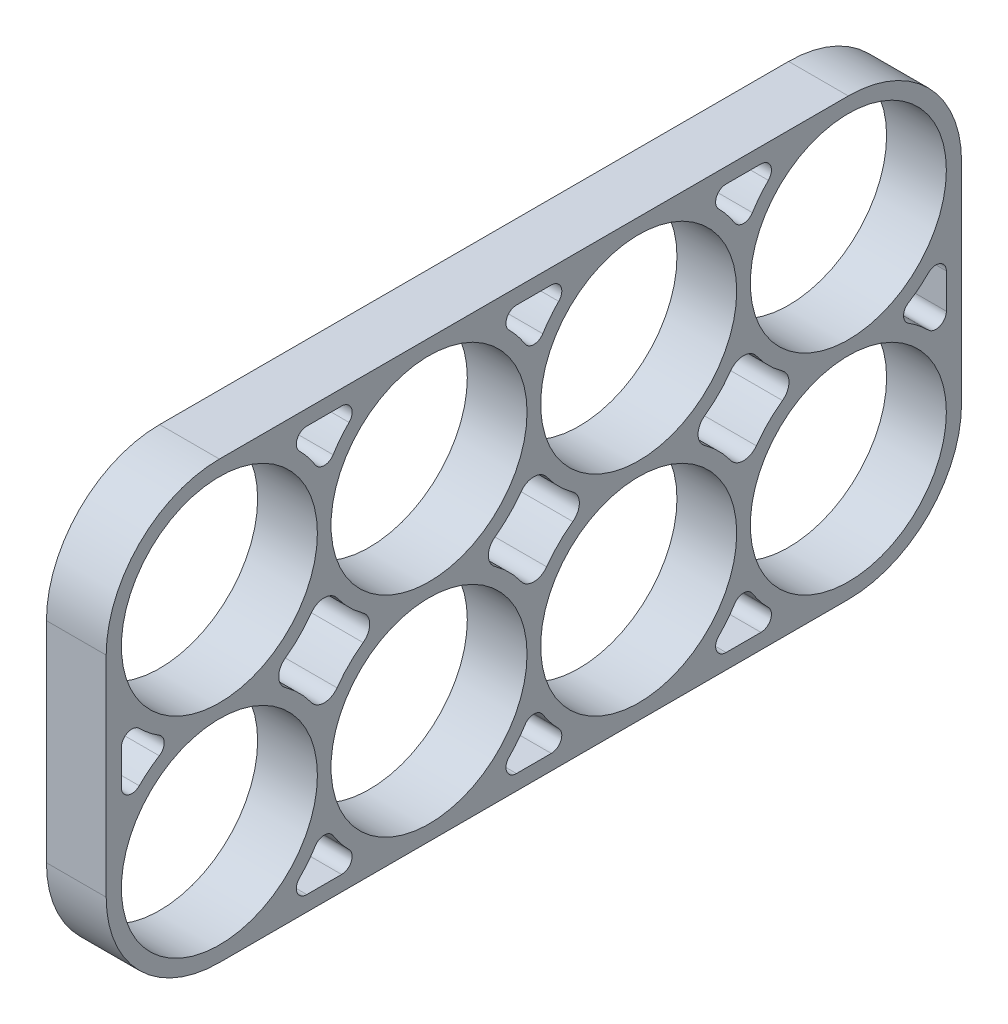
ISO-10303-21;
HEADER;
FILE_DESCRIPTION(('STEP AP214'),'2;1');
FILE_NAME('part.step','',(''),(''),'','','');
FILE_SCHEMA(('AUTOMOTIVE_DESIGN { 1 0 10303 214 1 1 1 1 }'));
ENDSEC;
DATA;
#1=APPLICATION_CONTEXT('core data for automotive mechanical design processes');
#2=APPLICATION_PROTOCOL_DEFINITION('international standard','automotive_design',2000,#1);
#3=PRODUCT_CONTEXT('',#1,'mechanical');
#4=PRODUCT('Part','Part','',(#3));
#5=PRODUCT_RELATED_PRODUCT_CATEGORY('part','',(#4));
#6=PRODUCT_DEFINITION_FORMATION('','',#4);
#7=PRODUCT_DEFINITION_CONTEXT('part definition',#1,'design');
#8=PRODUCT_DEFINITION('design','',#6,#7);
#9=PRODUCT_DEFINITION_SHAPE('','',#8);
#10=(LENGTH_UNIT() NAMED_UNIT(*) SI_UNIT(.MILLI.,.METRE.));
#11=(NAMED_UNIT(*) PLANE_ANGLE_UNIT() SI_UNIT($,.RADIAN.));
#12=(NAMED_UNIT(*) SI_UNIT($,.STERADIAN.) SOLID_ANGLE_UNIT());
#13=UNCERTAINTY_MEASURE_WITH_UNIT(LENGTH_MEASURE(1.E-05),#10,'distance_accuracy_value','');
#14=(GEOMETRIC_REPRESENTATION_CONTEXT(3) GLOBAL_UNCERTAINTY_ASSIGNED_CONTEXT((#13)) GLOBAL_UNIT_ASSIGNED_CONTEXT((#10,
#11,#12)) REPRESENTATION_CONTEXT('',''));
#15=CARTESIAN_POINT('',(0.,0.,0.));
#16=DIRECTION('',(0.,0.,1.));
#17=DIRECTION('',(1.,0.,0.));
#18=AXIS2_PLACEMENT_3D('',#15,#16,#17);
#19=CARTESIAN_POINT('',(5.7,-10.,30.));
#20=DIRECTION('',(1.,0.,0.));
#21=DIRECTION('',(0.,0.,-1.));
#22=AXIS2_PLACEMENT_3D('',#19,#20,#21);
#23=PLANE('',#22);
#24=CARTESIAN_POINT('',(5.7,-10.,10.));
#25=DIRECTION('',(1.,0.,0.));
#26=DIRECTION('',(0.,0.,-1.));
#27=AXIS2_PLACEMENT_3D('',#24,#25,#26);
#28=CIRCLE('',#27,9.35);
#29=CARTESIAN_POINT('',(5.7,-10.,0.650000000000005));
#30=VERTEX_POINT('',#29);
#31=EDGE_CURVE('E1085',#30,#30,#28,.T.);
#32=ORIENTED_EDGE('',*,*,#31,.F.);
#33=EDGE_LOOP('',(#32));
#34=FACE_BOUND('',#33,.T.);
#35=CARTESIAN_POINT('',(5.7,-10.,-30.));
#36=DIRECTION('',(1.,0.,0.));
#37=DIRECTION('',(0.,0.,-1.));
#38=AXIS2_PLACEMENT_3D('',#35,#36,#37);
#39=CIRCLE('',#38,9.35);
#40=CARTESIAN_POINT('',(5.7,-10.,-39.35));
#41=VERTEX_POINT('',#40);
#42=EDGE_CURVE('E1097',#41,#41,#39,.T.);
#43=ORIENTED_EDGE('',*,*,#42,.F.);
#44=EDGE_LOOP('',(#43));
#45=FACE_BOUND('',#44,.T.);
#46=CARTESIAN_POINT('',(5.7,10.,-10.));
#47=DIRECTION('',(1.,0.,0.));
#48=DIRECTION('',(0.,0.,-1.));
#49=AXIS2_PLACEMENT_3D('',#46,#47,#48);
#50=CIRCLE('',#49,9.35);
#51=CARTESIAN_POINT('',(5.7,10.,-19.35));
#52=VERTEX_POINT('',#51);
#53=EDGE_CURVE('E1109',#52,#52,#50,.T.);
#54=ORIENTED_EDGE('',*,*,#53,.F.);
#55=EDGE_LOOP('',(#54));
#56=FACE_BOUND('',#55,.T.);
#57=CARTESIAN_POINT('',(5.7,9.99999999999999,30.));
#58=DIRECTION('',(1.,0.,0.));
#59=DIRECTION('',(0.,0.,-1.));
#60=AXIS2_PLACEMENT_3D('',#57,#58,#59);
#61=CIRCLE('',#60,9.35);
#62=CARTESIAN_POINT('',(5.7,9.99999999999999,20.65));
#63=VERTEX_POINT('',#62);
#64=EDGE_CURVE('E1121',#63,#63,#61,.T.);
#65=ORIENTED_EDGE('',*,*,#64,.F.);
#66=EDGE_LOOP('',(#65));
#67=FACE_BOUND('',#66,.T.);
#68=CARTESIAN_POINT('',(5.7,-10.,30.));
#69=DIRECTION('',(1.,0.,0.));
#70=DIRECTION('',(0.,0.,-1.));
#71=AXIS2_PLACEMENT_3D('',#68,#69,#70);
#72=CIRCLE('',#71,10.8);
#73=CARTESIAN_POINT('',(5.7,-10.,40.8));
#74=VERTEX_POINT('',#73);
#75=CARTESIAN_POINT('',(5.7,-20.8,30.));
#76=VERTEX_POINT('',#75);
#77=EDGE_CURVE('E1127',#74,#76,#72,.T.);
#78=ORIENTED_EDGE('',*,*,#77,.T.);
#79=DIRECTION('',(0.,0.,-1.));
#80=VECTOR('',#79,1.);
#81=CARTESIAN_POINT('',(5.7,-20.8,30.));
#82=LINE('',#81,#80);
#83=CARTESIAN_POINT('',(5.7,-20.8,-30.));
#84=VERTEX_POINT('',#83);
#85=EDGE_CURVE('E1130',#76,#84,#82,.T.);
#86=ORIENTED_EDGE('',*,*,#85,.T.);
#87=CARTESIAN_POINT('',(5.7,-10.,-30.));
#88=DIRECTION('',(1.,0.,0.));
#89=DIRECTION('',(0.,0.,-1.));
#90=AXIS2_PLACEMENT_3D('',#87,#88,#89);
#91=CIRCLE('',#90,10.8);
#92=CARTESIAN_POINT('',(5.7,-10.,-40.8));
#93=VERTEX_POINT('',#92);
#94=EDGE_CURVE('E1133',#84,#93,#91,.T.);
#95=ORIENTED_EDGE('',*,*,#94,.T.);
#96=DIRECTION('',(0.,1.,0.));
#97=VECTOR('',#96,1.);
#98=CARTESIAN_POINT('',(5.7,10.,-40.8));
#99=LINE('',#98,#97);
#100=CARTESIAN_POINT('',(5.7,10.,-40.8));
#101=VERTEX_POINT('',#100);
#102=EDGE_CURVE('E1135',#93,#101,#99,.T.);
#103=ORIENTED_EDGE('',*,*,#102,.T.);
#104=CARTESIAN_POINT('',(5.7,10.,-30.));
#105=DIRECTION('',(1.,0.,0.));
#106=DIRECTION('',(0.,0.,-1.));
#107=AXIS2_PLACEMENT_3D('',#104,#105,#106);
#108=CIRCLE('',#107,10.8);
#109=CARTESIAN_POINT('',(5.7,20.8,-30.));
#110=VERTEX_POINT('',#109);
#111=EDGE_CURVE('E1137',#101,#110,#108,.T.);
#112=ORIENTED_EDGE('',*,*,#111,.T.);
#113=DIRECTION('',(0.,0.,1.));
#114=VECTOR('',#113,1.);
#115=CARTESIAN_POINT('',(5.7,20.8,30.));
#116=LINE('',#115,#114);
#117=CARTESIAN_POINT('',(5.7,20.8,30.));
#118=VERTEX_POINT('',#117);
#119=EDGE_CURVE('E1139',#110,#118,#116,.T.);
#120=ORIENTED_EDGE('',*,*,#119,.T.);
#121=CARTESIAN_POINT('',(5.7,9.99999999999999,30.));
#122=DIRECTION('',(1.,0.,0.));
#123=DIRECTION('',(0.,0.,-1.));
#124=AXIS2_PLACEMENT_3D('',#121,#122,#123);
#125=CIRCLE('',#124,10.8);
#126=CARTESIAN_POINT('',(5.7,10.,40.8));
#127=VERTEX_POINT('',#126);
#128=EDGE_CURVE('E1141',#118,#127,#125,.T.);
#129=ORIENTED_EDGE('',*,*,#128,.T.);
#130=DIRECTION('',(0.,-1.,0.));
#131=VECTOR('',#130,1.);
#132=CARTESIAN_POINT('',(5.7,-10.,40.8));
#133=LINE('',#132,#131);
#134=EDGE_CURVE('E1143',#127,#74,#133,.T.);
#135=ORIENTED_EDGE('',*,*,#134,.T.);
#136=EDGE_LOOP('',(#78,#86,#95,#103,#112,#120,#129,#135));
#137=FACE_BOUND('',#136,.T.);
#138=CARTESIAN_POINT('',(5.7,10.,10.));
#139=DIRECTION('',(1.,0.,0.));
#140=DIRECTION('',(0.,0.,-1.));
#141=AXIS2_PLACEMENT_3D('',#138,#139,#140);
#142=CIRCLE('',#141,9.35);
#143=CARTESIAN_POINT('',(5.7,10.,0.650000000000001));
#144=VERTEX_POINT('',#143);
#145=EDGE_CURVE('E1115',#144,#144,#142,.T.);
#146=ORIENTED_EDGE('',*,*,#145,.F.);
#147=EDGE_LOOP('',(#146));
#148=FACE_BOUND('',#147,.T.);
#149=CARTESIAN_POINT('',(5.7,10.,-30.));
#150=DIRECTION('',(1.,0.,0.));
#151=DIRECTION('',(0.,0.,-1.));
#152=AXIS2_PLACEMENT_3D('',#149,#150,#151);
#153=CIRCLE('',#152,9.35);
#154=CARTESIAN_POINT('',(5.7,10.,-39.35));
#155=VERTEX_POINT('',#154);
#156=EDGE_CURVE('E1103',#155,#155,#153,.T.);
#157=ORIENTED_EDGE('',*,*,#156,.F.);
#158=EDGE_LOOP('',(#157));
#159=FACE_BOUND('',#158,.T.);
#160=CARTESIAN_POINT('',(5.7,-10.,-10.));
#161=DIRECTION('',(1.,0.,0.));
#162=DIRECTION('',(0.,0.,-1.));
#163=AXIS2_PLACEMENT_3D('',#160,#161,#162);
#164=CIRCLE('',#163,9.35);
#165=CARTESIAN_POINT('',(5.7,-10.,-19.35));
#166=VERTEX_POINT('',#165);
#167=EDGE_CURVE('E1091',#166,#166,#164,.T.);
#168=ORIENTED_EDGE('',*,*,#167,.F.);
#169=EDGE_LOOP('',(#168));
#170=FACE_BOUND('',#169,.T.);
#171=CARTESIAN_POINT('',(5.7,-10.,30.));
#172=DIRECTION('',(1.,0.,0.));
#173=DIRECTION('',(0.,0.,-1.));
#174=AXIS2_PLACEMENT_3D('',#171,#172,#173);
#175=CIRCLE('',#174,9.35);
#176=CARTESIAN_POINT('',(5.7,-10.,20.65));
#177=VERTEX_POINT('',#176);
#178=EDGE_CURVE('E1079',#177,#177,#175,.T.);
#179=ORIENTED_EDGE('',*,*,#178,.F.);
#180=EDGE_LOOP('',(#179));
#181=FACE_BOUND('',#180,.T.);
#182=DIRECTION('',(0.,0.,-1.));
#183=VECTOR('',#182,1.);
#184=CARTESIAN_POINT('',(5.7,-19.35,18.337715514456));
#185=LINE('',#184,#183);
#186=CARTESIAN_POINT('',(5.7,-19.35,21.662284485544));
#187=VERTEX_POINT('',#186);
#188=CARTESIAN_POINT('',(5.7,-19.35,18.337715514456));
#189=VERTEX_POINT('',#188);
#190=EDGE_CURVE('E1036',#187,#189,#185,.T.);
#191=ORIENTED_EDGE('',*,*,#190,.F.);
#192=CARTESIAN_POINT('',(5.7,-18.35,21.662284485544));
#193=DIRECTION('',(1.,0.,0.));
#194=DIRECTION('',(0.,0.,1.));
#195=AXIS2_PLACEMENT_3D('',#192,#193,#194);
#196=CIRCLE('',#195,1.);
#197=CARTESIAN_POINT('',(5.7,-17.6423728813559,22.3688705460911));
#198=VERTEX_POINT('',#197);
#199=EDGE_CURVE('E1034',#198,#187,#196,.T.);
#200=ORIENTED_EDGE('',*,*,#199,.F.);
#201=CARTESIAN_POINT('',(5.7,-10.,30.));
#202=DIRECTION('',(-1.,0.,0.));
#203=DIRECTION('',(0.,0.,-1.));
#204=AXIS2_PLACEMENT_3D('',#201,#202,#203);
#205=CIRCLE('',#204,10.8);
#206=CARTESIAN_POINT('',(5.7,-15.7333208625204,20.8474576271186));
#207=VERTEX_POINT('',#206);
#208=EDGE_CURVE('E1046',#207,#198,#205,.T.);
#209=ORIENTED_EDGE('',*,*,#208,.F.);
#210=CARTESIAN_POINT('',(5.7,-16.2641839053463,20.));
#211=DIRECTION('',(1.,0.,0.));
#212=DIRECTION('',(0.,0.,-1.));
#213=AXIS2_PLACEMENT_3D('',#210,#211,#212);
#214=CIRCLE('',#213,1.);
#215=CARTESIAN_POINT('',(5.7,-15.7333208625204,19.1525423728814));
#216=VERTEX_POINT('',#215);
#217=EDGE_CURVE('E1043',#216,#207,#214,.T.);
#218=ORIENTED_EDGE('',*,*,#217,.F.);
#219=CARTESIAN_POINT('',(5.7,-10.,10.));
#220=DIRECTION('',(-1.,0.,0.));
#221=DIRECTION('',(0.,0.,-1.));
#222=AXIS2_PLACEMENT_3D('',#219,#220,#221);
#223=CIRCLE('',#222,10.8);
#224=CARTESIAN_POINT('',(5.7,-17.6423728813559,17.6311294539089));
#225=VERTEX_POINT('',#224);
#226=EDGE_CURVE('E1041',#225,#216,#223,.T.);
#227=ORIENTED_EDGE('',*,*,#226,.F.);
#228=CARTESIAN_POINT('',(5.7,-18.35,18.337715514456));
#229=DIRECTION('',(1.,0.,0.));
#230=DIRECTION('',(0.,0.,-1.));
#231=AXIS2_PLACEMENT_3D('',#228,#229,#230);
#232=CIRCLE('',#231,1.);
#233=EDGE_CURVE('E1039',#189,#225,#232,.T.);
#234=ORIENTED_EDGE('',*,*,#233,.F.);
#235=EDGE_LOOP('',(#191,#200,#209,#218,#227,#234));
#236=FACE_BOUND('',#235,.T.);
#237=DIRECTION('',(0.,0.,-1.));
#238=VECTOR('',#237,1.);
#239=CARTESIAN_POINT('',(5.7,-19.35,-1.66228448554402));
#240=LINE('',#239,#238);
#241=CARTESIAN_POINT('',(5.7,-19.35,1.66228448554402));
#242=VERTEX_POINT('',#241);
#243=CARTESIAN_POINT('',(5.7,-19.35,-1.66228448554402));
#244=VERTEX_POINT('',#243);
#245=EDGE_CURVE('E991',#242,#244,#240,.T.);
#246=ORIENTED_EDGE('',*,*,#245,.F.);
#247=CARTESIAN_POINT('',(5.7,-18.35,1.66228448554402));
#248=DIRECTION('',(1.,0.,0.));
#249=DIRECTION('',(0.,0.,1.));
#250=AXIS2_PLACEMENT_3D('',#247,#248,#249);
#251=CIRCLE('',#250,1.);
#252=CARTESIAN_POINT('',(5.7,-17.6423728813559,2.36887054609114));
#253=VERTEX_POINT('',#252);
#254=EDGE_CURVE('E989',#253,#242,#251,.T.);
#255=ORIENTED_EDGE('',*,*,#254,.F.);
#256=CARTESIAN_POINT('',(5.7,-10.,10.));
#257=DIRECTION('',(-1.,0.,0.));
#258=DIRECTION('',(0.,0.,-1.));
#259=AXIS2_PLACEMENT_3D('',#256,#257,#258);
#260=CIRCLE('',#259,10.8);
#261=CARTESIAN_POINT('',(5.7,-15.7333208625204,0.847457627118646));
#262=VERTEX_POINT('',#261);
#263=EDGE_CURVE('E1001',#262,#253,#260,.T.);
#264=ORIENTED_EDGE('',*,*,#263,.F.);
#265=CARTESIAN_POINT('',(5.7,-16.2641839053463,0.));
#266=DIRECTION('',(1.,0.,0.));
#267=DIRECTION('',(0.,0.,-1.));
#268=AXIS2_PLACEMENT_3D('',#265,#266,#267);
#269=CIRCLE('',#268,0.999999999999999);
#270=CARTESIAN_POINT('',(5.7,-15.7333208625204,-0.847457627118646));
#271=VERTEX_POINT('',#270);
#272=EDGE_CURVE('E998',#271,#262,#269,.T.);
#273=ORIENTED_EDGE('',*,*,#272,.F.);
#274=CARTESIAN_POINT('',(5.7,-10.,-10.));
#275=DIRECTION('',(-1.,0.,0.));
#276=DIRECTION('',(0.,0.,-1.));
#277=AXIS2_PLACEMENT_3D('',#274,#275,#276);
#278=CIRCLE('',#277,10.8);
#279=CARTESIAN_POINT('',(5.7,-17.6423728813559,-2.36887054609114));
#280=VERTEX_POINT('',#279);
#281=EDGE_CURVE('E996',#280,#271,#278,.T.);
#282=ORIENTED_EDGE('',*,*,#281,.F.);
#283=CARTESIAN_POINT('',(5.7,-18.35,-1.66228448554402));
#284=DIRECTION('',(1.,0.,0.));
#285=DIRECTION('',(0.,0.,-1.));
#286=AXIS2_PLACEMENT_3D('',#283,#284,#285);
#287=CIRCLE('',#286,1.);
#288=EDGE_CURVE('E994',#244,#280,#287,.T.);
#289=ORIENTED_EDGE('',*,*,#288,.F.);
#290=EDGE_LOOP('',(#246,#255,#264,#273,#282,#289));
#291=FACE_BOUND('',#290,.T.);
#292=CARTESIAN_POINT('',(5.7,-10.,-30.));
#293=DIRECTION('',(-1.,0.,0.));
#294=DIRECTION('',(0.,0.,-1.));
#295=AXIS2_PLACEMENT_3D('',#292,#293,#294);
#296=CIRCLE('',#295,10.8);
#297=CARTESIAN_POINT('',(5.7,-17.6423728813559,-22.3688705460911));
#298=VERTEX_POINT('',#297);
#299=CARTESIAN_POINT('',(5.7,-15.7333208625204,-20.8474576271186));
#300=VERTEX_POINT('',#299);
#301=EDGE_CURVE('E946',#298,#300,#296,.T.);
#302=ORIENTED_EDGE('',*,*,#301,.F.);
#303=CARTESIAN_POINT('',(5.7,-18.35,-21.662284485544));
#304=DIRECTION('',(1.,0.,0.));
#305=DIRECTION('',(0.,0.,-1.));
#306=AXIS2_PLACEMENT_3D('',#303,#304,#305);
#307=CIRCLE('',#306,1.);
#308=CARTESIAN_POINT('',(5.7,-19.35,-21.662284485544));
#309=VERTEX_POINT('',#308);
#310=EDGE_CURVE('E944',#309,#298,#307,.T.);
#311=ORIENTED_EDGE('',*,*,#310,.F.);
#312=DIRECTION('',(0.,0.,-1.));
#313=VECTOR('',#312,1.);
#314=CARTESIAN_POINT('',(5.7,-19.35,-21.662284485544));
#315=LINE('',#314,#313);
#316=CARTESIAN_POINT('',(5.7,-19.35,-18.337715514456));
#317=VERTEX_POINT('',#316);
#318=EDGE_CURVE('E956',#317,#309,#315,.T.);
#319=ORIENTED_EDGE('',*,*,#318,.F.);
#320=CARTESIAN_POINT('',(5.7,-18.35,-18.337715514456));
#321=DIRECTION('',(1.,0.,0.));
#322=DIRECTION('',(0.,0.,1.));
#323=AXIS2_PLACEMENT_3D('',#320,#321,#322);
#324=CIRCLE('',#323,1.);
#325=CARTESIAN_POINT('',(5.7,-17.6423728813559,-17.6311294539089));
#326=VERTEX_POINT('',#325);
#327=EDGE_CURVE('E953',#326,#317,#324,.T.);
#328=ORIENTED_EDGE('',*,*,#327,.F.);
#329=CARTESIAN_POINT('',(5.7,-10.,-10.));
#330=DIRECTION('',(-1.,0.,0.));
#331=DIRECTION('',(0.,0.,-1.));
#332=AXIS2_PLACEMENT_3D('',#329,#330,#331);
#333=CIRCLE('',#332,10.8);
#334=CARTESIAN_POINT('',(5.7,-15.7333208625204,-19.1525423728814));
#335=VERTEX_POINT('',#334);
#336=EDGE_CURVE('E951',#335,#326,#333,.T.);
#337=ORIENTED_EDGE('',*,*,#336,.F.);
#338=CARTESIAN_POINT('',(5.7,-16.2641839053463,-20.));
#339=DIRECTION('',(1.,0.,0.));
#340=DIRECTION('',(0.,0.,1.));
#341=AXIS2_PLACEMENT_3D('',#338,#339,#340);
#342=CIRCLE('',#341,0.999999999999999);
#343=EDGE_CURVE('E949',#300,#335,#342,.T.);
#344=ORIENTED_EDGE('',*,*,#343,.F.);
#345=EDGE_LOOP('',(#302,#311,#319,#328,#337,#344));
#346=FACE_BOUND('',#345,.T.);
#347=CARTESIAN_POINT('',(5.7,10.,-30.));
#348=DIRECTION('',(-1.,0.,0.));
#349=DIRECTION('',(0.,0.,-1.));
#350=AXIS2_PLACEMENT_3D('',#347,#348,#349);
#351=CIRCLE('',#350,10.8);
#352=CARTESIAN_POINT('',(5.7,15.7333208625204,-20.8474576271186));
#353=VERTEX_POINT('',#352);
#354=CARTESIAN_POINT('',(5.7,17.6423728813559,-22.3688705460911));
#355=VERTEX_POINT('',#354);
#356=EDGE_CURVE('E901',#353,#355,#351,.T.);
#357=ORIENTED_EDGE('',*,*,#356,.F.);
#358=CARTESIAN_POINT('',(5.7,16.2641839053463,-20.));
#359=DIRECTION('',(1.,0.,0.));
#360=DIRECTION('',(0.,0.,-1.));
#361=AXIS2_PLACEMENT_3D('',#358,#359,#360);
#362=CIRCLE('',#361,1.);
#363=CARTESIAN_POINT('',(5.7,15.7333208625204,-19.1525423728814));
#364=VERTEX_POINT('',#363);
#365=EDGE_CURVE('E899',#364,#353,#362,.T.);
#366=ORIENTED_EDGE('',*,*,#365,.F.);
#367=CARTESIAN_POINT('',(5.7,10.,-10.));
#368=DIRECTION('',(-1.,0.,0.));
#369=DIRECTION('',(0.,0.,-1.));
#370=AXIS2_PLACEMENT_3D('',#367,#368,#369);
#371=CIRCLE('',#370,10.8);
#372=CARTESIAN_POINT('',(5.7,17.6423728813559,-17.6311294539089));
#373=VERTEX_POINT('',#372);
#374=EDGE_CURVE('E911',#373,#364,#371,.T.);
#375=ORIENTED_EDGE('',*,*,#374,.F.);
#376=CARTESIAN_POINT('',(5.7,18.35,-18.337715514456));
#377=DIRECTION('',(1.,0.,0.));
#378=DIRECTION('',(0.,0.,1.));
#379=AXIS2_PLACEMENT_3D('',#376,#377,#378);
#380=CIRCLE('',#379,1.);
#381=CARTESIAN_POINT('',(5.7,19.35,-18.337715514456));
#382=VERTEX_POINT('',#381);
#383=EDGE_CURVE('E908',#382,#373,#380,.T.);
#384=ORIENTED_EDGE('',*,*,#383,.F.);
#385=DIRECTION('',(0.,0.,1.));
#386=VECTOR('',#385,1.);
#387=CARTESIAN_POINT('',(5.7,19.35,-18.337715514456));
#388=LINE('',#387,#386);
#389=CARTESIAN_POINT('',(5.7,19.35,-21.662284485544));
#390=VERTEX_POINT('',#389);
#391=EDGE_CURVE('E906',#390,#382,#388,.T.);
#392=ORIENTED_EDGE('',*,*,#391,.F.);
#393=CARTESIAN_POINT('',(5.7,18.35,-21.662284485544));
#394=DIRECTION('',(1.,0.,0.));
#395=DIRECTION('',(0.,0.,-1.));
#396=AXIS2_PLACEMENT_3D('',#393,#394,#395);
#397=CIRCLE('',#396,1.);
#398=EDGE_CURVE('E904',#355,#390,#397,.T.);
#399=ORIENTED_EDGE('',*,*,#398,.F.);
#400=EDGE_LOOP('',(#357,#366,#375,#384,#392,#399));
#401=FACE_BOUND('',#400,.T.);
#402=CARTESIAN_POINT('',(5.7,10.,-10.));
#403=DIRECTION('',(-1.,0.,0.));
#404=DIRECTION('',(0.,0.,-1.));
#405=AXIS2_PLACEMENT_3D('',#402,#403,#404);
#406=CIRCLE('',#405,10.8);
#407=CARTESIAN_POINT('',(5.7,15.7333208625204,-0.847457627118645));
#408=VERTEX_POINT('',#407);
#409=CARTESIAN_POINT('',(5.7,17.6423728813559,-2.36887054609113));
#410=VERTEX_POINT('',#409);
#411=EDGE_CURVE('E856',#408,#410,#406,.T.);
#412=ORIENTED_EDGE('',*,*,#411,.F.);
#413=CARTESIAN_POINT('',(5.7,16.2641839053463,0.));
#414=DIRECTION('',(1.,0.,0.));
#415=DIRECTION('',(0.,0.,-1.));
#416=AXIS2_PLACEMENT_3D('',#413,#414,#415);
#417=CIRCLE('',#416,0.999999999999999);
#418=CARTESIAN_POINT('',(5.7,15.7333208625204,0.847457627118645));
#419=VERTEX_POINT('',#418);
#420=EDGE_CURVE('E854',#419,#408,#417,.T.);
#421=ORIENTED_EDGE('',*,*,#420,.F.);
#422=CARTESIAN_POINT('',(5.7,10.,10.));
#423=DIRECTION('',(-1.,0.,0.));
#424=DIRECTION('',(0.,0.,-1.));
#425=AXIS2_PLACEMENT_3D('',#422,#423,#424);
#426=CIRCLE('',#425,10.8);
#427=CARTESIAN_POINT('',(5.7,17.6423728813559,2.36887054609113));
#428=VERTEX_POINT('',#427);
#429=EDGE_CURVE('E866',#428,#419,#426,.T.);
#430=ORIENTED_EDGE('',*,*,#429,.F.);
#431=CARTESIAN_POINT('',(5.7,18.35,1.66228448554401));
#432=DIRECTION('',(1.,0.,0.));
#433=DIRECTION('',(0.,0.,-1.));
#434=AXIS2_PLACEMENT_3D('',#431,#432,#433);
#435=CIRCLE('',#434,1.);
#436=CARTESIAN_POINT('',(5.7,19.35,1.66228448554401));
#437=VERTEX_POINT('',#436);
#438=EDGE_CURVE('E863',#437,#428,#435,.T.);
#439=ORIENTED_EDGE('',*,*,#438,.F.);
#440=DIRECTION('',(0.,0.,1.));
#441=VECTOR('',#440,1.);
#442=CARTESIAN_POINT('',(5.7,19.35,1.66228448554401));
#443=LINE('',#442,#441);
#444=CARTESIAN_POINT('',(5.7,19.35,-1.66228448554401));
#445=VERTEX_POINT('',#444);
#446=EDGE_CURVE('E861',#445,#437,#443,.T.);
#447=ORIENTED_EDGE('',*,*,#446,.F.);
#448=CARTESIAN_POINT('',(5.7,18.35,-1.66228448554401));
#449=DIRECTION('',(1.,0.,0.));
#450=DIRECTION('',(0.,0.,-1.));
#451=AXIS2_PLACEMENT_3D('',#448,#449,#450);
#452=CIRCLE('',#451,1.);
#453=EDGE_CURVE('E859',#410,#445,#452,.T.);
#454=ORIENTED_EDGE('',*,*,#453,.F.);
#455=EDGE_LOOP('',(#412,#421,#430,#439,#447,#454));
#456=FACE_BOUND('',#455,.T.);
#457=DIRECTION('',(0.,0.,1.));
#458=VECTOR('',#457,1.);
#459=CARTESIAN_POINT('',(5.7,19.35,21.662284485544));
#460=LINE('',#459,#458);
#461=CARTESIAN_POINT('',(5.7,19.35,18.337715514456));
#462=VERTEX_POINT('',#461);
#463=CARTESIAN_POINT('',(5.7,19.35,21.662284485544));
#464=VERTEX_POINT('',#463);
#465=EDGE_CURVE('E811',#462,#464,#460,.T.);
#466=ORIENTED_EDGE('',*,*,#465,.F.);
#467=CARTESIAN_POINT('',(5.7,18.35,18.337715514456));
#468=DIRECTION('',(1.,0.,0.));
#469=DIRECTION('',(0.,0.,-1.));
#470=AXIS2_PLACEMENT_3D('',#467,#468,#469);
#471=CIRCLE('',#470,1.);
#472=CARTESIAN_POINT('',(5.7,17.6423728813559,17.6311294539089));
#473=VERTEX_POINT('',#472);
#474=EDGE_CURVE('E809',#473,#462,#471,.T.);
#475=ORIENTED_EDGE('',*,*,#474,.F.);
#476=CARTESIAN_POINT('',(5.7,10.,10.));
#477=DIRECTION('',(-1.,0.,0.));
#478=DIRECTION('',(0.,0.,-1.));
#479=AXIS2_PLACEMENT_3D('',#476,#477,#478);
#480=CIRCLE('',#479,10.8);
#481=CARTESIAN_POINT('',(5.7,15.7333208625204,19.1525423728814));
#482=VERTEX_POINT('',#481);
#483=EDGE_CURVE('E821',#482,#473,#480,.T.);
#484=ORIENTED_EDGE('',*,*,#483,.F.);
#485=CARTESIAN_POINT('',(5.7,16.2641839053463,20.));
#486=DIRECTION('',(1.,0.,0.));
#487=DIRECTION('',(0.,0.,-1.));
#488=AXIS2_PLACEMENT_3D('',#485,#486,#487);
#489=CIRCLE('',#488,1.);
#490=CARTESIAN_POINT('',(5.7,15.7333208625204,20.8474576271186));
#491=VERTEX_POINT('',#490);
#492=EDGE_CURVE('E818',#491,#482,#489,.T.);
#493=ORIENTED_EDGE('',*,*,#492,.F.);
#494=CARTESIAN_POINT('',(5.7,9.99999999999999,30.));
#495=DIRECTION('',(-1.,0.,0.));
#496=DIRECTION('',(0.,0.,-1.));
#497=AXIS2_PLACEMENT_3D('',#494,#495,#496);
#498=CIRCLE('',#497,10.8);
#499=CARTESIAN_POINT('',(5.7,17.6423728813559,22.3688705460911));
#500=VERTEX_POINT('',#499);
#501=EDGE_CURVE('E816',#500,#491,#498,.T.);
#502=ORIENTED_EDGE('',*,*,#501,.F.);
#503=CARTESIAN_POINT('',(5.7,18.35,21.662284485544));
#504=DIRECTION('',(1.,0.,0.));
#505=DIRECTION('',(0.,0.,-1.));
#506=AXIS2_PLACEMENT_3D('',#503,#504,#505);
#507=CIRCLE('',#506,1.);
#508=EDGE_CURVE('E814',#464,#500,#507,.T.);
#509=ORIENTED_EDGE('',*,*,#508,.F.);
#510=EDGE_LOOP('',(#466,#475,#484,#493,#502,#509));
#511=FACE_BOUND('',#510,.T.);
#512=CARTESIAN_POINT('',(5.7,-10.,-30.));
#513=DIRECTION('',(-1.,0.,0.));
#514=DIRECTION('',(0.,0.,-1.));
#515=AXIS2_PLACEMENT_3D('',#512,#513,#514);
#516=CIRCLE('',#515,10.8);
#517=CARTESIAN_POINT('',(5.7,-0.847457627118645,-35.7333208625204));
#518=VERTEX_POINT('',#517);
#519=CARTESIAN_POINT('',(5.7,-2.36887054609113,-37.6423728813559));
#520=VERTEX_POINT('',#519);
#521=EDGE_CURVE('E766',#518,#520,#516,.T.);
#522=ORIENTED_EDGE('',*,*,#521,.F.);
#523=CARTESIAN_POINT('',(5.7,0.,-36.2641839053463));
#524=DIRECTION('',(1.,0.,0.));
#525=DIRECTION('',(0.,0.,1.));
#526=AXIS2_PLACEMENT_3D('',#523,#524,#525);
#527=CIRCLE('',#526,0.999999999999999);
#528=CARTESIAN_POINT('',(5.7,0.847457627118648,-35.7333208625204));
#529=VERTEX_POINT('',#528);
#530=EDGE_CURVE('E764',#529,#518,#527,.T.);
#531=ORIENTED_EDGE('',*,*,#530,.F.);
#532=CARTESIAN_POINT('',(5.7,10.,-30.));
#533=DIRECTION('',(-1.,0.,0.));
#534=DIRECTION('',(0.,0.,-1.));
#535=AXIS2_PLACEMENT_3D('',#532,#533,#534);
#536=CIRCLE('',#535,10.8);
#537=CARTESIAN_POINT('',(5.7,2.36887054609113,-37.6423728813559));
#538=VERTEX_POINT('',#537);
#539=EDGE_CURVE('E776',#538,#529,#536,.T.);
#540=ORIENTED_EDGE('',*,*,#539,.F.);
#541=CARTESIAN_POINT('',(5.7,1.66228448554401,-38.35));
#542=DIRECTION('',(1.,0.,0.));
#543=DIRECTION('',(0.,0.,-1.));
#544=AXIS2_PLACEMENT_3D('',#541,#542,#543);
#545=CIRCLE('',#544,1.);
#546=CARTESIAN_POINT('',(5.7,1.66228448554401,-39.35));
#547=VERTEX_POINT('',#546);
#548=EDGE_CURVE('E773',#547,#538,#545,.T.);
#549=ORIENTED_EDGE('',*,*,#548,.F.);
#550=DIRECTION('',(0.,1.,0.));
#551=VECTOR('',#550,1.);
#552=CARTESIAN_POINT('',(5.7,-1.66228448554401,-39.35));
#553=LINE('',#552,#551);
#554=CARTESIAN_POINT('',(5.7,-1.66228448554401,-39.35));
#555=VERTEX_POINT('',#554);
#556=EDGE_CURVE('E771',#555,#547,#553,.T.);
#557=ORIENTED_EDGE('',*,*,#556,.F.);
#558=CARTESIAN_POINT('',(5.7,-1.66228448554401,-38.35));
#559=DIRECTION('',(1.,0.,0.));
#560=DIRECTION('',(0.,0.,-1.));
#561=AXIS2_PLACEMENT_3D('',#558,#559,#560);
#562=CIRCLE('',#561,1.);
#563=EDGE_CURVE('E769',#520,#555,#562,.T.);
#564=ORIENTED_EDGE('',*,*,#563,.F.);
#565=EDGE_LOOP('',(#522,#531,#540,#549,#557,#564));
#566=FACE_BOUND('',#565,.T.);
#567=CARTESIAN_POINT('',(5.7,9.99999999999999,30.));
#568=DIRECTION('',(-1.,0.,0.));
#569=DIRECTION('',(0.,0.,-1.));
#570=AXIS2_PLACEMENT_3D('',#567,#568,#569);
#571=CIRCLE('',#570,10.8);
#572=CARTESIAN_POINT('',(5.7,0.847457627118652,35.7333208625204));
#573=VERTEX_POINT('',#572);
#574=CARTESIAN_POINT('',(5.7,2.36887054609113,37.6423728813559));
#575=VERTEX_POINT('',#574);
#576=EDGE_CURVE('E721',#573,#575,#571,.T.);
#577=ORIENTED_EDGE('',*,*,#576,.F.);
#578=CARTESIAN_POINT('',(5.7,0.,36.2641839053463));
#579=DIRECTION('',(1.,0.,0.));
#580=DIRECTION('',(0.,0.,-1.));
#581=AXIS2_PLACEMENT_3D('',#578,#579,#580);
#582=CIRCLE('',#581,1.);
#583=CARTESIAN_POINT('',(5.7,-0.847457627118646,35.7333208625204));
#584=VERTEX_POINT('',#583);
#585=EDGE_CURVE('E719',#584,#573,#582,.T.);
#586=ORIENTED_EDGE('',*,*,#585,.F.);
#587=CARTESIAN_POINT('',(5.7,-10.,30.));
#588=DIRECTION('',(-1.,0.,0.));
#589=DIRECTION('',(0.,0.,-1.));
#590=AXIS2_PLACEMENT_3D('',#587,#588,#589);
#591=CIRCLE('',#590,10.8);
#592=CARTESIAN_POINT('',(5.7,-2.36887054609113,37.6423728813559));
#593=VERTEX_POINT('',#592);
#594=EDGE_CURVE('E731',#593,#584,#591,.T.);
#595=ORIENTED_EDGE('',*,*,#594,.F.);
#596=CARTESIAN_POINT('',(5.7,-1.66228448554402,38.35));
#597=DIRECTION('',(1.,0.,0.));
#598=DIRECTION('',(0.,0.,1.));
#599=AXIS2_PLACEMENT_3D('',#596,#597,#598);
#600=CIRCLE('',#599,1.);
#601=CARTESIAN_POINT('',(5.7,-1.66228448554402,39.35));
#602=VERTEX_POINT('',#601);
#603=EDGE_CURVE('E728',#602,#593,#600,.T.);
#604=ORIENTED_EDGE('',*,*,#603,.F.);
#605=DIRECTION('',(0.,-1.,0.));
#606=VECTOR('',#605,1.);
#607=CARTESIAN_POINT('',(5.7,1.66228448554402,39.35));
#608=LINE('',#607,#606);
#609=CARTESIAN_POINT('',(5.7,1.66228448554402,39.35));
#610=VERTEX_POINT('',#609);
#611=EDGE_CURVE('E726',#610,#602,#608,.T.);
#612=ORIENTED_EDGE('',*,*,#611,.F.);
#613=CARTESIAN_POINT('',(5.7,1.66228448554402,38.35));
#614=DIRECTION('',(1.,0.,0.));
#615=DIRECTION('',(0.,0.,1.));
#616=AXIS2_PLACEMENT_3D('',#613,#614,#615);
#617=CIRCLE('',#616,1.);
#618=EDGE_CURVE('E724',#575,#610,#617,.T.);
#619=ORIENTED_EDGE('',*,*,#618,.F.);
#620=EDGE_LOOP('',(#577,#586,#595,#604,#612,#619));
#621=FACE_BOUND('',#620,.T.);
#622=CARTESIAN_POINT('',(5.7,-10.,-30.));
#623=DIRECTION('',(-1.,0.,0.));
#624=DIRECTION('',(0.,0.,-1.));
#625=AXIS2_PLACEMENT_3D('',#622,#623,#624);
#626=CIRCLE('',#625,10.8);
#627=CARTESIAN_POINT('',(5.7,-3.711674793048,-21.219512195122));
#628=VERTEX_POINT('',#627);
#629=CARTESIAN_POINT('',(5.7,-1.21951219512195,-23.711674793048));
#630=VERTEX_POINT('',#629);
#631=EDGE_CURVE('E662',#628,#630,#626,.T.);
#632=ORIENTED_EDGE('',*,*,#631,.F.);
#633=CARTESIAN_POINT('',(5.7,-2.83829629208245,-20.));
#634=DIRECTION('',(1.,0.,0.));
#635=DIRECTION('',(0.,0.,-1.));
#636=AXIS2_PLACEMENT_3D('',#633,#634,#635);
#637=CIRCLE('',#636,1.5);
#638=CARTESIAN_POINT('',(5.7,-3.711674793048,-18.780487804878));
#639=VERTEX_POINT('',#638);
#640=EDGE_CURVE('E660',#639,#628,#637,.T.);
#641=ORIENTED_EDGE('',*,*,#640,.F.);
#642=CARTESIAN_POINT('',(5.7,-10.,-10.));
#643=DIRECTION('',(-1.,0.,0.));
#644=DIRECTION('',(0.,0.,-1.));
#645=AXIS2_PLACEMENT_3D('',#642,#643,#644);
#646=CIRCLE('',#645,10.8);
#647=CARTESIAN_POINT('',(5.7,-1.21951219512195,-16.288325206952));
#648=VERTEX_POINT('',#647);
#649=EDGE_CURVE('E676',#648,#639,#646,.T.);
#650=ORIENTED_EDGE('',*,*,#649,.F.);
#651=CARTESIAN_POINT('',(5.7,0.,-17.1617037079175));
#652=DIRECTION('',(1.,0.,0.));
#653=DIRECTION('',(0.,0.,1.));
#654=AXIS2_PLACEMENT_3D('',#651,#652,#653);
#655=CIRCLE('',#654,1.5);
#656=CARTESIAN_POINT('',(5.7,1.21951219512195,-16.288325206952));
#657=VERTEX_POINT('',#656);
#658=EDGE_CURVE('E673',#657,#648,#655,.T.);
#659=ORIENTED_EDGE('',*,*,#658,.F.);
#660=CARTESIAN_POINT('',(5.7,10.,-10.));
#661=DIRECTION('',(-1.,0.,0.));
#662=DIRECTION('',(0.,0.,-1.));
#663=AXIS2_PLACEMENT_3D('',#660,#661,#662);
#664=CIRCLE('',#663,10.8);
#665=CARTESIAN_POINT('',(5.7,3.711674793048,-18.780487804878));
#666=VERTEX_POINT('',#665);
#667=EDGE_CURVE('E671',#666,#657,#664,.T.);
#668=ORIENTED_EDGE('',*,*,#667,.F.);
#669=CARTESIAN_POINT('',(5.7,2.83829629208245,-20.));
#670=DIRECTION('',(1.,0.,0.));
#671=DIRECTION('',(0.,0.,-1.));
#672=AXIS2_PLACEMENT_3D('',#669,#670,#671);
#673=CIRCLE('',#672,1.5);
#674=CARTESIAN_POINT('',(5.7,3.711674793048,-21.219512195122));
#675=VERTEX_POINT('',#674);
#676=EDGE_CURVE('E669',#675,#666,#673,.T.);
#677=ORIENTED_EDGE('',*,*,#676,.F.);
#678=CARTESIAN_POINT('',(5.7,10.,-30.));
#679=DIRECTION('',(-1.,0.,0.));
#680=DIRECTION('',(0.,0.,-1.));
#681=AXIS2_PLACEMENT_3D('',#678,#679,#680);
#682=CIRCLE('',#681,10.8);
#683=CARTESIAN_POINT('',(5.7,1.21951219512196,-23.711674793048));
#684=VERTEX_POINT('',#683);
#685=EDGE_CURVE('E667',#684,#675,#682,.T.);
#686=ORIENTED_EDGE('',*,*,#685,.F.);
#687=CARTESIAN_POINT('',(5.7,0.,-22.8382962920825));
#688=DIRECTION('',(1.,0.,0.));
#689=DIRECTION('',(0.,0.,-1.));
#690=AXIS2_PLACEMENT_3D('',#687,#688,#689);
#691=CIRCLE('',#690,1.5);
#692=EDGE_CURVE('E665',#630,#684,#691,.T.);
#693=ORIENTED_EDGE('',*,*,#692,.F.);
#694=EDGE_LOOP('',(#632,#641,#650,#659,#668,#677,#686,#693));
#695=FACE_BOUND('',#694,.T.);
#696=CARTESIAN_POINT('',(5.7,-10.,10.));
#697=DIRECTION('',(-1.,0.,0.));
#698=DIRECTION('',(0.,0.,-1.));
#699=AXIS2_PLACEMENT_3D('',#696,#697,#698);
#700=CIRCLE('',#699,10.8);
#701=CARTESIAN_POINT('',(5.7,-1.21951219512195,3.711674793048));
#702=VERTEX_POINT('',#701);
#703=CARTESIAN_POINT('',(5.7,-3.711674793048,1.21951219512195));
#704=VERTEX_POINT('',#703);
#705=EDGE_CURVE('E603',#702,#704,#700,.T.);
#706=ORIENTED_EDGE('',*,*,#705,.F.);
#707=CARTESIAN_POINT('',(5.7,0.,2.83829629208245));
#708=DIRECTION('',(1.,0.,0.));
#709=DIRECTION('',(0.,0.,1.));
#710=AXIS2_PLACEMENT_3D('',#707,#708,#709);
#711=CIRCLE('',#710,1.5);
#712=CARTESIAN_POINT('',(5.7,1.21951219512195,3.711674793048));
#713=VERTEX_POINT('',#712);
#714=EDGE_CURVE('E601',#713,#702,#711,.T.);
#715=ORIENTED_EDGE('',*,*,#714,.F.);
#716=CARTESIAN_POINT('',(5.7,10.,10.));
#717=DIRECTION('',(-1.,0.,0.));
#718=DIRECTION('',(0.,0.,-1.));
#719=AXIS2_PLACEMENT_3D('',#716,#717,#718);
#720=CIRCLE('',#719,10.8);
#721=CARTESIAN_POINT('',(5.7,3.711674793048,1.21951219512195));
#722=VERTEX_POINT('',#721);
#723=EDGE_CURVE('E617',#722,#713,#720,.T.);
#724=ORIENTED_EDGE('',*,*,#723,.F.);
#725=CARTESIAN_POINT('',(5.7,2.83829629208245,0.));
#726=DIRECTION('',(1.,0.,0.));
#727=DIRECTION('',(0.,0.,-1.));
#728=AXIS2_PLACEMENT_3D('',#725,#726,#727);
#729=CIRCLE('',#728,1.5);
#730=CARTESIAN_POINT('',(5.7,3.71167479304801,-1.21951219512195));
#731=VERTEX_POINT('',#730);
#732=EDGE_CURVE('E614',#731,#722,#729,.T.);
#733=ORIENTED_EDGE('',*,*,#732,.F.);
#734=CARTESIAN_POINT('',(5.7,10.,-10.));
#735=DIRECTION('',(-1.,0.,0.));
#736=DIRECTION('',(0.,0.,-1.));
#737=AXIS2_PLACEMENT_3D('',#734,#735,#736);
#738=CIRCLE('',#737,10.8);
#739=CARTESIAN_POINT('',(5.7,1.21951219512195,-3.711674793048));
#740=VERTEX_POINT('',#739);
#741=EDGE_CURVE('E612',#740,#731,#738,.T.);
#742=ORIENTED_EDGE('',*,*,#741,.F.);
#743=CARTESIAN_POINT('',(5.7,0.,-2.83829629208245));
#744=DIRECTION('',(1.,0.,0.));
#745=DIRECTION('',(0.,0.,-1.));
#746=AXIS2_PLACEMENT_3D('',#743,#744,#745);
#747=CIRCLE('',#746,1.5);
#748=CARTESIAN_POINT('',(5.7,-1.21951219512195,-3.711674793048));
#749=VERTEX_POINT('',#748);
#750=EDGE_CURVE('E610',#749,#740,#747,.T.);
#751=ORIENTED_EDGE('',*,*,#750,.F.);
#752=CARTESIAN_POINT('',(5.7,-10.,-10.));
#753=DIRECTION('',(-1.,0.,0.));
#754=DIRECTION('',(0.,0.,-1.));
#755=AXIS2_PLACEMENT_3D('',#752,#753,#754);
#756=CIRCLE('',#755,10.8);
#757=CARTESIAN_POINT('',(5.7,-3.711674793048,-1.21951219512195));
#758=VERTEX_POINT('',#757);
#759=EDGE_CURVE('E608',#758,#749,#756,.T.);
#760=ORIENTED_EDGE('',*,*,#759,.F.);
#761=CARTESIAN_POINT('',(5.7,-2.83829629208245,0.));
#762=DIRECTION('',(1.,0.,0.));
#763=DIRECTION('',(0.,0.,-1.));
#764=AXIS2_PLACEMENT_3D('',#761,#762,#763);
#765=CIRCLE('',#764,1.5);
#766=EDGE_CURVE('E606',#704,#758,#765,.T.);
#767=ORIENTED_EDGE('',*,*,#766,.F.);
#768=EDGE_LOOP('',(#706,#715,#724,#733,#742,#751,#760,#767));
#769=FACE_BOUND('',#768,.T.);
#770=CARTESIAN_POINT('',(5.7,-10.,30.));
#771=DIRECTION('',(-1.,0.,0.));
#772=DIRECTION('',(0.,0.,-1.));
#773=AXIS2_PLACEMENT_3D('',#770,#771,#772);
#774=CIRCLE('',#773,10.8);
#775=CARTESIAN_POINT('',(5.7,-1.21951219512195,23.711674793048));
#776=VERTEX_POINT('',#775);
#777=CARTESIAN_POINT('',(5.7,-3.711674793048,21.2195121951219));
#778=VERTEX_POINT('',#777);
#779=EDGE_CURVE('E544',#776,#778,#774,.T.);
#780=ORIENTED_EDGE('',*,*,#779,.F.);
#781=CARTESIAN_POINT('',(5.7,0.,22.8382962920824));
#782=DIRECTION('',(1.,0.,0.));
#783=DIRECTION('',(0.,0.,1.));
#784=AXIS2_PLACEMENT_3D('',#781,#782,#783);
#785=CIRCLE('',#784,1.5);
#786=CARTESIAN_POINT('',(5.7,1.21951219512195,23.711674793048));
#787=VERTEX_POINT('',#786);
#788=EDGE_CURVE('E536',#787,#776,#785,.T.);
#789=ORIENTED_EDGE('',*,*,#788,.F.);
#790=CARTESIAN_POINT('',(5.7,9.99999999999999,30.));
#791=DIRECTION('',(-1.,0.,0.));
#792=DIRECTION('',(0.,0.,-1.));
#793=AXIS2_PLACEMENT_3D('',#790,#791,#792);
#794=CIRCLE('',#793,10.8);
#795=CARTESIAN_POINT('',(5.7,3.711674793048,21.2195121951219));
#796=VERTEX_POINT('',#795);
#797=EDGE_CURVE('E569',#796,#787,#794,.T.);
#798=ORIENTED_EDGE('',*,*,#797,.F.);
#799=CARTESIAN_POINT('',(5.7,2.83829629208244,20.));
#800=DIRECTION('',(1.,0.,0.));
#801=DIRECTION('',(0.,0.,-1.));
#802=AXIS2_PLACEMENT_3D('',#799,#800,#801);
#803=CIRCLE('',#802,1.5);
#804=CARTESIAN_POINT('',(5.7,3.711674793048,18.780487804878));
#805=VERTEX_POINT('',#804);
#806=EDGE_CURVE('E567',#805,#796,#803,.T.);
#807=ORIENTED_EDGE('',*,*,#806,.F.);
#808=CARTESIAN_POINT('',(5.7,10.,10.));
#809=DIRECTION('',(-1.,0.,0.));
#810=DIRECTION('',(0.,0.,-1.));
#811=AXIS2_PLACEMENT_3D('',#808,#809,#810);
#812=CIRCLE('',#811,10.8);
#813=CARTESIAN_POINT('',(5.7,1.21951219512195,16.288325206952));
#814=VERTEX_POINT('',#813);
#815=EDGE_CURVE('E565',#814,#805,#812,.T.);
#816=ORIENTED_EDGE('',*,*,#815,.F.);
#817=CARTESIAN_POINT('',(5.7,0.,17.1617037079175));
#818=DIRECTION('',(1.,0.,0.));
#819=DIRECTION('',(0.,0.,-1.));
#820=AXIS2_PLACEMENT_3D('',#817,#818,#819);
#821=CIRCLE('',#820,1.5);
#822=CARTESIAN_POINT('',(5.7,-1.21951219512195,16.288325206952));
#823=VERTEX_POINT('',#822);
#824=EDGE_CURVE('E563',#823,#814,#821,.T.);
#825=ORIENTED_EDGE('',*,*,#824,.F.);
#826=CARTESIAN_POINT('',(5.7,-10.,10.));
#827=DIRECTION('',(-1.,0.,0.));
#828=DIRECTION('',(0.,0.,-1.));
#829=AXIS2_PLACEMENT_3D('',#826,#827,#828);
#830=CIRCLE('',#829,10.8);
#831=CARTESIAN_POINT('',(5.7,-3.711674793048,18.780487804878));
#832=VERTEX_POINT('',#831);
#833=EDGE_CURVE('E559',#832,#823,#830,.T.);
#834=ORIENTED_EDGE('',*,*,#833,.F.);
#835=CARTESIAN_POINT('',(5.7,-2.83829629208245,20.));
#836=DIRECTION('',(1.,0.,0.));
#837=DIRECTION('',(0.,0.,-1.));
#838=AXIS2_PLACEMENT_3D('',#835,#836,#837);
#839=CIRCLE('',#838,1.5);
#840=EDGE_CURVE('E557',#778,#832,#839,.T.);
#841=ORIENTED_EDGE('',*,*,#840,.F.);
#842=EDGE_LOOP('',(#780,#789,#798,#807,#816,#825,#834,#841));
#843=FACE_BOUND('',#842,.T.);
#844=ADVANCED_FACE('F39',(#34,#45,#56,#67,#137,#148,#159,#170,#181,#236,#291,#346,#401,#456,
#511,#566,#621,#695,#769,#843),#23,.T.);
#845=CARTESIAN_POINT('',(0.,-10.,30.));
#846=DIRECTION('',(1.,0.,0.));
#847=DIRECTION('',(0.,0.,-1.));
#848=AXIS2_PLACEMENT_3D('',#845,#846,#847);
#849=PLANE('',#848);
#850=CARTESIAN_POINT('',(0.,0.,2.83829629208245));
#851=DIRECTION('',(1.,0.,0.));
#852=DIRECTION('',(0.,0.,1.));
#853=AXIS2_PLACEMENT_3D('',#850,#851,#852);
#854=CIRCLE('',#853,1.5);
#855=CARTESIAN_POINT('',(0.,1.21951219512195,3.711674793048));
#856=VERTEX_POINT('',#855);
#857=CARTESIAN_POINT('',(0.,-1.21951219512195,3.711674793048));
#858=VERTEX_POINT('',#857);
#859=EDGE_CURVE('E552',#856,#858,#854,.T.);
#860=ORIENTED_EDGE('',*,*,#859,.T.);
#861=CARTESIAN_POINT('',(0.,-10.,10.));
#862=DIRECTION('',(-1.,0.,0.));
#863=DIRECTION('',(0.,0.,-1.));
#864=AXIS2_PLACEMENT_3D('',#861,#862,#863);
#865=CIRCLE('',#864,10.8);
#866=CARTESIAN_POINT('',(0.,-3.711674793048,1.21951219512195));
#867=VERTEX_POINT('',#866);
#868=EDGE_CURVE('E622',#858,#867,#865,.T.);
#869=ORIENTED_EDGE('',*,*,#868,.T.);
#870=CARTESIAN_POINT('',(0.,-2.83829629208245,0.));
#871=DIRECTION('',(1.,0.,0.));
#872=DIRECTION('',(0.,0.,-1.));
#873=AXIS2_PLACEMENT_3D('',#870,#871,#872);
#874=CIRCLE('',#873,1.5);
#875=CARTESIAN_POINT('',(0.,-3.711674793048,-1.21951219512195));
#876=VERTEX_POINT('',#875);
#877=EDGE_CURVE('E625',#867,#876,#874,.T.);
#878=ORIENTED_EDGE('',*,*,#877,.T.);
#879=CARTESIAN_POINT('',(0.,-10.,-10.));
#880=DIRECTION('',(-1.,0.,0.));
#881=DIRECTION('',(0.,0.,-1.));
#882=AXIS2_PLACEMENT_3D('',#879,#880,#881);
#883=CIRCLE('',#882,10.8);
#884=CARTESIAN_POINT('',(0.,-1.21951219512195,-3.711674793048));
#885=VERTEX_POINT('',#884);
#886=EDGE_CURVE('E628',#876,#885,#883,.T.);
#887=ORIENTED_EDGE('',*,*,#886,.T.);
#888=CARTESIAN_POINT('',(0.,0.,-2.83829629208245));
#889=DIRECTION('',(1.,0.,0.));
#890=DIRECTION('',(0.,0.,-1.));
#891=AXIS2_PLACEMENT_3D('',#888,#889,#890);
#892=CIRCLE('',#891,1.5);
#893=CARTESIAN_POINT('',(0.,1.21951219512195,-3.711674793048));
#894=VERTEX_POINT('',#893);
#895=EDGE_CURVE('E631',#885,#894,#892,.T.);
#896=ORIENTED_EDGE('',*,*,#895,.T.);
#897=CARTESIAN_POINT('',(0.,10.,-10.));
#898=DIRECTION('',(-1.,0.,0.));
#899=DIRECTION('',(0.,0.,-1.));
#900=AXIS2_PLACEMENT_3D('',#897,#898,#899);
#901=CIRCLE('',#900,10.8);
#902=CARTESIAN_POINT('',(0.,3.71167479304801,-1.21951219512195));
#903=VERTEX_POINT('',#902);
#904=EDGE_CURVE('E634',#894,#903,#901,.T.);
#905=ORIENTED_EDGE('',*,*,#904,.T.);
#906=CARTESIAN_POINT('',(0.,2.83829629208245,0.));
#907=DIRECTION('',(1.,0.,0.));
#908=DIRECTION('',(0.,0.,-1.));
#909=AXIS2_PLACEMENT_3D('',#906,#907,#908);
#910=CIRCLE('',#909,1.5);
#911=CARTESIAN_POINT('',(0.,3.711674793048,1.21951219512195));
#912=VERTEX_POINT('',#911);
#913=EDGE_CURVE('E637',#903,#912,#910,.T.);
#914=ORIENTED_EDGE('',*,*,#913,.T.);
#915=CARTESIAN_POINT('',(0.,10.,10.));
#916=DIRECTION('',(-1.,0.,0.));
#917=DIRECTION('',(0.,0.,-1.));
#918=AXIS2_PLACEMENT_3D('',#915,#916,#917);
#919=CIRCLE('',#918,10.8);
#920=EDGE_CURVE('E604',#912,#856,#919,.T.);
#921=ORIENTED_EDGE('',*,*,#920,.T.);
#922=EDGE_LOOP('',(#860,#869,#878,#887,#896,#905,#914,#921));
#923=FACE_BOUND('',#922,.T.);
#924=CARTESIAN_POINT('',(0.,0.,36.2641839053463));
#925=DIRECTION('',(1.,0.,0.));
#926=DIRECTION('',(0.,0.,-1.));
#927=AXIS2_PLACEMENT_3D('',#924,#925,#926);
#928=CIRCLE('',#927,1.);
#929=CARTESIAN_POINT('',(0.,-0.847457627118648,35.7333208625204));
#930=VERTEX_POINT('',#929);
#931=CARTESIAN_POINT('',(0.,0.847457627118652,35.7333208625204));
#932=VERTEX_POINT('',#931);
#933=EDGE_CURVE('E718',#930,#932,#928,.T.);
#934=ORIENTED_EDGE('',*,*,#933,.T.);
#935=CARTESIAN_POINT('',(0.,9.99999999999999,30.));
#936=DIRECTION('',(-1.,0.,0.));
#937=DIRECTION('',(0.,0.,-1.));
#938=AXIS2_PLACEMENT_3D('',#935,#936,#937);
#939=CIRCLE('',#938,10.8);
#940=CARTESIAN_POINT('',(0.,2.36887054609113,37.6423728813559));
#941=VERTEX_POINT('',#940);
#942=EDGE_CURVE('E736',#932,#941,#939,.T.);
#943=ORIENTED_EDGE('',*,*,#942,.T.);
#944=CARTESIAN_POINT('',(0.,1.66228448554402,38.35));
#945=DIRECTION('',(1.,0.,0.));
#946=DIRECTION('',(0.,0.,1.));
#947=AXIS2_PLACEMENT_3D('',#944,#945,#946);
#948=CIRCLE('',#947,1.);
#949=CARTESIAN_POINT('',(0.,1.66228448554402,39.35));
#950=VERTEX_POINT('',#949);
#951=EDGE_CURVE('E739',#941,#950,#948,.T.);
#952=ORIENTED_EDGE('',*,*,#951,.T.);
#953=DIRECTION('',(0.,-1.,0.));
#954=VECTOR('',#953,1.);
#955=CARTESIAN_POINT('',(0.,1.66228448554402,39.35));
#956=LINE('',#955,#954);
#957=CARTESIAN_POINT('',(0.,-1.66228448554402,39.35));
#958=VERTEX_POINT('',#957);
#959=EDGE_CURVE('E742',#950,#958,#956,.T.);
#960=ORIENTED_EDGE('',*,*,#959,.T.);
#961=CARTESIAN_POINT('',(0.,-1.66228448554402,38.35));
#962=DIRECTION('',(1.,0.,0.));
#963=DIRECTION('',(0.,0.,1.));
#964=AXIS2_PLACEMENT_3D('',#961,#962,#963);
#965=CIRCLE('',#964,1.);
#966=CARTESIAN_POINT('',(0.,-2.36887054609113,37.6423728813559));
#967=VERTEX_POINT('',#966);
#968=EDGE_CURVE('E745',#958,#967,#965,.T.);
#969=ORIENTED_EDGE('',*,*,#968,.T.);
#970=CARTESIAN_POINT('',(0.,-10.,30.));
#971=DIRECTION('',(-1.,0.,0.));
#972=DIRECTION('',(0.,0.,-1.));
#973=AXIS2_PLACEMENT_3D('',#970,#971,#972);
#974=CIRCLE('',#973,10.8);
#975=EDGE_CURVE('E722',#967,#930,#974,.T.);
#976=ORIENTED_EDGE('',*,*,#975,.T.);
#977=EDGE_LOOP('',(#934,#943,#952,#960,#969,#976));
#978=FACE_BOUND('',#977,.T.);
#979=CARTESIAN_POINT('',(0.,18.35,18.337715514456));
#980=DIRECTION('',(1.,0.,0.));
#981=DIRECTION('',(0.,0.,-1.));
#982=AXIS2_PLACEMENT_3D('',#979,#980,#981);
#983=CIRCLE('',#982,1.);
#984=CARTESIAN_POINT('',(0.,17.6423728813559,17.6311294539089));
#985=VERTEX_POINT('',#984);
#986=CARTESIAN_POINT('',(0.,19.35,18.337715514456));
#987=VERTEX_POINT('',#986);
#988=EDGE_CURVE('E808',#985,#987,#983,.T.);
#989=ORIENTED_EDGE('',*,*,#988,.T.);
#990=DIRECTION('',(0.,0.,1.));
#991=VECTOR('',#990,1.);
#992=CARTESIAN_POINT('',(0.,19.35,21.662284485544));
#993=LINE('',#992,#991);
#994=CARTESIAN_POINT('',(0.,19.35,21.662284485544));
#995=VERTEX_POINT('',#994);
#996=EDGE_CURVE('E826',#987,#995,#993,.T.);
#997=ORIENTED_EDGE('',*,*,#996,.T.);
#998=CARTESIAN_POINT('',(0.,18.35,21.662284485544));
#999=DIRECTION('',(1.,0.,0.));
#1000=DIRECTION('',(0.,0.,-1.));
#1001=AXIS2_PLACEMENT_3D('',#998,#999,#1000);
#1002=CIRCLE('',#1001,1.);
#1003=CARTESIAN_POINT('',(0.,17.6423728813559,22.3688705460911));
#1004=VERTEX_POINT('',#1003);
#1005=EDGE_CURVE('E829',#995,#1004,#1002,.T.);
#1006=ORIENTED_EDGE('',*,*,#1005,.T.);
#1007=CARTESIAN_POINT('',(0.,9.99999999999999,30.));
#1008=DIRECTION('',(-1.,0.,0.));
#1009=DIRECTION('',(0.,0.,-1.));
#1010=AXIS2_PLACEMENT_3D('',#1007,#1008,#1009);
#1011=CIRCLE('',#1010,10.8);
#1012=CARTESIAN_POINT('',(0.,15.7333208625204,20.8474576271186));
#1013=VERTEX_POINT('',#1012);
#1014=EDGE_CURVE('E832',#1004,#1013,#1011,.T.);
#1015=ORIENTED_EDGE('',*,*,#1014,.T.);
#1016=CARTESIAN_POINT('',(0.,16.2641839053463,20.));
#1017=DIRECTION('',(1.,0.,0.));
#1018=DIRECTION('',(0.,0.,-1.));
#1019=AXIS2_PLACEMENT_3D('',#1016,#1017,#1018);
#1020=CIRCLE('',#1019,1.);
#1021=CARTESIAN_POINT('',(0.,15.7333208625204,19.1525423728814));
#1022=VERTEX_POINT('',#1021);
#1023=EDGE_CURVE('E835',#1013,#1022,#1020,.T.);
#1024=ORIENTED_EDGE('',*,*,#1023,.T.);
#1025=CARTESIAN_POINT('',(0.,10.,10.));
#1026=DIRECTION('',(-1.,0.,0.));
#1027=DIRECTION('',(0.,0.,-1.));
#1028=AXIS2_PLACEMENT_3D('',#1025,#1026,#1027);
#1029=CIRCLE('',#1028,10.8);
#1030=EDGE_CURVE('E812',#1022,#985,#1029,.T.);
#1031=ORIENTED_EDGE('',*,*,#1030,.T.);
#1032=EDGE_LOOP('',(#989,#997,#1006,#1015,#1024,#1031));
#1033=FACE_BOUND('',#1032,.T.);
#1034=CARTESIAN_POINT('',(0.,16.2641839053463,-20.));
#1035=DIRECTION('',(1.,0.,0.));
#1036=DIRECTION('',(0.,0.,-1.));
#1037=AXIS2_PLACEMENT_3D('',#1034,#1035,#1036);
#1038=CIRCLE('',#1037,1.);
#1039=CARTESIAN_POINT('',(0.,15.7333208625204,-19.1525423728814));
#1040=VERTEX_POINT('',#1039);
#1041=CARTESIAN_POINT('',(0.,15.7333208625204,-20.8474576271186));
#1042=VERTEX_POINT('',#1041);
#1043=EDGE_CURVE('E898',#1040,#1042,#1038,.T.);
#1044=ORIENTED_EDGE('',*,*,#1043,.T.);
#1045=CARTESIAN_POINT('',(0.,10.,-30.));
#1046=DIRECTION('',(-1.,0.,0.));
#1047=DIRECTION('',(0.,0.,-1.));
#1048=AXIS2_PLACEMENT_3D('',#1045,#1046,#1047);
#1049=CIRCLE('',#1048,10.8);
#1050=CARTESIAN_POINT('',(0.,17.6423728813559,-22.3688705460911));
#1051=VERTEX_POINT('',#1050);
#1052=EDGE_CURVE('E916',#1042,#1051,#1049,.T.);
#1053=ORIENTED_EDGE('',*,*,#1052,.T.);
#1054=CARTESIAN_POINT('',(0.,18.35,-21.662284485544));
#1055=DIRECTION('',(1.,0.,0.));
#1056=DIRECTION('',(0.,0.,-1.));
#1057=AXIS2_PLACEMENT_3D('',#1054,#1055,#1056);
#1058=CIRCLE('',#1057,1.);
#1059=CARTESIAN_POINT('',(0.,19.35,-21.662284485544));
#1060=VERTEX_POINT('',#1059);
#1061=EDGE_CURVE('E919',#1051,#1060,#1058,.T.);
#1062=ORIENTED_EDGE('',*,*,#1061,.T.);
#1063=DIRECTION('',(0.,0.,1.));
#1064=VECTOR('',#1063,1.);
#1065=CARTESIAN_POINT('',(0.,19.35,-18.337715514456));
#1066=LINE('',#1065,#1064);
#1067=CARTESIAN_POINT('',(0.,19.35,-18.337715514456));
#1068=VERTEX_POINT('',#1067);
#1069=EDGE_CURVE('E922',#1060,#1068,#1066,.T.);
#1070=ORIENTED_EDGE('',*,*,#1069,.T.);
#1071=CARTESIAN_POINT('',(0.,18.35,-18.337715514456));
#1072=DIRECTION('',(1.,0.,0.));
#1073=DIRECTION('',(0.,0.,1.));
#1074=AXIS2_PLACEMENT_3D('',#1071,#1072,#1073);
#1075=CIRCLE('',#1074,1.);
#1076=CARTESIAN_POINT('',(0.,17.6423728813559,-17.6311294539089));
#1077=VERTEX_POINT('',#1076);
#1078=EDGE_CURVE('E925',#1068,#1077,#1075,.T.);
#1079=ORIENTED_EDGE('',*,*,#1078,.T.);
#1080=CARTESIAN_POINT('',(0.,10.,-10.));
#1081=DIRECTION('',(-1.,0.,0.));
#1082=DIRECTION('',(0.,0.,-1.));
#1083=AXIS2_PLACEMENT_3D('',#1080,#1081,#1082);
#1084=CIRCLE('',#1083,10.8);
#1085=EDGE_CURVE('E902',#1077,#1040,#1084,.T.);
#1086=ORIENTED_EDGE('',*,*,#1085,.T.);
#1087=EDGE_LOOP('',(#1044,#1053,#1062,#1070,#1079,#1086));
#1088=FACE_BOUND('',#1087,.T.);
#1089=CARTESIAN_POINT('',(0.,-18.35,1.66228448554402));
#1090=DIRECTION('',(1.,0.,0.));
#1091=DIRECTION('',(0.,0.,1.));
#1092=AXIS2_PLACEMENT_3D('',#1089,#1090,#1091);
#1093=CIRCLE('',#1092,1.);
#1094=CARTESIAN_POINT('',(0.,-17.6423728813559,2.36887054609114));
#1095=VERTEX_POINT('',#1094);
#1096=CARTESIAN_POINT('',(0.,-19.35,1.66228448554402));
#1097=VERTEX_POINT('',#1096);
#1098=EDGE_CURVE('E988',#1095,#1097,#1093,.T.);
#1099=ORIENTED_EDGE('',*,*,#1098,.T.);
#1100=DIRECTION('',(0.,0.,-1.));
#1101=VECTOR('',#1100,1.);
#1102=CARTESIAN_POINT('',(0.,-19.35,-1.66228448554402));
#1103=LINE('',#1102,#1101);
#1104=CARTESIAN_POINT('',(0.,-19.35,-1.66228448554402));
#1105=VERTEX_POINT('',#1104);
#1106=EDGE_CURVE('E1006',#1097,#1105,#1103,.T.);
#1107=ORIENTED_EDGE('',*,*,#1106,.T.);
#1108=CARTESIAN_POINT('',(0.,-18.35,-1.66228448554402));
#1109=DIRECTION('',(1.,0.,0.));
#1110=DIRECTION('',(0.,0.,-1.));
#1111=AXIS2_PLACEMENT_3D('',#1108,#1109,#1110);
#1112=CIRCLE('',#1111,1.);
#1113=CARTESIAN_POINT('',(0.,-17.6423728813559,-2.36887054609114));
#1114=VERTEX_POINT('',#1113);
#1115=EDGE_CURVE('E1009',#1105,#1114,#1112,.T.);
#1116=ORIENTED_EDGE('',*,*,#1115,.T.);
#1117=CARTESIAN_POINT('',(0.,-10.,-10.));
#1118=DIRECTION('',(-1.,0.,0.));
#1119=DIRECTION('',(0.,0.,-1.));
#1120=AXIS2_PLACEMENT_3D('',#1117,#1118,#1119);
#1121=CIRCLE('',#1120,10.8);
#1122=CARTESIAN_POINT('',(0.,-15.7333208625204,-0.847457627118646));
#1123=VERTEX_POINT('',#1122);
#1124=EDGE_CURVE('E1012',#1114,#1123,#1121,.T.);
#1125=ORIENTED_EDGE('',*,*,#1124,.T.);
#1126=CARTESIAN_POINT('',(0.,-16.2641839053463,0.));
#1127=DIRECTION('',(1.,0.,0.));
#1128=DIRECTION('',(0.,0.,-1.));
#1129=AXIS2_PLACEMENT_3D('',#1126,#1127,#1128);
#1130=CIRCLE('',#1129,0.999999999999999);
#1131=CARTESIAN_POINT('',(0.,-15.7333208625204,0.847457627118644));
#1132=VERTEX_POINT('',#1131);
#1133=EDGE_CURVE('E1015',#1123,#1132,#1130,.T.);
#1134=ORIENTED_EDGE('',*,*,#1133,.T.);
#1135=CARTESIAN_POINT('',(0.,-10.,10.));
#1136=DIRECTION('',(-1.,0.,0.));
#1137=DIRECTION('',(0.,0.,-1.));
#1138=AXIS2_PLACEMENT_3D('',#1135,#1136,#1137);
#1139=CIRCLE('',#1138,10.8);
#1140=EDGE_CURVE('E992',#1132,#1095,#1139,.T.);
#1141=ORIENTED_EDGE('',*,*,#1140,.T.);
#1142=EDGE_LOOP('',(#1099,#1107,#1116,#1125,#1134,#1141));
#1143=FACE_BOUND('',#1142,.T.);
#1144=CARTESIAN_POINT('',(0.,-10.,30.));
#1145=DIRECTION('',(1.,0.,0.));
#1146=DIRECTION('',(0.,0.,-1.));
#1147=AXIS2_PLACEMENT_3D('',#1144,#1145,#1146);
#1148=CIRCLE('',#1147,9.35);
#1149=CARTESIAN_POINT('',(0.,-10.,20.65));
#1150=VERTEX_POINT('',#1149);
#1151=EDGE_CURVE('E1078',#1150,#1150,#1148,.T.);
#1152=ORIENTED_EDGE('',*,*,#1151,.T.);
#1153=EDGE_LOOP('',(#1152));
#1154=FACE_BOUND('',#1153,.T.);
#1155=CARTESIAN_POINT('',(0.,-10.,10.));
#1156=DIRECTION('',(1.,0.,0.));
#1157=DIRECTION('',(0.,0.,-1.));
#1158=AXIS2_PLACEMENT_3D('',#1155,#1156,#1157);
#1159=CIRCLE('',#1158,9.35);
#1160=CARTESIAN_POINT('',(0.,-10.,0.650000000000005));
#1161=VERTEX_POINT('',#1160);
#1162=EDGE_CURVE('E1082',#1161,#1161,#1159,.T.);
#1163=ORIENTED_EDGE('',*,*,#1162,.T.);
#1164=EDGE_LOOP('',(#1163));
#1165=FACE_BOUND('',#1164,.T.);
#1166=CARTESIAN_POINT('',(0.,-10.,-10.));
#1167=DIRECTION('',(1.,0.,0.));
#1168=DIRECTION('',(0.,0.,-1.));
#1169=AXIS2_PLACEMENT_3D('',#1166,#1167,#1168);
#1170=CIRCLE('',#1169,9.35);
#1171=CARTESIAN_POINT('',(0.,-10.,-19.35));
#1172=VERTEX_POINT('',#1171);
#1173=EDGE_CURVE('E1088',#1172,#1172,#1170,.T.);
#1174=ORIENTED_EDGE('',*,*,#1173,.T.);
#1175=EDGE_LOOP('',(#1174));
#1176=FACE_BOUND('',#1175,.T.);
#1177=CARTESIAN_POINT('',(0.,-10.,-30.));
#1178=DIRECTION('',(1.,0.,0.));
#1179=DIRECTION('',(0.,0.,-1.));
#1180=AXIS2_PLACEMENT_3D('',#1177,#1178,#1179);
#1181=CIRCLE('',#1180,9.35);
#1182=CARTESIAN_POINT('',(0.,-10.,-39.35));
#1183=VERTEX_POINT('',#1182);
#1184=EDGE_CURVE('E1094',#1183,#1183,#1181,.T.);
#1185=ORIENTED_EDGE('',*,*,#1184,.T.);
#1186=EDGE_LOOP('',(#1185));
#1187=FACE_BOUND('',#1186,.T.);
#1188=CARTESIAN_POINT('',(0.,10.,-30.));
#1189=DIRECTION('',(1.,0.,0.));
#1190=DIRECTION('',(0.,0.,-1.));
#1191=AXIS2_PLACEMENT_3D('',#1188,#1189,#1190);
#1192=CIRCLE('',#1191,9.35);
#1193=CARTESIAN_POINT('',(0.,10.,-39.35));
#1194=VERTEX_POINT('',#1193);
#1195=EDGE_CURVE('E1100',#1194,#1194,#1192,.T.);
#1196=ORIENTED_EDGE('',*,*,#1195,.T.);
#1197=EDGE_LOOP('',(#1196));
#1198=FACE_BOUND('',#1197,.T.);
#1199=CARTESIAN_POINT('',(0.,10.,-10.));
#1200=DIRECTION('',(1.,0.,0.));
#1201=DIRECTION('',(0.,0.,-1.));
#1202=AXIS2_PLACEMENT_3D('',#1199,#1200,#1201);
#1203=CIRCLE('',#1202,9.35);
#1204=CARTESIAN_POINT('',(0.,10.,-19.35));
#1205=VERTEX_POINT('',#1204);
#1206=EDGE_CURVE('E1106',#1205,#1205,#1203,.T.);
#1207=ORIENTED_EDGE('',*,*,#1206,.T.);
#1208=EDGE_LOOP('',(#1207));
#1209=FACE_BOUND('',#1208,.T.);
#1210=CARTESIAN_POINT('',(0.,10.,10.));
#1211=DIRECTION('',(1.,0.,0.));
#1212=DIRECTION('',(0.,0.,-1.));
#1213=AXIS2_PLACEMENT_3D('',#1210,#1211,#1212);
#1214=CIRCLE('',#1213,9.35);
#1215=CARTESIAN_POINT('',(0.,10.,0.650000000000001));
#1216=VERTEX_POINT('',#1215);
#1217=EDGE_CURVE('E1112',#1216,#1216,#1214,.T.);
#1218=ORIENTED_EDGE('',*,*,#1217,.T.);
#1219=EDGE_LOOP('',(#1218));
#1220=FACE_BOUND('',#1219,.T.);
#1221=CARTESIAN_POINT('',(0.,9.99999999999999,30.));
#1222=DIRECTION('',(1.,0.,0.));
#1223=DIRECTION('',(0.,0.,-1.));
#1224=AXIS2_PLACEMENT_3D('',#1221,#1222,#1223);
#1225=CIRCLE('',#1224,9.35);
#1226=CARTESIAN_POINT('',(0.,9.99999999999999,20.65));
#1227=VERTEX_POINT('',#1226);
#1228=EDGE_CURVE('E1118',#1227,#1227,#1225,.T.);
#1229=ORIENTED_EDGE('',*,*,#1228,.T.);
#1230=EDGE_LOOP('',(#1229));
#1231=FACE_BOUND('',#1230,.T.);
#1232=CARTESIAN_POINT('',(0.,-10.,30.));
#1233=DIRECTION('',(1.,0.,0.));
#1234=DIRECTION('',(0.,0.,-1.));
#1235=AXIS2_PLACEMENT_3D('',#1232,#1233,#1234);
#1236=CIRCLE('',#1235,10.8);
#1237=CARTESIAN_POINT('',(0.,-10.,40.8));
#1238=VERTEX_POINT('',#1237);
#1239=CARTESIAN_POINT('',(0.,-20.8,30.));
#1240=VERTEX_POINT('',#1239);
#1241=EDGE_CURVE('E1124',#1238,#1240,#1236,.T.);
#1242=ORIENTED_EDGE('',*,*,#1241,.F.);
#1243=DIRECTION('',(0.,-1.,0.));
#1244=VECTOR('',#1243,1.);
#1245=CARTESIAN_POINT('',(0.,-10.,40.8));
#1246=LINE('',#1245,#1244);
#1247=CARTESIAN_POINT('',(0.,10.,40.8));
#1248=VERTEX_POINT('',#1247);
#1249=EDGE_CURVE('E1131',#1248,#1238,#1246,.T.);
#1250=ORIENTED_EDGE('',*,*,#1249,.F.);
#1251=CARTESIAN_POINT('',(0.,9.99999999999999,30.));
#1252=DIRECTION('',(1.,0.,0.));
#1253=DIRECTION('',(0.,0.,-1.));
#1254=AXIS2_PLACEMENT_3D('',#1251,#1252,#1253);
#1255=CIRCLE('',#1254,10.8);
#1256=CARTESIAN_POINT('',(0.,20.8,30.));
#1257=VERTEX_POINT('',#1256);
#1258=EDGE_CURVE('E1158',#1257,#1248,#1255,.T.);
#1259=ORIENTED_EDGE('',*,*,#1258,.F.);
#1260=DIRECTION('',(0.,0.,1.));
#1261=VECTOR('',#1260,1.);
#1262=CARTESIAN_POINT('',(0.,20.8,30.));
#1263=LINE('',#1262,#1261);
#1264=CARTESIAN_POINT('',(0.,20.8,-30.));
#1265=VERTEX_POINT('',#1264);
#1266=EDGE_CURVE('E1156',#1265,#1257,#1263,.T.);
#1267=ORIENTED_EDGE('',*,*,#1266,.F.);
#1268=CARTESIAN_POINT('',(0.,10.,-30.));
#1269=DIRECTION('',(1.,0.,0.));
#1270=DIRECTION('',(0.,0.,-1.));
#1271=AXIS2_PLACEMENT_3D('',#1268,#1269,#1270);
#1272=CIRCLE('',#1271,10.8);
#1273=CARTESIAN_POINT('',(0.,10.,-40.8));
#1274=VERTEX_POINT('',#1273);
#1275=EDGE_CURVE('E1154',#1274,#1265,#1272,.T.);
#1276=ORIENTED_EDGE('',*,*,#1275,.F.);
#1277=DIRECTION('',(0.,1.,0.));
#1278=VECTOR('',#1277,1.);
#1279=CARTESIAN_POINT('',(0.,10.,-40.8));
#1280=LINE('',#1279,#1278);
#1281=CARTESIAN_POINT('',(0.,-10.,-40.8));
#1282=VERTEX_POINT('',#1281);
#1283=EDGE_CURVE('E1152',#1282,#1274,#1280,.T.);
#1284=ORIENTED_EDGE('',*,*,#1283,.F.);
#1285=CARTESIAN_POINT('',(0.,-10.,-30.));
#1286=DIRECTION('',(1.,0.,0.));
#1287=DIRECTION('',(0.,0.,-1.));
#1288=AXIS2_PLACEMENT_3D('',#1285,#1286,#1287);
#1289=CIRCLE('',#1288,10.8);
#1290=CARTESIAN_POINT('',(0.,-20.8,-30.));
#1291=VERTEX_POINT('',#1290);
#1292=EDGE_CURVE('E1150',#1291,#1282,#1289,.T.);
#1293=ORIENTED_EDGE('',*,*,#1292,.F.);
#1294=DIRECTION('',(0.,0.,-1.));
#1295=VECTOR('',#1294,1.);
#1296=CARTESIAN_POINT('',(0.,-20.8,30.));
#1297=LINE('',#1296,#1295);
#1298=EDGE_CURVE('E1148',#1240,#1291,#1297,.T.);
#1299=ORIENTED_EDGE('',*,*,#1298,.F.);
#1300=EDGE_LOOP('',(#1242,#1250,#1259,#1267,#1276,#1284,#1293,#1299));
#1301=FACE_BOUND('',#1300,.T.);
#1302=CARTESIAN_POINT('',(0.,-18.35,21.662284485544));
#1303=DIRECTION('',(1.,0.,0.));
#1304=DIRECTION('',(0.,0.,1.));
#1305=AXIS2_PLACEMENT_3D('',#1302,#1303,#1304);
#1306=CIRCLE('',#1305,1.);
#1307=CARTESIAN_POINT('',(0.,-17.6423728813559,22.3688705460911));
#1308=VERTEX_POINT('',#1307);
#1309=CARTESIAN_POINT('',(0.,-19.35,21.662284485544));
#1310=VERTEX_POINT('',#1309);
#1311=EDGE_CURVE('E1033',#1308,#1310,#1306,.T.);
#1312=ORIENTED_EDGE('',*,*,#1311,.T.);
#1313=DIRECTION('',(0.,0.,-1.));
#1314=VECTOR('',#1313,1.);
#1315=CARTESIAN_POINT('',(0.,-19.35,18.337715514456));
#1316=LINE('',#1315,#1314);
#1317=CARTESIAN_POINT('',(0.,-19.35,18.337715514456));
#1318=VERTEX_POINT('',#1317);
#1319=EDGE_CURVE('E1051',#1310,#1318,#1316,.T.);
#1320=ORIENTED_EDGE('',*,*,#1319,.T.);
#1321=CARTESIAN_POINT('',(0.,-18.35,18.337715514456));
#1322=DIRECTION('',(1.,0.,0.));
#1323=DIRECTION('',(0.,0.,-1.));
#1324=AXIS2_PLACEMENT_3D('',#1321,#1322,#1323);
#1325=CIRCLE('',#1324,1.);
#1326=CARTESIAN_POINT('',(0.,-17.6423728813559,17.6311294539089));
#1327=VERTEX_POINT('',#1326);
#1328=EDGE_CURVE('E1054',#1318,#1327,#1325,.T.);
#1329=ORIENTED_EDGE('',*,*,#1328,.T.);
#1330=CARTESIAN_POINT('',(0.,-10.,10.));
#1331=DIRECTION('',(-1.,0.,0.));
#1332=DIRECTION('',(0.,0.,-1.));
#1333=AXIS2_PLACEMENT_3D('',#1330,#1331,#1332);
#1334=CIRCLE('',#1333,10.8);
#1335=CARTESIAN_POINT('',(0.,-15.7333208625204,19.1525423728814));
#1336=VERTEX_POINT('',#1335);
#1337=EDGE_CURVE('E1057',#1327,#1336,#1334,.T.);
#1338=ORIENTED_EDGE('',*,*,#1337,.T.);
#1339=CARTESIAN_POINT('',(0.,-16.2641839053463,20.));
#1340=DIRECTION('',(1.,0.,0.));
#1341=DIRECTION('',(0.,0.,-1.));
#1342=AXIS2_PLACEMENT_3D('',#1339,#1340,#1341);
#1343=CIRCLE('',#1342,1.);
#1344=CARTESIAN_POINT('',(0.,-15.7333208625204,20.8474576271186));
#1345=VERTEX_POINT('',#1344);
#1346=EDGE_CURVE('E1060',#1336,#1345,#1343,.T.);
#1347=ORIENTED_EDGE('',*,*,#1346,.T.);
#1348=CARTESIAN_POINT('',(0.,-10.,30.));
#1349=DIRECTION('',(-1.,0.,0.));
#1350=DIRECTION('',(0.,0.,-1.));
#1351=AXIS2_PLACEMENT_3D('',#1348,#1349,#1350);
#1352=CIRCLE('',#1351,10.8);
#1353=EDGE_CURVE('E1037',#1345,#1308,#1352,.T.);
#1354=ORIENTED_EDGE('',*,*,#1353,.T.);
#1355=EDGE_LOOP('',(#1312,#1320,#1329,#1338,#1347,#1354));
#1356=FACE_BOUND('',#1355,.T.);
#1357=CARTESIAN_POINT('',(0.,-18.35,-21.662284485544));
#1358=DIRECTION('',(1.,0.,0.));
#1359=DIRECTION('',(0.,0.,-1.));
#1360=AXIS2_PLACEMENT_3D('',#1357,#1358,#1359);
#1361=CIRCLE('',#1360,1.);
#1362=CARTESIAN_POINT('',(0.,-19.35,-21.662284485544));
#1363=VERTEX_POINT('',#1362);
#1364=CARTESIAN_POINT('',(0.,-17.6423728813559,-22.3688705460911));
#1365=VERTEX_POINT('',#1364);
#1366=EDGE_CURVE('E943',#1363,#1365,#1361,.T.);
#1367=ORIENTED_EDGE('',*,*,#1366,.T.);
#1368=CARTESIAN_POINT('',(0.,-10.,-30.));
#1369=DIRECTION('',(-1.,0.,0.));
#1370=DIRECTION('',(0.,0.,-1.));
#1371=AXIS2_PLACEMENT_3D('',#1368,#1369,#1370);
#1372=CIRCLE('',#1371,10.8);
#1373=CARTESIAN_POINT('',(0.,-15.7333208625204,-20.8474576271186));
#1374=VERTEX_POINT('',#1373);
#1375=EDGE_CURVE('E961',#1365,#1374,#1372,.T.);
#1376=ORIENTED_EDGE('',*,*,#1375,.T.);
#1377=CARTESIAN_POINT('',(0.,-16.2641839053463,-20.));
#1378=DIRECTION('',(1.,0.,0.));
#1379=DIRECTION('',(0.,0.,1.));
#1380=AXIS2_PLACEMENT_3D('',#1377,#1378,#1379);
#1381=CIRCLE('',#1380,0.999999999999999);
#1382=CARTESIAN_POINT('',(0.,-15.7333208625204,-19.1525423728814));
#1383=VERTEX_POINT('',#1382);
#1384=EDGE_CURVE('E964',#1374,#1383,#1381,.T.);
#1385=ORIENTED_EDGE('',*,*,#1384,.T.);
#1386=CARTESIAN_POINT('',(0.,-10.,-10.));
#1387=DIRECTION('',(-1.,0.,0.));
#1388=DIRECTION('',(0.,0.,-1.));
#1389=AXIS2_PLACEMENT_3D('',#1386,#1387,#1388);
#1390=CIRCLE('',#1389,10.8);
#1391=CARTESIAN_POINT('',(0.,-17.6423728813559,-17.6311294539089));
#1392=VERTEX_POINT('',#1391);
#1393=EDGE_CURVE('E967',#1383,#1392,#1390,.T.);
#1394=ORIENTED_EDGE('',*,*,#1393,.T.);
#1395=CARTESIAN_POINT('',(0.,-18.35,-18.337715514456));
#1396=DIRECTION('',(1.,0.,0.));
#1397=DIRECTION('',(0.,0.,1.));
#1398=AXIS2_PLACEMENT_3D('',#1395,#1396,#1397);
#1399=CIRCLE('',#1398,1.);
#1400=CARTESIAN_POINT('',(0.,-19.35,-18.337715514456));
#1401=VERTEX_POINT('',#1400);
#1402=EDGE_CURVE('E970',#1392,#1401,#1399,.T.);
#1403=ORIENTED_EDGE('',*,*,#1402,.T.);
#1404=DIRECTION('',(0.,0.,-1.));
#1405=VECTOR('',#1404,1.);
#1406=CARTESIAN_POINT('',(0.,-19.35,-21.662284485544));
#1407=LINE('',#1406,#1405);
#1408=EDGE_CURVE('E947',#1401,#1363,#1407,.T.);
#1409=ORIENTED_EDGE('',*,*,#1408,.T.);
#1410=EDGE_LOOP('',(#1367,#1376,#1385,#1394,#1403,#1409));
#1411=FACE_BOUND('',#1410,.T.);
#1412=CARTESIAN_POINT('',(0.,16.2641839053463,0.));
#1413=DIRECTION('',(1.,0.,0.));
#1414=DIRECTION('',(0.,0.,-1.));
#1415=AXIS2_PLACEMENT_3D('',#1412,#1413,#1414);
#1416=CIRCLE('',#1415,0.999999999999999);
#1417=CARTESIAN_POINT('',(0.,15.7333208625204,0.847457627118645));
#1418=VERTEX_POINT('',#1417);
#1419=CARTESIAN_POINT('',(0.,15.7333208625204,-0.847457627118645));
#1420=VERTEX_POINT('',#1419);
#1421=EDGE_CURVE('E853',#1418,#1420,#1416,.T.);
#1422=ORIENTED_EDGE('',*,*,#1421,.T.);
#1423=CARTESIAN_POINT('',(0.,10.,-10.));
#1424=DIRECTION('',(-1.,0.,0.));
#1425=DIRECTION('',(0.,0.,-1.));
#1426=AXIS2_PLACEMENT_3D('',#1423,#1424,#1425);
#1427=CIRCLE('',#1426,10.8);
#1428=CARTESIAN_POINT('',(0.,17.6423728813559,-2.36887054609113));
#1429=VERTEX_POINT('',#1428);
#1430=EDGE_CURVE('E871',#1420,#1429,#1427,.T.);
#1431=ORIENTED_EDGE('',*,*,#1430,.T.);
#1432=CARTESIAN_POINT('',(0.,18.35,-1.66228448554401));
#1433=DIRECTION('',(1.,0.,0.));
#1434=DIRECTION('',(0.,0.,-1.));
#1435=AXIS2_PLACEMENT_3D('',#1432,#1433,#1434);
#1436=CIRCLE('',#1435,1.);
#1437=CARTESIAN_POINT('',(0.,19.35,-1.66228448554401));
#1438=VERTEX_POINT('',#1437);
#1439=EDGE_CURVE('E874',#1429,#1438,#1436,.T.);
#1440=ORIENTED_EDGE('',*,*,#1439,.T.);
#1441=DIRECTION('',(0.,0.,1.));
#1442=VECTOR('',#1441,1.);
#1443=CARTESIAN_POINT('',(0.,19.35,1.66228448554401));
#1444=LINE('',#1443,#1442);
#1445=CARTESIAN_POINT('',(0.,19.35,1.66228448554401));
#1446=VERTEX_POINT('',#1445);
#1447=EDGE_CURVE('E877',#1438,#1446,#1444,.T.);
#1448=ORIENTED_EDGE('',*,*,#1447,.T.);
#1449=CARTESIAN_POINT('',(0.,18.35,1.66228448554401));
#1450=DIRECTION('',(1.,0.,0.));
#1451=DIRECTION('',(0.,0.,-1.));
#1452=AXIS2_PLACEMENT_3D('',#1449,#1450,#1451);
#1453=CIRCLE('',#1452,1.);
#1454=CARTESIAN_POINT('',(0.,17.6423728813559,2.36887054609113));
#1455=VERTEX_POINT('',#1454);
#1456=EDGE_CURVE('E880',#1446,#1455,#1453,.T.);
#1457=ORIENTED_EDGE('',*,*,#1456,.T.);
#1458=CARTESIAN_POINT('',(0.,10.,10.));
#1459=DIRECTION('',(-1.,0.,0.));
#1460=DIRECTION('',(0.,0.,-1.));
#1461=AXIS2_PLACEMENT_3D('',#1458,#1459,#1460);
#1462=CIRCLE('',#1461,10.8);
#1463=EDGE_CURVE('E857',#1455,#1418,#1462,.T.);
#1464=ORIENTED_EDGE('',*,*,#1463,.T.);
#1465=EDGE_LOOP('',(#1422,#1431,#1440,#1448,#1457,#1464));
#1466=FACE_BOUND('',#1465,.T.);
#1467=CARTESIAN_POINT('',(0.,0.,-36.2641839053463));
#1468=DIRECTION('',(1.,0.,0.));
#1469=DIRECTION('',(0.,0.,1.));
#1470=AXIS2_PLACEMENT_3D('',#1467,#1468,#1469);
#1471=CIRCLE('',#1470,0.999999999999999);
#1472=CARTESIAN_POINT('',(0.,0.847457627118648,-35.7333208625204));
#1473=VERTEX_POINT('',#1472);
#1474=CARTESIAN_POINT('',(0.,-0.847457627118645,-35.7333208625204));
#1475=VERTEX_POINT('',#1474);
#1476=EDGE_CURVE('E763',#1473,#1475,#1471,.T.);
#1477=ORIENTED_EDGE('',*,*,#1476,.T.);
#1478=CARTESIAN_POINT('',(0.,-10.,-30.));
#1479=DIRECTION('',(-1.,0.,0.));
#1480=DIRECTION('',(0.,0.,-1.));
#1481=AXIS2_PLACEMENT_3D('',#1478,#1479,#1480);
#1482=CIRCLE('',#1481,10.8);
#1483=CARTESIAN_POINT('',(0.,-2.36887054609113,-37.6423728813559));
#1484=VERTEX_POINT('',#1483);
#1485=EDGE_CURVE('E781',#1475,#1484,#1482,.T.);
#1486=ORIENTED_EDGE('',*,*,#1485,.T.);
#1487=CARTESIAN_POINT('',(0.,-1.66228448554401,-38.35));
#1488=DIRECTION('',(1.,0.,0.));
#1489=DIRECTION('',(0.,0.,-1.));
#1490=AXIS2_PLACEMENT_3D('',#1487,#1488,#1489);
#1491=CIRCLE('',#1490,1.);
#1492=CARTESIAN_POINT('',(0.,-1.66228448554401,-39.35));
#1493=VERTEX_POINT('',#1492);
#1494=EDGE_CURVE('E784',#1484,#1493,#1491,.T.);
#1495=ORIENTED_EDGE('',*,*,#1494,.T.);
#1496=DIRECTION('',(0.,1.,0.));
#1497=VECTOR('',#1496,1.);
#1498=CARTESIAN_POINT('',(0.,-1.66228448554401,-39.35));
#1499=LINE('',#1498,#1497);
#1500=CARTESIAN_POINT('',(0.,1.66228448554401,-39.35));
#1501=VERTEX_POINT('',#1500);
#1502=EDGE_CURVE('E787',#1493,#1501,#1499,.T.);
#1503=ORIENTED_EDGE('',*,*,#1502,.T.);
#1504=CARTESIAN_POINT('',(0.,1.66228448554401,-38.35));
#1505=DIRECTION('',(1.,0.,0.));
#1506=DIRECTION('',(0.,0.,-1.));
#1507=AXIS2_PLACEMENT_3D('',#1504,#1505,#1506);
#1508=CIRCLE('',#1507,1.);
#1509=CARTESIAN_POINT('',(0.,2.36887054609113,-37.6423728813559));
#1510=VERTEX_POINT('',#1509);
#1511=EDGE_CURVE('E790',#1501,#1510,#1508,.T.);
#1512=ORIENTED_EDGE('',*,*,#1511,.T.);
#1513=CARTESIAN_POINT('',(0.,10.,-30.));
#1514=DIRECTION('',(-1.,0.,0.));
#1515=DIRECTION('',(0.,0.,-1.));
#1516=AXIS2_PLACEMENT_3D('',#1513,#1514,#1515);
#1517=CIRCLE('',#1516,10.8);
#1518=EDGE_CURVE('E767',#1510,#1473,#1517,.T.);
#1519=ORIENTED_EDGE('',*,*,#1518,.T.);
#1520=EDGE_LOOP('',(#1477,#1486,#1495,#1503,#1512,#1519));
#1521=FACE_BOUND('',#1520,.T.);
#1522=CARTESIAN_POINT('',(0.,-2.83829629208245,-20.));
#1523=DIRECTION('',(1.,0.,0.));
#1524=DIRECTION('',(0.,0.,-1.));
#1525=AXIS2_PLACEMENT_3D('',#1522,#1523,#1524);
#1526=CIRCLE('',#1525,1.5);
#1527=CARTESIAN_POINT('',(0.,-3.711674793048,-18.780487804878));
#1528=VERTEX_POINT('',#1527);
#1529=CARTESIAN_POINT('',(0.,-3.711674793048,-21.219512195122));
#1530=VERTEX_POINT('',#1529);
#1531=EDGE_CURVE('E659',#1528,#1530,#1526,.T.);
#1532=ORIENTED_EDGE('',*,*,#1531,.T.);
#1533=CARTESIAN_POINT('',(0.,-10.,-30.));
#1534=DIRECTION('',(-1.,0.,0.));
#1535=DIRECTION('',(0.,0.,-1.));
#1536=AXIS2_PLACEMENT_3D('',#1533,#1534,#1535);
#1537=CIRCLE('',#1536,10.8);
#1538=CARTESIAN_POINT('',(0.,-1.21951219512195,-23.711674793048));
#1539=VERTEX_POINT('',#1538);
#1540=EDGE_CURVE('E681',#1530,#1539,#1537,.T.);
#1541=ORIENTED_EDGE('',*,*,#1540,.T.);
#1542=CARTESIAN_POINT('',(0.,0.,-22.8382962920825));
#1543=DIRECTION('',(1.,0.,0.));
#1544=DIRECTION('',(0.,0.,-1.));
#1545=AXIS2_PLACEMENT_3D('',#1542,#1543,#1544);
#1546=CIRCLE('',#1545,1.5);
#1547=CARTESIAN_POINT('',(0.,1.21951219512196,-23.711674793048));
#1548=VERTEX_POINT('',#1547);
#1549=EDGE_CURVE('E684',#1539,#1548,#1546,.T.);
#1550=ORIENTED_EDGE('',*,*,#1549,.T.);
#1551=CARTESIAN_POINT('',(0.,10.,-30.));
#1552=DIRECTION('',(-1.,0.,0.));
#1553=DIRECTION('',(0.,0.,-1.));
#1554=AXIS2_PLACEMENT_3D('',#1551,#1552,#1553);
#1555=CIRCLE('',#1554,10.8);
#1556=CARTESIAN_POINT('',(0.,3.711674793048,-21.219512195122));
#1557=VERTEX_POINT('',#1556);
#1558=EDGE_CURVE('E687',#1548,#1557,#1555,.T.);
#1559=ORIENTED_EDGE('',*,*,#1558,.T.);
#1560=CARTESIAN_POINT('',(0.,2.83829629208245,-20.));
#1561=DIRECTION('',(1.,0.,0.));
#1562=DIRECTION('',(0.,0.,-1.));
#1563=AXIS2_PLACEMENT_3D('',#1560,#1561,#1562);
#1564=CIRCLE('',#1563,1.5);
#1565=CARTESIAN_POINT('',(0.,3.711674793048,-18.780487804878));
#1566=VERTEX_POINT('',#1565);
#1567=EDGE_CURVE('E690',#1557,#1566,#1564,.T.);
#1568=ORIENTED_EDGE('',*,*,#1567,.T.);
#1569=CARTESIAN_POINT('',(0.,10.,-10.));
#1570=DIRECTION('',(-1.,0.,0.));
#1571=DIRECTION('',(0.,0.,-1.));
#1572=AXIS2_PLACEMENT_3D('',#1569,#1570,#1571);
#1573=CIRCLE('',#1572,10.8);
#1574=CARTESIAN_POINT('',(0.,1.21951219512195,-16.288325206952));
#1575=VERTEX_POINT('',#1574);
#1576=EDGE_CURVE('E693',#1566,#1575,#1573,.T.);
#1577=ORIENTED_EDGE('',*,*,#1576,.T.);
#1578=CARTESIAN_POINT('',(0.,0.,-17.1617037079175));
#1579=DIRECTION('',(1.,0.,0.));
#1580=DIRECTION('',(0.,0.,1.));
#1581=AXIS2_PLACEMENT_3D('',#1578,#1579,#1580);
#1582=CIRCLE('',#1581,1.5);
#1583=CARTESIAN_POINT('',(0.,-1.21951219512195,-16.288325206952));
#1584=VERTEX_POINT('',#1583);
#1585=EDGE_CURVE('E696',#1575,#1584,#1582,.T.);
#1586=ORIENTED_EDGE('',*,*,#1585,.T.);
#1587=CARTESIAN_POINT('',(0.,-10.,-10.));
#1588=DIRECTION('',(-1.,0.,0.));
#1589=DIRECTION('',(0.,0.,-1.));
#1590=AXIS2_PLACEMENT_3D('',#1587,#1588,#1589);
#1591=CIRCLE('',#1590,10.8);
#1592=EDGE_CURVE('E663',#1584,#1528,#1591,.T.);
#1593=ORIENTED_EDGE('',*,*,#1592,.T.);
#1594=EDGE_LOOP('',(#1532,#1541,#1550,#1559,#1568,#1577,#1586,#1593));
#1595=FACE_BOUND('',#1594,.T.);
#1596=CARTESIAN_POINT('',(0.,0.,22.8382962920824));
#1597=DIRECTION('',(1.,0.,0.));
#1598=DIRECTION('',(0.,0.,1.));
#1599=AXIS2_PLACEMENT_3D('',#1596,#1597,#1598);
#1600=CIRCLE('',#1599,1.5);
#1601=CARTESIAN_POINT('',(0.,1.21951219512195,23.711674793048));
#1602=VERTEX_POINT('',#1601);
#1603=CARTESIAN_POINT('',(0.,-1.21951219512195,23.711674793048));
#1604=VERTEX_POINT('',#1603);
#1605=EDGE_CURVE('E62',#1602,#1604,#1600,.T.);
#1606=ORIENTED_EDGE('',*,*,#1605,.T.);
#1607=CARTESIAN_POINT('',(0.,-10.,30.));
#1608=DIRECTION('',(-1.,0.,0.));
#1609=DIRECTION('',(0.,0.,-1.));
#1610=AXIS2_PLACEMENT_3D('',#1607,#1608,#1609);
#1611=CIRCLE('',#1610,10.8);
#1612=CARTESIAN_POINT('',(0.,-3.711674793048,21.2195121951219));
#1613=VERTEX_POINT('',#1612);
#1614=EDGE_CURVE('E551',#1604,#1613,#1611,.T.);
#1615=ORIENTED_EDGE('',*,*,#1614,.T.);
#1616=CARTESIAN_POINT('',(0.,-2.83829629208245,20.));
#1617=DIRECTION('',(1.,0.,0.));
#1618=DIRECTION('',(0.,0.,-1.));
#1619=AXIS2_PLACEMENT_3D('',#1616,#1617,#1618);
#1620=CIRCLE('',#1619,1.5);
#1621=CARTESIAN_POINT('',(0.,-3.711674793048,18.780487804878));
#1622=VERTEX_POINT('',#1621);
#1623=EDGE_CURVE('E573',#1613,#1622,#1620,.T.);
#1624=ORIENTED_EDGE('',*,*,#1623,.T.);
#1625=CARTESIAN_POINT('',(0.,-10.,10.));
#1626=DIRECTION('',(-1.,0.,0.));
#1627=DIRECTION('',(0.,0.,-1.));
#1628=AXIS2_PLACEMENT_3D('',#1625,#1626,#1627);
#1629=CIRCLE('',#1628,10.8);
#1630=CARTESIAN_POINT('',(0.,-1.21951219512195,16.288325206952));
#1631=VERTEX_POINT('',#1630);
#1632=EDGE_CURVE('E576',#1622,#1631,#1629,.T.);
#1633=ORIENTED_EDGE('',*,*,#1632,.T.);
#1634=CARTESIAN_POINT('',(0.,0.,17.1617037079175));
#1635=DIRECTION('',(1.,0.,0.));
#1636=DIRECTION('',(0.,0.,-1.));
#1637=AXIS2_PLACEMENT_3D('',#1634,#1635,#1636);
#1638=CIRCLE('',#1637,1.5);
#1639=CARTESIAN_POINT('',(0.,1.21951219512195,16.288325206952));
#1640=VERTEX_POINT('',#1639);
#1641=EDGE_CURVE('E579',#1631,#1640,#1638,.T.);
#1642=ORIENTED_EDGE('',*,*,#1641,.T.);
#1643=CARTESIAN_POINT('',(0.,10.,10.));
#1644=DIRECTION('',(-1.,0.,0.));
#1645=DIRECTION('',(0.,0.,-1.));
#1646=AXIS2_PLACEMENT_3D('',#1643,#1644,#1645);
#1647=CIRCLE('',#1646,10.8);
#1648=CARTESIAN_POINT('',(0.,3.711674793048,18.780487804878));
#1649=VERTEX_POINT('',#1648);
#1650=EDGE_CURVE('E582',#1640,#1649,#1647,.T.);
#1651=ORIENTED_EDGE('',*,*,#1650,.T.);
#1652=CARTESIAN_POINT('',(0.,2.83829629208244,20.));
#1653=DIRECTION('',(1.,0.,0.));
#1654=DIRECTION('',(0.,0.,-1.));
#1655=AXIS2_PLACEMENT_3D('',#1652,#1653,#1654);
#1656=CIRCLE('',#1655,1.5);
#1657=CARTESIAN_POINT('',(0.,3.711674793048,21.2195121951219));
#1658=VERTEX_POINT('',#1657);
#1659=EDGE_CURVE('E585',#1649,#1658,#1656,.T.);
#1660=ORIENTED_EDGE('',*,*,#1659,.T.);
#1661=CARTESIAN_POINT('',(0.,9.99999999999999,30.));
#1662=DIRECTION('',(-1.,0.,0.));
#1663=DIRECTION('',(0.,0.,-1.));
#1664=AXIS2_PLACEMENT_3D('',#1661,#1662,#1663);
#1665=CIRCLE('',#1664,10.8);
#1666=EDGE_CURVE('E545',#1658,#1602,#1665,.T.);
#1667=ORIENTED_EDGE('',*,*,#1666,.T.);
#1668=EDGE_LOOP('',(#1606,#1615,#1624,#1633,#1642,#1651,#1660,#1667));
#1669=FACE_BOUND('',#1668,.T.);
#1670=ADVANCED_FACE('F1188',(#923,#978,#1033,#1088,#1143,#1154,#1165,#1176,#1187,#1198,#1209,
#1220,#1231,#1301,#1356,#1411,#1466,#1521,#1595,#1669),#849,.F.);
#1671=CARTESIAN_POINT('',(5.7,-10.,30.));
#1672=DIRECTION('',(-1.,0.,0.));
#1673=DIRECTION('',(0.,0.,1.));
#1674=AXIS2_PLACEMENT_3D('',#1671,#1672,#1673);
#1675=CYLINDRICAL_SURFACE('',#1674,10.8);
#1676=ORIENTED_EDGE('',*,*,#1241,.T.);
#1677=DIRECTION('',(-1.,0.,0.));
#1678=VECTOR('',#1677,1.);
#1679=CARTESIAN_POINT('',(5.7,-20.8,30.));
#1680=LINE('',#1679,#1678);
#1681=EDGE_CURVE('E11',#76,#1240,#1680,.T.);
#1682=ORIENTED_EDGE('',*,*,#1681,.F.);
#1683=ORIENTED_EDGE('',*,*,#77,.F.);
#1684=DIRECTION('',(-1.,0.,0.));
#1685=VECTOR('',#1684,1.);
#1686=CARTESIAN_POINT('',(5.7,-10.,40.8));
#1687=LINE('',#1686,#1685);
#1688=EDGE_CURVE('E1145',#74,#1238,#1687,.T.);
#1689=ORIENTED_EDGE('',*,*,#1688,.T.);
#1690=EDGE_LOOP('',(#1676,#1682,#1683,#1689));
#1691=FACE_BOUND('',#1690,.T.);
#1692=ADVANCED_FACE('F41',(#1691),#1675,.T.);
#1693=CARTESIAN_POINT('',(5.7,-20.8,30.));
#1694=DIRECTION('',(0.,1.,0.));
#1695=DIRECTION('',(0.,0.,1.));
#1696=AXIS2_PLACEMENT_3D('',#1693,#1694,#1695);
#1697=PLANE('',#1696);
#1698=ORIENTED_EDGE('',*,*,#1298,.T.);
#1699=DIRECTION('',(-1.,0.,0.));
#1700=VECTOR('',#1699,1.);
#1701=CARTESIAN_POINT('',(5.7,-20.8,-30.));
#1702=LINE('',#1701,#1700);
#1703=EDGE_CURVE('E47',#84,#1291,#1702,.T.);
#1704=ORIENTED_EDGE('',*,*,#1703,.F.);
#1705=ORIENTED_EDGE('',*,*,#85,.F.);
#1706=ORIENTED_EDGE('',*,*,#1681,.T.);
#1707=EDGE_LOOP('',(#1698,#1704,#1705,#1706));
#1708=FACE_BOUND('',#1707,.T.);
#1709=ADVANCED_FACE('F1206',(#1708),#1697,.F.);
#1710=CARTESIAN_POINT('',(5.7,-10.,-30.));
#1711=DIRECTION('',(-1.,0.,0.));
#1712=DIRECTION('',(0.,0.,1.));
#1713=AXIS2_PLACEMENT_3D('',#1710,#1711,#1712);
#1714=CYLINDRICAL_SURFACE('',#1713,10.8);
#1715=ORIENTED_EDGE('',*,*,#1292,.T.);
#1716=DIRECTION('',(-1.,0.,0.));
#1717=VECTOR('',#1716,1.);
#1718=CARTESIAN_POINT('',(5.7,-10.,-40.8));
#1719=LINE('',#1718,#1717);
#1720=EDGE_CURVE('E1175',#93,#1282,#1719,.T.);
#1721=ORIENTED_EDGE('',*,*,#1720,.F.);
#1722=ORIENTED_EDGE('',*,*,#94,.F.);
#1723=ORIENTED_EDGE('',*,*,#1703,.T.);
#1724=EDGE_LOOP('',(#1715,#1721,#1722,#1723));
#1725=FACE_BOUND('',#1724,.T.);
#1726=ADVANCED_FACE('F1182',(#1725),#1714,.T.);
#1727=CARTESIAN_POINT('',(5.7,10.,-40.8));
#1728=DIRECTION('',(0.,0.,1.));
#1729=DIRECTION('',(1.,0.,0.));
#1730=AXIS2_PLACEMENT_3D('',#1727,#1728,#1729);
#1731=PLANE('',#1730);
#1732=ORIENTED_EDGE('',*,*,#1283,.T.);
#1733=DIRECTION('',(-1.,0.,0.));
#1734=VECTOR('',#1733,1.);
#1735=CARTESIAN_POINT('',(5.7,10.,-40.8));
#1736=LINE('',#1735,#1734);
#1737=EDGE_CURVE('E1172',#101,#1274,#1736,.T.);
#1738=ORIENTED_EDGE('',*,*,#1737,.F.);
#1739=ORIENTED_EDGE('',*,*,#102,.F.);
#1740=ORIENTED_EDGE('',*,*,#1720,.T.);
#1741=EDGE_LOOP('',(#1732,#1738,#1739,#1740));
#1742=FACE_BOUND('',#1741,.T.);
#1743=ADVANCED_FACE('F1194',(#1742),#1731,.F.);
#1744=CARTESIAN_POINT('',(5.7,10.,-30.));
#1745=DIRECTION('',(-1.,0.,0.));
#1746=DIRECTION('',(0.,0.,1.));
#1747=AXIS2_PLACEMENT_3D('',#1744,#1745,#1746);
#1748=CYLINDRICAL_SURFACE('',#1747,10.8);
#1749=ORIENTED_EDGE('',*,*,#1275,.T.);
#1750=DIRECTION('',(-1.,0.,0.));
#1751=VECTOR('',#1750,1.);
#1752=CARTESIAN_POINT('',(5.7,20.8,-30.));
#1753=LINE('',#1752,#1751);
#1754=EDGE_CURVE('E1169',#110,#1265,#1753,.T.);
#1755=ORIENTED_EDGE('',*,*,#1754,.F.);
#1756=ORIENTED_EDGE('',*,*,#111,.F.);
#1757=ORIENTED_EDGE('',*,*,#1737,.T.);
#1758=EDGE_LOOP('',(#1749,#1755,#1756,#1757));
#1759=FACE_BOUND('',#1758,.T.);
#1760=ADVANCED_FACE('F1198',(#1759),#1748,.T.);
#1761=CARTESIAN_POINT('',(5.7,20.8,30.));
#1762=DIRECTION('',(0.,-1.,0.));
#1763=DIRECTION('',(0.,0.,-1.));
#1764=AXIS2_PLACEMENT_3D('',#1761,#1762,#1763);
#1765=PLANE('',#1764);
#1766=ORIENTED_EDGE('',*,*,#1266,.T.);
#1767=DIRECTION('',(-1.,0.,0.));
#1768=VECTOR('',#1767,1.);
#1769=CARTESIAN_POINT('',(5.7,20.8,30.));
#1770=LINE('',#1769,#1768);
#1771=EDGE_CURVE('E1166',#118,#1257,#1770,.T.);
#1772=ORIENTED_EDGE('',*,*,#1771,.F.);
#1773=ORIENTED_EDGE('',*,*,#119,.F.);
#1774=ORIENTED_EDGE('',*,*,#1754,.T.);
#1775=EDGE_LOOP('',(#1766,#1772,#1773,#1774));
#1776=FACE_BOUND('',#1775,.T.);
#1777=ADVANCED_FACE('F1219',(#1776),#1765,.F.);
#1778=CARTESIAN_POINT('',(5.7,9.99999999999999,30.));
#1779=DIRECTION('',(-1.,0.,0.));
#1780=DIRECTION('',(0.,0.,1.));
#1781=AXIS2_PLACEMENT_3D('',#1778,#1779,#1780);
#1782=CYLINDRICAL_SURFACE('',#1781,10.8);
#1783=ORIENTED_EDGE('',*,*,#1258,.T.);
#1784=DIRECTION('',(-1.,0.,0.));
#1785=VECTOR('',#1784,1.);
#1786=CARTESIAN_POINT('',(5.7,10.,40.8));
#1787=LINE('',#1786,#1785);
#1788=EDGE_CURVE('E1163',#127,#1248,#1787,.T.);
#1789=ORIENTED_EDGE('',*,*,#1788,.F.);
#1790=ORIENTED_EDGE('',*,*,#128,.F.);
#1791=ORIENTED_EDGE('',*,*,#1771,.T.);
#1792=EDGE_LOOP('',(#1783,#1789,#1790,#1791));
#1793=FACE_BOUND('',#1792,.T.);
#1794=ADVANCED_FACE('F1217',(#1793),#1782,.T.);
#1795=CARTESIAN_POINT('',(5.7,-10.,40.8));
#1796=DIRECTION('',(0.,0.,-1.));
#1797=DIRECTION('',(-1.,0.,0.));
#1798=AXIS2_PLACEMENT_3D('',#1795,#1796,#1797);
#1799=PLANE('',#1798);
#1800=ORIENTED_EDGE('',*,*,#1249,.T.);
#1801=ORIENTED_EDGE('',*,*,#1688,.F.);
#1802=ORIENTED_EDGE('',*,*,#134,.F.);
#1803=ORIENTED_EDGE('',*,*,#1788,.T.);
#1804=EDGE_LOOP('',(#1800,#1801,#1802,#1803));
#1805=FACE_BOUND('',#1804,.T.);
#1806=ADVANCED_FACE('F1212',(#1805),#1799,.F.);
#1807=CARTESIAN_POINT('',(5.7,9.99999999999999,30.));
#1808=DIRECTION('',(-1.,0.,0.));
#1809=DIRECTION('',(0.,0.,1.));
#1810=AXIS2_PLACEMENT_3D('',#1807,#1808,#1809);
#1811=CYLINDRICAL_SURFACE('',#1810,9.35);
#1812=ORIENTED_EDGE('',*,*,#64,.T.);
#1813=EDGE_LOOP('',(#1812));
#1814=FACE_BOUND('',#1813,.T.);
#1815=ORIENTED_EDGE('',*,*,#1228,.F.);
#1816=EDGE_LOOP('',(#1815));
#1817=FACE_BOUND('',#1816,.T.);
#1818=ADVANCED_FACE('F1239',(#1814,#1817),#1811,.F.);
#1819=CARTESIAN_POINT('',(5.7,10.,10.));
#1820=DIRECTION('',(-1.,0.,0.));
#1821=DIRECTION('',(0.,0.,1.));
#1822=AXIS2_PLACEMENT_3D('',#1819,#1820,#1821);
#1823=CYLINDRICAL_SURFACE('',#1822,9.35);
#1824=ORIENTED_EDGE('',*,*,#145,.T.);
#1825=EDGE_LOOP('',(#1824));
#1826=FACE_BOUND('',#1825,.T.);
#1827=ORIENTED_EDGE('',*,*,#1217,.F.);
#1828=EDGE_LOOP('',(#1827));
#1829=FACE_BOUND('',#1828,.T.);
#1830=ADVANCED_FACE('F1246',(#1826,#1829),#1823,.F.);
#1831=CARTESIAN_POINT('',(5.7,10.,-10.));
#1832=DIRECTION('',(-1.,0.,0.));
#1833=DIRECTION('',(0.,0.,1.));
#1834=AXIS2_PLACEMENT_3D('',#1831,#1832,#1833);
#1835=CYLINDRICAL_SURFACE('',#1834,9.35);
#1836=ORIENTED_EDGE('',*,*,#53,.T.);
#1837=EDGE_LOOP('',(#1836));
#1838=FACE_BOUND('',#1837,.T.);
#1839=ORIENTED_EDGE('',*,*,#1206,.F.);
#1840=EDGE_LOOP('',(#1839));
#1841=FACE_BOUND('',#1840,.T.);
#1842=ADVANCED_FACE('F1251',(#1838,#1841),#1835,.F.);
#1843=CARTESIAN_POINT('',(5.7,10.,-30.));
#1844=DIRECTION('',(-1.,0.,0.));
#1845=DIRECTION('',(0.,0.,1.));
#1846=AXIS2_PLACEMENT_3D('',#1843,#1844,#1845);
#1847=CYLINDRICAL_SURFACE('',#1846,9.35);
#1848=ORIENTED_EDGE('',*,*,#156,.T.);
#1849=EDGE_LOOP('',(#1848));
#1850=FACE_BOUND('',#1849,.T.);
#1851=ORIENTED_EDGE('',*,*,#1195,.F.);
#1852=EDGE_LOOP('',(#1851));
#1853=FACE_BOUND('',#1852,.T.);
#1854=ADVANCED_FACE('F1261',(#1850,#1853),#1847,.F.);
#1855=CARTESIAN_POINT('',(5.7,-10.,-30.));
#1856=DIRECTION('',(-1.,0.,0.));
#1857=DIRECTION('',(0.,0.,1.));
#1858=AXIS2_PLACEMENT_3D('',#1855,#1856,#1857);
#1859=CYLINDRICAL_SURFACE('',#1858,9.35);
#1860=ORIENTED_EDGE('',*,*,#42,.T.);
#1861=EDGE_LOOP('',(#1860));
#1862=FACE_BOUND('',#1861,.T.);
#1863=ORIENTED_EDGE('',*,*,#1184,.F.);
#1864=EDGE_LOOP('',(#1863));
#1865=FACE_BOUND('',#1864,.T.);
#1866=ADVANCED_FACE('F1268',(#1862,#1865),#1859,.F.);
#1867=CARTESIAN_POINT('',(5.7,-10.,-10.));
#1868=DIRECTION('',(-1.,0.,0.));
#1869=DIRECTION('',(0.,0.,1.));
#1870=AXIS2_PLACEMENT_3D('',#1867,#1868,#1869);
#1871=CYLINDRICAL_SURFACE('',#1870,9.35);
#1872=ORIENTED_EDGE('',*,*,#167,.T.);
#1873=EDGE_LOOP('',(#1872));
#1874=FACE_BOUND('',#1873,.T.);
#1875=ORIENTED_EDGE('',*,*,#1173,.F.);
#1876=EDGE_LOOP('',(#1875));
#1877=FACE_BOUND('',#1876,.T.);
#1878=ADVANCED_FACE('F1272',(#1874,#1877),#1871,.F.);
#1879=CARTESIAN_POINT('',(5.7,-10.,10.));
#1880=DIRECTION('',(-1.,0.,0.));
#1881=DIRECTION('',(0.,0.,1.));
#1882=AXIS2_PLACEMENT_3D('',#1879,#1880,#1881);
#1883=CYLINDRICAL_SURFACE('',#1882,9.35);
#1884=ORIENTED_EDGE('',*,*,#31,.T.);
#1885=EDGE_LOOP('',(#1884));
#1886=FACE_BOUND('',#1885,.T.);
#1887=ORIENTED_EDGE('',*,*,#1162,.F.);
#1888=EDGE_LOOP('',(#1887));
#1889=FACE_BOUND('',#1888,.T.);
#1890=ADVANCED_FACE('F1276',(#1886,#1889),#1883,.F.);
#1891=CARTESIAN_POINT('',(5.7,-10.,30.));
#1892=DIRECTION('',(-1.,0.,0.));
#1893=DIRECTION('',(0.,0.,1.));
#1894=AXIS2_PLACEMENT_3D('',#1891,#1892,#1893);
#1895=CYLINDRICAL_SURFACE('',#1894,9.35);
#1896=ORIENTED_EDGE('',*,*,#178,.T.);
#1897=EDGE_LOOP('',(#1896));
#1898=FACE_BOUND('',#1897,.T.);
#1899=ORIENTED_EDGE('',*,*,#1151,.F.);
#1900=EDGE_LOOP('',(#1899));
#1901=FACE_BOUND('',#1900,.T.);
#1902=ADVANCED_FACE('F1280',(#1898,#1901),#1895,.F.);
#1903=CARTESIAN_POINT('',(5.7,-18.35,21.662284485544));
#1904=DIRECTION('',(-1.,0.,0.));
#1905=DIRECTION('',(0.,0.,1.));
#1906=AXIS2_PLACEMENT_3D('',#1903,#1904,#1905);
#1907=CYLINDRICAL_SURFACE('',#1906,1.);
#1908=ORIENTED_EDGE('',*,*,#1311,.F.);
#1909=DIRECTION('',(-1.,0.,0.));
#1910=VECTOR('',#1909,1.);
#1911=CARTESIAN_POINT('',(5.7,-17.6423728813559,22.3688705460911));
#1912=LINE('',#1911,#1910);
#1913=EDGE_CURVE('E1048',#198,#1308,#1912,.T.);
#1914=ORIENTED_EDGE('',*,*,#1913,.F.);
#1915=ORIENTED_EDGE('',*,*,#199,.T.);
#1916=DIRECTION('',(-1.,0.,0.));
#1917=VECTOR('',#1916,1.);
#1918=CARTESIAN_POINT('',(5.7,-19.35,21.662284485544));
#1919=LINE('',#1918,#1917);
#1920=EDGE_CURVE('E1075',#187,#1310,#1919,.T.);
#1921=ORIENTED_EDGE('',*,*,#1920,.T.);
#1922=EDGE_LOOP('',(#1908,#1914,#1915,#1921));
#1923=FACE_BOUND('',#1922,.T.);
#1924=ADVANCED_FACE('F1284',(#1923),#1907,.F.);
#1925=CARTESIAN_POINT('',(5.7,-19.35,18.337715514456));
#1926=DIRECTION('',(0.,1.,0.));
#1927=DIRECTION('',(0.,0.,1.));
#1928=AXIS2_PLACEMENT_3D('',#1925,#1926,#1927);
#1929=PLANE('',#1928);
#1930=ORIENTED_EDGE('',*,*,#1319,.F.);
#1931=ORIENTED_EDGE('',*,*,#1920,.F.);
#1932=ORIENTED_EDGE('',*,*,#190,.T.);
#1933=DIRECTION('',(-1.,0.,0.));
#1934=VECTOR('',#1933,1.);
#1935=CARTESIAN_POINT('',(5.7,-19.35,18.337715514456));
#1936=LINE('',#1935,#1934);
#1937=EDGE_CURVE('E1073',#189,#1318,#1936,.T.);
#1938=ORIENTED_EDGE('',*,*,#1937,.T.);
#1939=EDGE_LOOP('',(#1930,#1931,#1932,#1938));
#1940=FACE_BOUND('',#1939,.T.);
#1941=ADVANCED_FACE('F1288',(#1940),#1929,.T.);
#1942=CARTESIAN_POINT('',(5.7,-18.35,18.337715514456));
#1943=DIRECTION('',(-1.,0.,0.));
#1944=DIRECTION('',(0.,0.,1.));
#1945=AXIS2_PLACEMENT_3D('',#1942,#1943,#1944);
#1946=CYLINDRICAL_SURFACE('',#1945,1.);
#1947=ORIENTED_EDGE('',*,*,#1328,.F.);
#1948=ORIENTED_EDGE('',*,*,#1937,.F.);
#1949=ORIENTED_EDGE('',*,*,#233,.T.);
#1950=DIRECTION('',(-1.,0.,0.));
#1951=VECTOR('',#1950,1.);
#1952=CARTESIAN_POINT('',(5.7,-17.6423728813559,17.6311294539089));
#1953=LINE('',#1952,#1951);
#1954=EDGE_CURVE('E1071',#225,#1327,#1953,.T.);
#1955=ORIENTED_EDGE('',*,*,#1954,.T.);
#1956=EDGE_LOOP('',(#1947,#1948,#1949,#1955));
#1957=FACE_BOUND('',#1956,.T.);
#1958=ADVANCED_FACE('F1292',(#1957),#1946,.F.);
#1959=CARTESIAN_POINT('',(5.7,-10.,10.));
#1960=DIRECTION('',(-1.,0.,0.));
#1961=DIRECTION('',(0.,0.,1.));
#1962=AXIS2_PLACEMENT_3D('',#1959,#1960,#1961);
#1963=CYLINDRICAL_SURFACE('',#1962,10.8);
#1964=ORIENTED_EDGE('',*,*,#1337,.F.);
#1965=ORIENTED_EDGE('',*,*,#1954,.F.);
#1966=ORIENTED_EDGE('',*,*,#226,.T.);
#1967=DIRECTION('',(-1.,0.,0.));
#1968=VECTOR('',#1967,1.);
#1969=CARTESIAN_POINT('',(5.7,-15.7333208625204,19.1525423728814));
#1970=LINE('',#1969,#1968);
#1971=EDGE_CURVE('E1069',#216,#1336,#1970,.T.);
#1972=ORIENTED_EDGE('',*,*,#1971,.T.);
#1973=EDGE_LOOP('',(#1964,#1965,#1966,#1972));
#1974=FACE_BOUND('',#1973,.T.);
#1975=ADVANCED_FACE('F1296',(#1974),#1963,.T.);
#1976=CARTESIAN_POINT('',(5.7,-16.2641839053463,20.));
#1977=DIRECTION('',(-1.,0.,0.));
#1978=DIRECTION('',(0.,0.,1.));
#1979=AXIS2_PLACEMENT_3D('',#1976,#1977,#1978);
#1980=CYLINDRICAL_SURFACE('',#1979,1.);
#1981=ORIENTED_EDGE('',*,*,#1346,.F.);
#1982=ORIENTED_EDGE('',*,*,#1971,.F.);
#1983=ORIENTED_EDGE('',*,*,#217,.T.);
#1984=DIRECTION('',(-1.,0.,0.));
#1985=VECTOR('',#1984,1.);
#1986=CARTESIAN_POINT('',(5.7,-15.7333208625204,20.8474576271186));
#1987=LINE('',#1986,#1985);
#1988=EDGE_CURVE('E1067',#207,#1345,#1987,.T.);
#1989=ORIENTED_EDGE('',*,*,#1988,.T.);
#1990=EDGE_LOOP('',(#1981,#1982,#1983,#1989));
#1991=FACE_BOUND('',#1990,.T.);
#1992=ADVANCED_FACE('F1300',(#1991),#1980,.F.);
#1993=CARTESIAN_POINT('',(5.7,-10.,30.));
#1994=DIRECTION('',(-1.,0.,0.));
#1995=DIRECTION('',(0.,0.,1.));
#1996=AXIS2_PLACEMENT_3D('',#1993,#1994,#1995);
#1997=CYLINDRICAL_SURFACE('',#1996,10.8);
#1998=ORIENTED_EDGE('',*,*,#1353,.F.);
#1999=ORIENTED_EDGE('',*,*,#1988,.F.);
#2000=ORIENTED_EDGE('',*,*,#208,.T.);
#2001=ORIENTED_EDGE('',*,*,#1913,.T.);
#2002=EDGE_LOOP('',(#1998,#1999,#2000,#2001));
#2003=FACE_BOUND('',#2002,.T.);
#2004=ADVANCED_FACE('F1304',(#2003),#1997,.T.);
#2005=CARTESIAN_POINT('',(5.7,-18.35,1.66228448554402));
#2006=DIRECTION('',(-1.,0.,0.));
#2007=DIRECTION('',(0.,0.,1.));
#2008=AXIS2_PLACEMENT_3D('',#2005,#2006,#2007);
#2009=CYLINDRICAL_SURFACE('',#2008,1.);
#2010=ORIENTED_EDGE('',*,*,#1098,.F.);
#2011=DIRECTION('',(-1.,0.,0.));
#2012=VECTOR('',#2011,1.);
#2013=CARTESIAN_POINT('',(5.7,-17.6423728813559,2.36887054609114));
#2014=LINE('',#2013,#2012);
#2015=EDGE_CURVE('E1003',#253,#1095,#2014,.T.);
#2016=ORIENTED_EDGE('',*,*,#2015,.F.);
#2017=ORIENTED_EDGE('',*,*,#254,.T.);
#2018=DIRECTION('',(-1.,0.,0.));
#2019=VECTOR('',#2018,1.);
#2020=CARTESIAN_POINT('',(5.7,-19.35,1.66228448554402));
#2021=LINE('',#2020,#2019);
#2022=EDGE_CURVE('E1030',#242,#1097,#2021,.T.);
#2023=ORIENTED_EDGE('',*,*,#2022,.T.);
#2024=EDGE_LOOP('',(#2010,#2016,#2017,#2023));
#2025=FACE_BOUND('',#2024,.T.);
#2026=ADVANCED_FACE('F1308',(#2025),#2009,.F.);
#2027=CARTESIAN_POINT('',(5.7,-19.35,-1.66228448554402));
#2028=DIRECTION('',(0.,1.,0.));
#2029=DIRECTION('',(0.,0.,1.));
#2030=AXIS2_PLACEMENT_3D('',#2027,#2028,#2029);
#2031=PLANE('',#2030);
#2032=ORIENTED_EDGE('',*,*,#1106,.F.);
#2033=ORIENTED_EDGE('',*,*,#2022,.F.);
#2034=ORIENTED_EDGE('',*,*,#245,.T.);
#2035=DIRECTION('',(-1.,0.,0.));
#2036=VECTOR('',#2035,1.);
#2037=CARTESIAN_POINT('',(5.7,-19.35,-1.66228448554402));
#2038=LINE('',#2037,#2036);
#2039=EDGE_CURVE('E1028',#244,#1105,#2038,.T.);
#2040=ORIENTED_EDGE('',*,*,#2039,.T.);
#2041=EDGE_LOOP('',(#2032,#2033,#2034,#2040));
#2042=FACE_BOUND('',#2041,.T.);
#2043=ADVANCED_FACE('F1312',(#2042),#2031,.T.);
#2044=CARTESIAN_POINT('',(5.7,-18.35,-1.66228448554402));
#2045=DIRECTION('',(-1.,0.,0.));
#2046=DIRECTION('',(0.,0.,1.));
#2047=AXIS2_PLACEMENT_3D('',#2044,#2045,#2046);
#2048=CYLINDRICAL_SURFACE('',#2047,1.);
#2049=ORIENTED_EDGE('',*,*,#1115,.F.);
#2050=ORIENTED_EDGE('',*,*,#2039,.F.);
#2051=ORIENTED_EDGE('',*,*,#288,.T.);
#2052=DIRECTION('',(-1.,0.,0.));
#2053=VECTOR('',#2052,1.);
#2054=CARTESIAN_POINT('',(5.7,-17.6423728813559,-2.36887054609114));
#2055=LINE('',#2054,#2053);
#2056=EDGE_CURVE('E1026',#280,#1114,#2055,.T.);
#2057=ORIENTED_EDGE('',*,*,#2056,.T.);
#2058=EDGE_LOOP('',(#2049,#2050,#2051,#2057));
#2059=FACE_BOUND('',#2058,.T.);
#2060=ADVANCED_FACE('F1316',(#2059),#2048,.F.);
#2061=CARTESIAN_POINT('',(5.7,-10.,-10.));
#2062=DIRECTION('',(-1.,0.,0.));
#2063=DIRECTION('',(0.,0.,1.));
#2064=AXIS2_PLACEMENT_3D('',#2061,#2062,#2063);
#2065=CYLINDRICAL_SURFACE('',#2064,10.8);
#2066=ORIENTED_EDGE('',*,*,#1124,.F.);
#2067=ORIENTED_EDGE('',*,*,#2056,.F.);
#2068=ORIENTED_EDGE('',*,*,#281,.T.);
#2069=DIRECTION('',(-1.,0.,0.));
#2070=VECTOR('',#2069,1.);
#2071=CARTESIAN_POINT('',(5.7,-15.7333208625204,-0.847457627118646));
#2072=LINE('',#2071,#2070);
#2073=EDGE_CURVE('E1024',#271,#1123,#2072,.T.);
#2074=ORIENTED_EDGE('',*,*,#2073,.T.);
#2075=EDGE_LOOP('',(#2066,#2067,#2068,#2074));
#2076=FACE_BOUND('',#2075,.T.);
#2077=ADVANCED_FACE('F1320',(#2076),#2065,.T.);
#2078=CARTESIAN_POINT('',(5.7,-16.2641839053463,0.));
#2079=DIRECTION('',(-1.,0.,0.));
#2080=DIRECTION('',(0.,0.,1.));
#2081=AXIS2_PLACEMENT_3D('',#2078,#2079,#2080);
#2082=CYLINDRICAL_SURFACE('',#2081,0.999999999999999);
#2083=ORIENTED_EDGE('',*,*,#1133,.F.);
#2084=ORIENTED_EDGE('',*,*,#2073,.F.);
#2085=ORIENTED_EDGE('',*,*,#272,.T.);
#2086=DIRECTION('',(-1.,0.,0.));
#2087=VECTOR('',#2086,1.);
#2088=CARTESIAN_POINT('',(5.7,-15.7333208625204,0.847457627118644));
#2089=LINE('',#2088,#2087);
#2090=EDGE_CURVE('E1022',#262,#1132,#2089,.T.);
#2091=ORIENTED_EDGE('',*,*,#2090,.T.);
#2092=EDGE_LOOP('',(#2083,#2084,#2085,#2091));
#2093=FACE_BOUND('',#2092,.T.);
#2094=ADVANCED_FACE('F1324',(#2093),#2082,.F.);
#2095=CARTESIAN_POINT('',(5.7,-10.,10.));
#2096=DIRECTION('',(-1.,0.,0.));
#2097=DIRECTION('',(0.,0.,1.));
#2098=AXIS2_PLACEMENT_3D('',#2095,#2096,#2097);
#2099=CYLINDRICAL_SURFACE('',#2098,10.8);
#2100=ORIENTED_EDGE('',*,*,#1140,.F.);
#2101=ORIENTED_EDGE('',*,*,#2090,.F.);
#2102=ORIENTED_EDGE('',*,*,#263,.T.);
#2103=ORIENTED_EDGE('',*,*,#2015,.T.);
#2104=EDGE_LOOP('',(#2100,#2101,#2102,#2103));
#2105=FACE_BOUND('',#2104,.T.);
#2106=ADVANCED_FACE('F1328',(#2105),#2099,.T.);
#2107=CARTESIAN_POINT('',(5.7,-18.35,-21.662284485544));
#2108=DIRECTION('',(-1.,0.,0.));
#2109=DIRECTION('',(0.,0.,1.));
#2110=AXIS2_PLACEMENT_3D('',#2107,#2108,#2109);
#2111=CYLINDRICAL_SURFACE('',#2110,1.);
#2112=ORIENTED_EDGE('',*,*,#1366,.F.);
#2113=DIRECTION('',(-1.,0.,0.));
#2114=VECTOR('',#2113,1.);
#2115=CARTESIAN_POINT('',(5.7,-19.35,-21.662284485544));
#2116=LINE('',#2115,#2114);
#2117=EDGE_CURVE('E958',#309,#1363,#2116,.T.);
#2118=ORIENTED_EDGE('',*,*,#2117,.F.);
#2119=ORIENTED_EDGE('',*,*,#310,.T.);
#2120=DIRECTION('',(-1.,0.,0.));
#2121=VECTOR('',#2120,1.);
#2122=CARTESIAN_POINT('',(5.7,-17.6423728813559,-22.3688705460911));
#2123=LINE('',#2122,#2121);
#2124=EDGE_CURVE('E985',#298,#1365,#2123,.T.);
#2125=ORIENTED_EDGE('',*,*,#2124,.T.);
#2126=EDGE_LOOP('',(#2112,#2118,#2119,#2125));
#2127=FACE_BOUND('',#2126,.T.);
#2128=ADVANCED_FACE('F1332',(#2127),#2111,.F.);
#2129=CARTESIAN_POINT('',(5.7,-10.,-30.));
#2130=DIRECTION('',(-1.,0.,0.));
#2131=DIRECTION('',(0.,0.,1.));
#2132=AXIS2_PLACEMENT_3D('',#2129,#2130,#2131);
#2133=CYLINDRICAL_SURFACE('',#2132,10.8);
#2134=ORIENTED_EDGE('',*,*,#1375,.F.);
#2135=ORIENTED_EDGE('',*,*,#2124,.F.);
#2136=ORIENTED_EDGE('',*,*,#301,.T.);
#2137=DIRECTION('',(-1.,0.,0.));
#2138=VECTOR('',#2137,1.);
#2139=CARTESIAN_POINT('',(5.7,-15.7333208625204,-20.8474576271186));
#2140=LINE('',#2139,#2138);
#2141=EDGE_CURVE('E983',#300,#1374,#2140,.T.);
#2142=ORIENTED_EDGE('',*,*,#2141,.T.);
#2143=EDGE_LOOP('',(#2134,#2135,#2136,#2142));
#2144=FACE_BOUND('',#2143,.T.);
#2145=ADVANCED_FACE('F1336',(#2144),#2133,.T.);
#2146=CARTESIAN_POINT('',(5.7,-16.2641839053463,-20.));
#2147=DIRECTION('',(-1.,0.,0.));
#2148=DIRECTION('',(0.,0.,1.));
#2149=AXIS2_PLACEMENT_3D('',#2146,#2147,#2148);
#2150=CYLINDRICAL_SURFACE('',#2149,0.999999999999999);
#2151=ORIENTED_EDGE('',*,*,#1384,.F.);
#2152=ORIENTED_EDGE('',*,*,#2141,.F.);
#2153=ORIENTED_EDGE('',*,*,#343,.T.);
#2154=DIRECTION('',(-1.,0.,0.));
#2155=VECTOR('',#2154,1.);
#2156=CARTESIAN_POINT('',(5.7,-15.7333208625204,-19.1525423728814));
#2157=LINE('',#2156,#2155);
#2158=EDGE_CURVE('E981',#335,#1383,#2157,.T.);
#2159=ORIENTED_EDGE('',*,*,#2158,.T.);
#2160=EDGE_LOOP('',(#2151,#2152,#2153,#2159));
#2161=FACE_BOUND('',#2160,.T.);
#2162=ADVANCED_FACE('F1340',(#2161),#2150,.F.);
#2163=CARTESIAN_POINT('',(5.7,-10.,-10.));
#2164=DIRECTION('',(-1.,0.,0.));
#2165=DIRECTION('',(0.,0.,1.));
#2166=AXIS2_PLACEMENT_3D('',#2163,#2164,#2165);
#2167=CYLINDRICAL_SURFACE('',#2166,10.8);
#2168=ORIENTED_EDGE('',*,*,#1393,.F.);
#2169=ORIENTED_EDGE('',*,*,#2158,.F.);
#2170=ORIENTED_EDGE('',*,*,#336,.T.);
#2171=DIRECTION('',(-1.,0.,0.));
#2172=VECTOR('',#2171,1.);
#2173=CARTESIAN_POINT('',(5.7,-17.6423728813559,-17.6311294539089));
#2174=LINE('',#2173,#2172);
#2175=EDGE_CURVE('E979',#326,#1392,#2174,.T.);
#2176=ORIENTED_EDGE('',*,*,#2175,.T.);
#2177=EDGE_LOOP('',(#2168,#2169,#2170,#2176));
#2178=FACE_BOUND('',#2177,.T.);
#2179=ADVANCED_FACE('F1344',(#2178),#2167,.T.);
#2180=CARTESIAN_POINT('',(5.7,-18.35,-18.337715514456));
#2181=DIRECTION('',(-1.,0.,0.));
#2182=DIRECTION('',(0.,0.,1.));
#2183=AXIS2_PLACEMENT_3D('',#2180,#2181,#2182);
#2184=CYLINDRICAL_SURFACE('',#2183,1.);
#2185=ORIENTED_EDGE('',*,*,#1402,.F.);
#2186=ORIENTED_EDGE('',*,*,#2175,.F.);
#2187=ORIENTED_EDGE('',*,*,#327,.T.);
#2188=DIRECTION('',(-1.,0.,0.));
#2189=VECTOR('',#2188,1.);
#2190=CARTESIAN_POINT('',(5.7,-19.35,-18.337715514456));
#2191=LINE('',#2190,#2189);
#2192=EDGE_CURVE('E977',#317,#1401,#2191,.T.);
#2193=ORIENTED_EDGE('',*,*,#2192,.T.);
#2194=EDGE_LOOP('',(#2185,#2186,#2187,#2193));
#2195=FACE_BOUND('',#2194,.T.);
#2196=ADVANCED_FACE('F1348',(#2195),#2184,.F.);
#2197=CARTESIAN_POINT('',(5.7,-19.35,-21.662284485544));
#2198=DIRECTION('',(0.,1.,0.));
#2199=DIRECTION('',(0.,0.,1.));
#2200=AXIS2_PLACEMENT_3D('',#2197,#2198,#2199);
#2201=PLANE('',#2200);
#2202=ORIENTED_EDGE('',*,*,#1408,.F.);
#2203=ORIENTED_EDGE('',*,*,#2192,.F.);
#2204=ORIENTED_EDGE('',*,*,#318,.T.);
#2205=ORIENTED_EDGE('',*,*,#2117,.T.);
#2206=EDGE_LOOP('',(#2202,#2203,#2204,#2205));
#2207=FACE_BOUND('',#2206,.T.);
#2208=ADVANCED_FACE('F1352',(#2207),#2201,.T.);
#2209=CARTESIAN_POINT('',(5.7,16.2641839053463,-20.));
#2210=DIRECTION('',(-1.,0.,0.));
#2211=DIRECTION('',(0.,0.,1.));
#2212=AXIS2_PLACEMENT_3D('',#2209,#2210,#2211);
#2213=CYLINDRICAL_SURFACE('',#2212,1.);
#2214=ORIENTED_EDGE('',*,*,#1043,.F.);
#2215=DIRECTION('',(-1.,0.,0.));
#2216=VECTOR('',#2215,1.);
#2217=CARTESIAN_POINT('',(5.7,15.7333208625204,-19.1525423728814));
#2218=LINE('',#2217,#2216);
#2219=EDGE_CURVE('E913',#364,#1040,#2218,.T.);
#2220=ORIENTED_EDGE('',*,*,#2219,.F.);
#2221=ORIENTED_EDGE('',*,*,#365,.T.);
#2222=DIRECTION('',(-1.,0.,0.));
#2223=VECTOR('',#2222,1.);
#2224=CARTESIAN_POINT('',(5.7,15.7333208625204,-20.8474576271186));
#2225=LINE('',#2224,#2223);
#2226=EDGE_CURVE('E940',#353,#1042,#2225,.T.);
#2227=ORIENTED_EDGE('',*,*,#2226,.T.);
#2228=EDGE_LOOP('',(#2214,#2220,#2221,#2227));
#2229=FACE_BOUND('',#2228,.T.);
#2230=ADVANCED_FACE('F1356',(#2229),#2213,.F.);
#2231=CARTESIAN_POINT('',(5.7,10.,-30.));
#2232=DIRECTION('',(-1.,0.,0.));
#2233=DIRECTION('',(0.,0.,1.));
#2234=AXIS2_PLACEMENT_3D('',#2231,#2232,#2233);
#2235=CYLINDRICAL_SURFACE('',#2234,10.8);
#2236=ORIENTED_EDGE('',*,*,#1052,.F.);
#2237=ORIENTED_EDGE('',*,*,#2226,.F.);
#2238=ORIENTED_EDGE('',*,*,#356,.T.);
#2239=DIRECTION('',(-1.,0.,0.));
#2240=VECTOR('',#2239,1.);
#2241=CARTESIAN_POINT('',(5.7,17.6423728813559,-22.3688705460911));
#2242=LINE('',#2241,#2240);
#2243=EDGE_CURVE('E938',#355,#1051,#2242,.T.);
#2244=ORIENTED_EDGE('',*,*,#2243,.T.);
#2245=EDGE_LOOP('',(#2236,#2237,#2238,#2244));
#2246=FACE_BOUND('',#2245,.T.);
#2247=ADVANCED_FACE('F1360',(#2246),#2235,.T.);
#2248=CARTESIAN_POINT('',(5.7,18.35,-21.662284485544));
#2249=DIRECTION('',(-1.,0.,0.));
#2250=DIRECTION('',(0.,0.,1.));
#2251=AXIS2_PLACEMENT_3D('',#2248,#2249,#2250);
#2252=CYLINDRICAL_SURFACE('',#2251,1.);
#2253=ORIENTED_EDGE('',*,*,#1061,.F.);
#2254=ORIENTED_EDGE('',*,*,#2243,.F.);
#2255=ORIENTED_EDGE('',*,*,#398,.T.);
#2256=DIRECTION('',(-1.,0.,0.));
#2257=VECTOR('',#2256,1.);
#2258=CARTESIAN_POINT('',(5.7,19.35,-21.662284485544));
#2259=LINE('',#2258,#2257);
#2260=EDGE_CURVE('E936',#390,#1060,#2259,.T.);
#2261=ORIENTED_EDGE('',*,*,#2260,.T.);
#2262=EDGE_LOOP('',(#2253,#2254,#2255,#2261));
#2263=FACE_BOUND('',#2262,.T.);
#2264=ADVANCED_FACE('F1364',(#2263),#2252,.F.);
#2265=CARTESIAN_POINT('',(5.7,19.35,-18.337715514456));
#2266=DIRECTION('',(0.,-1.,0.));
#2267=DIRECTION('',(0.,0.,-1.));
#2268=AXIS2_PLACEMENT_3D('',#2265,#2266,#2267);
#2269=PLANE('',#2268);
#2270=ORIENTED_EDGE('',*,*,#1069,.F.);
#2271=ORIENTED_EDGE('',*,*,#2260,.F.);
#2272=ORIENTED_EDGE('',*,*,#391,.T.);
#2273=DIRECTION('',(-1.,0.,0.));
#2274=VECTOR('',#2273,1.);
#2275=CARTESIAN_POINT('',(5.7,19.35,-18.337715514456));
#2276=LINE('',#2275,#2274);
#2277=EDGE_CURVE('E934',#382,#1068,#2276,.T.);
#2278=ORIENTED_EDGE('',*,*,#2277,.T.);
#2279=EDGE_LOOP('',(#2270,#2271,#2272,#2278));
#2280=FACE_BOUND('',#2279,.T.);
#2281=ADVANCED_FACE('F1368',(#2280),#2269,.T.);
#2282=CARTESIAN_POINT('',(5.7,18.35,-18.337715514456));
#2283=DIRECTION('',(-1.,0.,0.));
#2284=DIRECTION('',(0.,0.,1.));
#2285=AXIS2_PLACEMENT_3D('',#2282,#2283,#2284);
#2286=CYLINDRICAL_SURFACE('',#2285,1.);
#2287=ORIENTED_EDGE('',*,*,#1078,.F.);
#2288=ORIENTED_EDGE('',*,*,#2277,.F.);
#2289=ORIENTED_EDGE('',*,*,#383,.T.);
#2290=DIRECTION('',(-1.,0.,0.));
#2291=VECTOR('',#2290,1.);
#2292=CARTESIAN_POINT('',(5.7,17.6423728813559,-17.6311294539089));
#2293=LINE('',#2292,#2291);
#2294=EDGE_CURVE('E932',#373,#1077,#2293,.T.);
#2295=ORIENTED_EDGE('',*,*,#2294,.T.);
#2296=EDGE_LOOP('',(#2287,#2288,#2289,#2295));
#2297=FACE_BOUND('',#2296,.T.);
#2298=ADVANCED_FACE('F1372',(#2297),#2286,.F.);
#2299=CARTESIAN_POINT('',(5.7,10.,-10.));
#2300=DIRECTION('',(-1.,0.,0.));
#2301=DIRECTION('',(0.,0.,1.));
#2302=AXIS2_PLACEMENT_3D('',#2299,#2300,#2301);
#2303=CYLINDRICAL_SURFACE('',#2302,10.8);
#2304=ORIENTED_EDGE('',*,*,#1085,.F.);
#2305=ORIENTED_EDGE('',*,*,#2294,.F.);
#2306=ORIENTED_EDGE('',*,*,#374,.T.);
#2307=ORIENTED_EDGE('',*,*,#2219,.T.);
#2308=EDGE_LOOP('',(#2304,#2305,#2306,#2307));
#2309=FACE_BOUND('',#2308,.T.);
#2310=ADVANCED_FACE('F1376',(#2309),#2303,.T.);
#2311=CARTESIAN_POINT('',(5.7,16.2641839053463,0.));
#2312=DIRECTION('',(-1.,0.,0.));
#2313=DIRECTION('',(0.,0.,1.));
#2314=AXIS2_PLACEMENT_3D('',#2311,#2312,#2313);
#2315=CYLINDRICAL_SURFACE('',#2314,0.999999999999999);
#2316=ORIENTED_EDGE('',*,*,#1421,.F.);
#2317=DIRECTION('',(-1.,0.,0.));
#2318=VECTOR('',#2317,1.);
#2319=CARTESIAN_POINT('',(5.7,15.7333208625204,0.847457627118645));
#2320=LINE('',#2319,#2318);
#2321=EDGE_CURVE('E868',#419,#1418,#2320,.T.);
#2322=ORIENTED_EDGE('',*,*,#2321,.F.);
#2323=ORIENTED_EDGE('',*,*,#420,.T.);
#2324=DIRECTION('',(-1.,0.,0.));
#2325=VECTOR('',#2324,1.);
#2326=CARTESIAN_POINT('',(5.7,15.7333208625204,-0.847457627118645));
#2327=LINE('',#2326,#2325);
#2328=EDGE_CURVE('E895',#408,#1420,#2327,.T.);
#2329=ORIENTED_EDGE('',*,*,#2328,.T.);
#2330=EDGE_LOOP('',(#2316,#2322,#2323,#2329));
#2331=FACE_BOUND('',#2330,.T.);
#2332=ADVANCED_FACE('F1380',(#2331),#2315,.F.);
#2333=CARTESIAN_POINT('',(5.7,10.,-10.));
#2334=DIRECTION('',(-1.,0.,0.));
#2335=DIRECTION('',(0.,0.,1.));
#2336=AXIS2_PLACEMENT_3D('',#2333,#2334,#2335);
#2337=CYLINDRICAL_SURFACE('',#2336,10.8);
#2338=ORIENTED_EDGE('',*,*,#1430,.F.);
#2339=ORIENTED_EDGE('',*,*,#2328,.F.);
#2340=ORIENTED_EDGE('',*,*,#411,.T.);
#2341=DIRECTION('',(-1.,0.,0.));
#2342=VECTOR('',#2341,1.);
#2343=CARTESIAN_POINT('',(5.7,17.6423728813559,-2.36887054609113));
#2344=LINE('',#2343,#2342);
#2345=EDGE_CURVE('E893',#410,#1429,#2344,.T.);
#2346=ORIENTED_EDGE('',*,*,#2345,.T.);
#2347=EDGE_LOOP('',(#2338,#2339,#2340,#2346));
#2348=FACE_BOUND('',#2347,.T.);
#2349=ADVANCED_FACE('F1384',(#2348),#2337,.T.);
#2350=CARTESIAN_POINT('',(5.7,18.35,-1.66228448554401));
#2351=DIRECTION('',(-1.,0.,0.));
#2352=DIRECTION('',(0.,0.,1.));
#2353=AXIS2_PLACEMENT_3D('',#2350,#2351,#2352);
#2354=CYLINDRICAL_SURFACE('',#2353,1.);
#2355=ORIENTED_EDGE('',*,*,#1439,.F.);
#2356=ORIENTED_EDGE('',*,*,#2345,.F.);
#2357=ORIENTED_EDGE('',*,*,#453,.T.);
#2358=DIRECTION('',(-1.,0.,0.));
#2359=VECTOR('',#2358,1.);
#2360=CARTESIAN_POINT('',(5.7,19.35,-1.66228448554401));
#2361=LINE('',#2360,#2359);
#2362=EDGE_CURVE('E891',#445,#1438,#2361,.T.);
#2363=ORIENTED_EDGE('',*,*,#2362,.T.);
#2364=EDGE_LOOP('',(#2355,#2356,#2357,#2363));
#2365=FACE_BOUND('',#2364,.T.);
#2366=ADVANCED_FACE('F1388',(#2365),#2354,.F.);
#2367=CARTESIAN_POINT('',(5.7,19.35,1.66228448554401));
#2368=DIRECTION('',(0.,-1.,0.));
#2369=DIRECTION('',(0.,0.,-1.));
#2370=AXIS2_PLACEMENT_3D('',#2367,#2368,#2369);
#2371=PLANE('',#2370);
#2372=ORIENTED_EDGE('',*,*,#1447,.F.);
#2373=ORIENTED_EDGE('',*,*,#2362,.F.);
#2374=ORIENTED_EDGE('',*,*,#446,.T.);
#2375=DIRECTION('',(-1.,0.,0.));
#2376=VECTOR('',#2375,1.);
#2377=CARTESIAN_POINT('',(5.7,19.35,1.66228448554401));
#2378=LINE('',#2377,#2376);
#2379=EDGE_CURVE('E889',#437,#1446,#2378,.T.);
#2380=ORIENTED_EDGE('',*,*,#2379,.T.);
#2381=EDGE_LOOP('',(#2372,#2373,#2374,#2380));
#2382=FACE_BOUND('',#2381,.T.);
#2383=ADVANCED_FACE('F1392',(#2382),#2371,.T.);
#2384=CARTESIAN_POINT('',(5.7,18.35,1.66228448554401));
#2385=DIRECTION('',(-1.,0.,0.));
#2386=DIRECTION('',(0.,0.,1.));
#2387=AXIS2_PLACEMENT_3D('',#2384,#2385,#2386);
#2388=CYLINDRICAL_SURFACE('',#2387,1.);
#2389=ORIENTED_EDGE('',*,*,#1456,.F.);
#2390=ORIENTED_EDGE('',*,*,#2379,.F.);
#2391=ORIENTED_EDGE('',*,*,#438,.T.);
#2392=DIRECTION('',(-1.,0.,0.));
#2393=VECTOR('',#2392,1.);
#2394=CARTESIAN_POINT('',(5.7,17.6423728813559,2.36887054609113));
#2395=LINE('',#2394,#2393);
#2396=EDGE_CURVE('E887',#428,#1455,#2395,.T.);
#2397=ORIENTED_EDGE('',*,*,#2396,.T.);
#2398=EDGE_LOOP('',(#2389,#2390,#2391,#2397));
#2399=FACE_BOUND('',#2398,.T.);
#2400=ADVANCED_FACE('F1396',(#2399),#2388,.F.);
#2401=CARTESIAN_POINT('',(5.7,10.,10.));
#2402=DIRECTION('',(-1.,0.,0.));
#2403=DIRECTION('',(0.,0.,1.));
#2404=AXIS2_PLACEMENT_3D('',#2401,#2402,#2403);
#2405=CYLINDRICAL_SURFACE('',#2404,10.8);
#2406=ORIENTED_EDGE('',*,*,#1463,.F.);
#2407=ORIENTED_EDGE('',*,*,#2396,.F.);
#2408=ORIENTED_EDGE('',*,*,#429,.T.);
#2409=ORIENTED_EDGE('',*,*,#2321,.T.);
#2410=EDGE_LOOP('',(#2406,#2407,#2408,#2409));
#2411=FACE_BOUND('',#2410,.T.);
#2412=ADVANCED_FACE('F1400',(#2411),#2405,.T.);
#2413=CARTESIAN_POINT('',(5.7,18.35,18.337715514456));
#2414=DIRECTION('',(-1.,0.,0.));
#2415=DIRECTION('',(0.,0.,1.));
#2416=AXIS2_PLACEMENT_3D('',#2413,#2414,#2415);
#2417=CYLINDRICAL_SURFACE('',#2416,1.);
#2418=ORIENTED_EDGE('',*,*,#988,.F.);
#2419=DIRECTION('',(-1.,0.,0.));
#2420=VECTOR('',#2419,1.);
#2421=CARTESIAN_POINT('',(5.7,17.6423728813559,17.6311294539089));
#2422=LINE('',#2421,#2420);
#2423=EDGE_CURVE('E823',#473,#985,#2422,.T.);
#2424=ORIENTED_EDGE('',*,*,#2423,.F.);
#2425=ORIENTED_EDGE('',*,*,#474,.T.);
#2426=DIRECTION('',(-1.,0.,0.));
#2427=VECTOR('',#2426,1.);
#2428=CARTESIAN_POINT('',(5.7,19.35,18.337715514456));
#2429=LINE('',#2428,#2427);
#2430=EDGE_CURVE('E850',#462,#987,#2429,.T.);
#2431=ORIENTED_EDGE('',*,*,#2430,.T.);
#2432=EDGE_LOOP('',(#2418,#2424,#2425,#2431));
#2433=FACE_BOUND('',#2432,.T.);
#2434=ADVANCED_FACE('F1404',(#2433),#2417,.F.);
#2435=CARTESIAN_POINT('',(5.7,19.35,21.662284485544));
#2436=DIRECTION('',(0.,-1.,0.));
#2437=DIRECTION('',(0.,0.,-1.));
#2438=AXIS2_PLACEMENT_3D('',#2435,#2436,#2437);
#2439=PLANE('',#2438);
#2440=ORIENTED_EDGE('',*,*,#996,.F.);
#2441=ORIENTED_EDGE('',*,*,#2430,.F.);
#2442=ORIENTED_EDGE('',*,*,#465,.T.);
#2443=DIRECTION('',(-1.,0.,0.));
#2444=VECTOR('',#2443,1.);
#2445=CARTESIAN_POINT('',(5.7,19.35,21.662284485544));
#2446=LINE('',#2445,#2444);
#2447=EDGE_CURVE('E848',#464,#995,#2446,.T.);
#2448=ORIENTED_EDGE('',*,*,#2447,.T.);
#2449=EDGE_LOOP('',(#2440,#2441,#2442,#2448));
#2450=FACE_BOUND('',#2449,.T.);
#2451=ADVANCED_FACE('F1408',(#2450),#2439,.T.);
#2452=CARTESIAN_POINT('',(5.7,18.35,21.662284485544));
#2453=DIRECTION('',(-1.,0.,0.));
#2454=DIRECTION('',(0.,0.,1.));
#2455=AXIS2_PLACEMENT_3D('',#2452,#2453,#2454);
#2456=CYLINDRICAL_SURFACE('',#2455,1.);
#2457=ORIENTED_EDGE('',*,*,#1005,.F.);
#2458=ORIENTED_EDGE('',*,*,#2447,.F.);
#2459=ORIENTED_EDGE('',*,*,#508,.T.);
#2460=DIRECTION('',(-1.,0.,0.));
#2461=VECTOR('',#2460,1.);
#2462=CARTESIAN_POINT('',(5.7,17.6423728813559,22.3688705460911));
#2463=LINE('',#2462,#2461);
#2464=EDGE_CURVE('E846',#500,#1004,#2463,.T.);
#2465=ORIENTED_EDGE('',*,*,#2464,.T.);
#2466=EDGE_LOOP('',(#2457,#2458,#2459,#2465));
#2467=FACE_BOUND('',#2466,.T.);
#2468=ADVANCED_FACE('F1412',(#2467),#2456,.F.);
#2469=CARTESIAN_POINT('',(5.7,9.99999999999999,30.));
#2470=DIRECTION('',(-1.,0.,0.));
#2471=DIRECTION('',(0.,0.,1.));
#2472=AXIS2_PLACEMENT_3D('',#2469,#2470,#2471);
#2473=CYLINDRICAL_SURFACE('',#2472,10.8);
#2474=ORIENTED_EDGE('',*,*,#1014,.F.);
#2475=ORIENTED_EDGE('',*,*,#2464,.F.);
#2476=ORIENTED_EDGE('',*,*,#501,.T.);
#2477=DIRECTION('',(-1.,0.,0.));
#2478=VECTOR('',#2477,1.);
#2479=CARTESIAN_POINT('',(5.7,15.7333208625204,20.8474576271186));
#2480=LINE('',#2479,#2478);
#2481=EDGE_CURVE('E844',#491,#1013,#2480,.T.);
#2482=ORIENTED_EDGE('',*,*,#2481,.T.);
#2483=EDGE_LOOP('',(#2474,#2475,#2476,#2482));
#2484=FACE_BOUND('',#2483,.T.);
#2485=ADVANCED_FACE('F1416',(#2484),#2473,.T.);
#2486=CARTESIAN_POINT('',(5.7,16.2641839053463,20.));
#2487=DIRECTION('',(-1.,0.,0.));
#2488=DIRECTION('',(0.,0.,1.));
#2489=AXIS2_PLACEMENT_3D('',#2486,#2487,#2488);
#2490=CYLINDRICAL_SURFACE('',#2489,1.);
#2491=ORIENTED_EDGE('',*,*,#1023,.F.);
#2492=ORIENTED_EDGE('',*,*,#2481,.F.);
#2493=ORIENTED_EDGE('',*,*,#492,.T.);
#2494=DIRECTION('',(-1.,0.,0.));
#2495=VECTOR('',#2494,1.);
#2496=CARTESIAN_POINT('',(5.7,15.7333208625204,19.1525423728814));
#2497=LINE('',#2496,#2495);
#2498=EDGE_CURVE('E842',#482,#1022,#2497,.T.);
#2499=ORIENTED_EDGE('',*,*,#2498,.T.);
#2500=EDGE_LOOP('',(#2491,#2492,#2493,#2499));
#2501=FACE_BOUND('',#2500,.T.);
#2502=ADVANCED_FACE('F1420',(#2501),#2490,.F.);
#2503=CARTESIAN_POINT('',(5.7,10.,10.));
#2504=DIRECTION('',(-1.,0.,0.));
#2505=DIRECTION('',(0.,0.,1.));
#2506=AXIS2_PLACEMENT_3D('',#2503,#2504,#2505);
#2507=CYLINDRICAL_SURFACE('',#2506,10.8);
#2508=ORIENTED_EDGE('',*,*,#1030,.F.);
#2509=ORIENTED_EDGE('',*,*,#2498,.F.);
#2510=ORIENTED_EDGE('',*,*,#483,.T.);
#2511=ORIENTED_EDGE('',*,*,#2423,.T.);
#2512=EDGE_LOOP('',(#2508,#2509,#2510,#2511));
#2513=FACE_BOUND('',#2512,.T.);
#2514=ADVANCED_FACE('F1424',(#2513),#2507,.T.);
#2515=CARTESIAN_POINT('',(5.7,0.,-36.2641839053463));
#2516=DIRECTION('',(-1.,0.,0.));
#2517=DIRECTION('',(0.,0.,1.));
#2518=AXIS2_PLACEMENT_3D('',#2515,#2516,#2517);
#2519=CYLINDRICAL_SURFACE('',#2518,0.999999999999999);
#2520=ORIENTED_EDGE('',*,*,#1476,.F.);
#2521=DIRECTION('',(-1.,0.,0.));
#2522=VECTOR('',#2521,1.);
#2523=CARTESIAN_POINT('',(5.7,0.847457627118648,-35.7333208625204));
#2524=LINE('',#2523,#2522);
#2525=EDGE_CURVE('E778',#529,#1473,#2524,.T.);
#2526=ORIENTED_EDGE('',*,*,#2525,.F.);
#2527=ORIENTED_EDGE('',*,*,#530,.T.);
#2528=DIRECTION('',(-1.,0.,0.));
#2529=VECTOR('',#2528,1.);
#2530=CARTESIAN_POINT('',(5.7,-0.847457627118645,-35.7333208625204));
#2531=LINE('',#2530,#2529);
#2532=EDGE_CURVE('E805',#518,#1475,#2531,.T.);
#2533=ORIENTED_EDGE('',*,*,#2532,.T.);
#2534=EDGE_LOOP('',(#2520,#2526,#2527,#2533));
#2535=FACE_BOUND('',#2534,.T.);
#2536=ADVANCED_FACE('F1428',(#2535),#2519,.F.);
#2537=CARTESIAN_POINT('',(5.7,-10.,-30.));
#2538=DIRECTION('',(-1.,0.,0.));
#2539=DIRECTION('',(0.,0.,1.));
#2540=AXIS2_PLACEMENT_3D('',#2537,#2538,#2539);
#2541=CYLINDRICAL_SURFACE('',#2540,10.8);
#2542=ORIENTED_EDGE('',*,*,#1485,.F.);
#2543=ORIENTED_EDGE('',*,*,#2532,.F.);
#2544=ORIENTED_EDGE('',*,*,#521,.T.);
#2545=DIRECTION('',(-1.,0.,0.));
#2546=VECTOR('',#2545,1.);
#2547=CARTESIAN_POINT('',(5.7,-2.36887054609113,-37.6423728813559));
#2548=LINE('',#2547,#2546);
#2549=EDGE_CURVE('E803',#520,#1484,#2548,.T.);
#2550=ORIENTED_EDGE('',*,*,#2549,.T.);
#2551=EDGE_LOOP('',(#2542,#2543,#2544,#2550));
#2552=FACE_BOUND('',#2551,.T.);
#2553=ADVANCED_FACE('F1432',(#2552),#2541,.T.);
#2554=CARTESIAN_POINT('',(5.7,-1.66228448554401,-38.35));
#2555=DIRECTION('',(-1.,0.,0.));
#2556=DIRECTION('',(0.,0.,1.));
#2557=AXIS2_PLACEMENT_3D('',#2554,#2555,#2556);
#2558=CYLINDRICAL_SURFACE('',#2557,1.);
#2559=ORIENTED_EDGE('',*,*,#1494,.F.);
#2560=ORIENTED_EDGE('',*,*,#2549,.F.);
#2561=ORIENTED_EDGE('',*,*,#563,.T.);
#2562=DIRECTION('',(-1.,0.,0.));
#2563=VECTOR('',#2562,1.);
#2564=CARTESIAN_POINT('',(5.7,-1.66228448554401,-39.35));
#2565=LINE('',#2564,#2563);
#2566=EDGE_CURVE('E801',#555,#1493,#2565,.T.);
#2567=ORIENTED_EDGE('',*,*,#2566,.T.);
#2568=EDGE_LOOP('',(#2559,#2560,#2561,#2567));
#2569=FACE_BOUND('',#2568,.T.);
#2570=ADVANCED_FACE('F1436',(#2569),#2558,.F.);
#2571=CARTESIAN_POINT('',(5.7,-1.66228448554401,-39.35));
#2572=DIRECTION('',(0.,0.,1.));
#2573=DIRECTION('',(1.,0.,0.));
#2574=AXIS2_PLACEMENT_3D('',#2571,#2572,#2573);
#2575=PLANE('',#2574);
#2576=ORIENTED_EDGE('',*,*,#1502,.F.);
#2577=ORIENTED_EDGE('',*,*,#2566,.F.);
#2578=ORIENTED_EDGE('',*,*,#556,.T.);
#2579=DIRECTION('',(-1.,0.,0.));
#2580=VECTOR('',#2579,1.);
#2581=CARTESIAN_POINT('',(5.7,1.66228448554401,-39.35));
#2582=LINE('',#2581,#2580);
#2583=EDGE_CURVE('E799',#547,#1501,#2582,.T.);
#2584=ORIENTED_EDGE('',*,*,#2583,.T.);
#2585=EDGE_LOOP('',(#2576,#2577,#2578,#2584));
#2586=FACE_BOUND('',#2585,.T.);
#2587=ADVANCED_FACE('F1440',(#2586),#2575,.T.);
#2588=CARTESIAN_POINT('',(5.7,1.66228448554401,-38.35));
#2589=DIRECTION('',(-1.,0.,0.));
#2590=DIRECTION('',(0.,0.,1.));
#2591=AXIS2_PLACEMENT_3D('',#2588,#2589,#2590);
#2592=CYLINDRICAL_SURFACE('',#2591,1.);
#2593=ORIENTED_EDGE('',*,*,#1511,.F.);
#2594=ORIENTED_EDGE('',*,*,#2583,.F.);
#2595=ORIENTED_EDGE('',*,*,#548,.T.);
#2596=DIRECTION('',(-1.,0.,0.));
#2597=VECTOR('',#2596,1.);
#2598=CARTESIAN_POINT('',(5.7,2.36887054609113,-37.6423728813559));
#2599=LINE('',#2598,#2597);
#2600=EDGE_CURVE('E797',#538,#1510,#2599,.T.);
#2601=ORIENTED_EDGE('',*,*,#2600,.T.);
#2602=EDGE_LOOP('',(#2593,#2594,#2595,#2601));
#2603=FACE_BOUND('',#2602,.T.);
#2604=ADVANCED_FACE('F1444',(#2603),#2592,.F.);
#2605=CARTESIAN_POINT('',(5.7,10.,-30.));
#2606=DIRECTION('',(-1.,0.,0.));
#2607=DIRECTION('',(0.,0.,1.));
#2608=AXIS2_PLACEMENT_3D('',#2605,#2606,#2607);
#2609=CYLINDRICAL_SURFACE('',#2608,10.8);
#2610=ORIENTED_EDGE('',*,*,#1518,.F.);
#2611=ORIENTED_EDGE('',*,*,#2600,.F.);
#2612=ORIENTED_EDGE('',*,*,#539,.T.);
#2613=ORIENTED_EDGE('',*,*,#2525,.T.);
#2614=EDGE_LOOP('',(#2610,#2611,#2612,#2613));
#2615=FACE_BOUND('',#2614,.T.);
#2616=ADVANCED_FACE('F1448',(#2615),#2609,.T.);
#2617=CARTESIAN_POINT('',(5.7,0.,36.2641839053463));
#2618=DIRECTION('',(-1.,0.,0.));
#2619=DIRECTION('',(0.,0.,1.));
#2620=AXIS2_PLACEMENT_3D('',#2617,#2618,#2619);
#2621=CYLINDRICAL_SURFACE('',#2620,1.);
#2622=ORIENTED_EDGE('',*,*,#933,.F.);
#2623=DIRECTION('',(-1.,0.,0.));
#2624=VECTOR('',#2623,1.);
#2625=CARTESIAN_POINT('',(5.7,-0.847457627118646,35.7333208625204));
#2626=LINE('',#2625,#2624);
#2627=EDGE_CURVE('E733',#584,#930,#2626,.T.);
#2628=ORIENTED_EDGE('',*,*,#2627,.F.);
#2629=ORIENTED_EDGE('',*,*,#585,.T.);
#2630=DIRECTION('',(-1.,0.,0.));
#2631=VECTOR('',#2630,1.);
#2632=CARTESIAN_POINT('',(5.7,0.847457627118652,35.7333208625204));
#2633=LINE('',#2632,#2631);
#2634=EDGE_CURVE('E760',#573,#932,#2633,.T.);
#2635=ORIENTED_EDGE('',*,*,#2634,.T.);
#2636=EDGE_LOOP('',(#2622,#2628,#2629,#2635));
#2637=FACE_BOUND('',#2636,.T.);
#2638=ADVANCED_FACE('F1452',(#2637),#2621,.F.);
#2639=CARTESIAN_POINT('',(5.7,9.99999999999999,30.));
#2640=DIRECTION('',(-1.,0.,0.));
#2641=DIRECTION('',(0.,0.,1.));
#2642=AXIS2_PLACEMENT_3D('',#2639,#2640,#2641);
#2643=CYLINDRICAL_SURFACE('',#2642,10.8);
#2644=ORIENTED_EDGE('',*,*,#942,.F.);
#2645=ORIENTED_EDGE('',*,*,#2634,.F.);
#2646=ORIENTED_EDGE('',*,*,#576,.T.);
#2647=DIRECTION('',(-1.,0.,0.));
#2648=VECTOR('',#2647,1.);
#2649=CARTESIAN_POINT('',(5.7,2.36887054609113,37.6423728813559));
#2650=LINE('',#2649,#2648);
#2651=EDGE_CURVE('E758',#575,#941,#2650,.T.);
#2652=ORIENTED_EDGE('',*,*,#2651,.T.);
#2653=EDGE_LOOP('',(#2644,#2645,#2646,#2652));
#2654=FACE_BOUND('',#2653,.T.);
#2655=ADVANCED_FACE('F1456',(#2654),#2643,.T.);
#2656=CARTESIAN_POINT('',(5.7,1.66228448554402,38.35));
#2657=DIRECTION('',(-1.,0.,0.));
#2658=DIRECTION('',(0.,0.,1.));
#2659=AXIS2_PLACEMENT_3D('',#2656,#2657,#2658);
#2660=CYLINDRICAL_SURFACE('',#2659,1.);
#2661=ORIENTED_EDGE('',*,*,#951,.F.);
#2662=ORIENTED_EDGE('',*,*,#2651,.F.);
#2663=ORIENTED_EDGE('',*,*,#618,.T.);
#2664=DIRECTION('',(-1.,0.,0.));
#2665=VECTOR('',#2664,1.);
#2666=CARTESIAN_POINT('',(5.7,1.66228448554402,39.35));
#2667=LINE('',#2666,#2665);
#2668=EDGE_CURVE('E756',#610,#950,#2667,.T.);
#2669=ORIENTED_EDGE('',*,*,#2668,.T.);
#2670=EDGE_LOOP('',(#2661,#2662,#2663,#2669));
#2671=FACE_BOUND('',#2670,.T.);
#2672=ADVANCED_FACE('F1460',(#2671),#2660,.F.);
#2673=CARTESIAN_POINT('',(5.7,1.66228448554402,39.35));
#2674=DIRECTION('',(0.,0.,-1.));
#2675=DIRECTION('',(-1.,0.,0.));
#2676=AXIS2_PLACEMENT_3D('',#2673,#2674,#2675);
#2677=PLANE('',#2676);
#2678=ORIENTED_EDGE('',*,*,#959,.F.);
#2679=ORIENTED_EDGE('',*,*,#2668,.F.);
#2680=ORIENTED_EDGE('',*,*,#611,.T.);
#2681=DIRECTION('',(-1.,0.,0.));
#2682=VECTOR('',#2681,1.);
#2683=CARTESIAN_POINT('',(5.7,-1.66228448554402,39.35));
#2684=LINE('',#2683,#2682);
#2685=EDGE_CURVE('E754',#602,#958,#2684,.T.);
#2686=ORIENTED_EDGE('',*,*,#2685,.T.);
#2687=EDGE_LOOP('',(#2678,#2679,#2680,#2686));
#2688=FACE_BOUND('',#2687,.T.);
#2689=ADVANCED_FACE('F1464',(#2688),#2677,.T.);
#2690=CARTESIAN_POINT('',(5.7,-1.66228448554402,38.35));
#2691=DIRECTION('',(-1.,0.,0.));
#2692=DIRECTION('',(0.,0.,1.));
#2693=AXIS2_PLACEMENT_3D('',#2690,#2691,#2692);
#2694=CYLINDRICAL_SURFACE('',#2693,1.);
#2695=ORIENTED_EDGE('',*,*,#968,.F.);
#2696=ORIENTED_EDGE('',*,*,#2685,.F.);
#2697=ORIENTED_EDGE('',*,*,#603,.T.);
#2698=DIRECTION('',(-1.,0.,0.));
#2699=VECTOR('',#2698,1.);
#2700=CARTESIAN_POINT('',(5.7,-2.36887054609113,37.6423728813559));
#2701=LINE('',#2700,#2699);
#2702=EDGE_CURVE('E752',#593,#967,#2701,.T.);
#2703=ORIENTED_EDGE('',*,*,#2702,.T.);
#2704=EDGE_LOOP('',(#2695,#2696,#2697,#2703));
#2705=FACE_BOUND('',#2704,.T.);
#2706=ADVANCED_FACE('F1468',(#2705),#2694,.F.);
#2707=CARTESIAN_POINT('',(5.7,-10.,30.));
#2708=DIRECTION('',(-1.,0.,0.));
#2709=DIRECTION('',(0.,0.,1.));
#2710=AXIS2_PLACEMENT_3D('',#2707,#2708,#2709);
#2711=CYLINDRICAL_SURFACE('',#2710,10.8);
#2712=ORIENTED_EDGE('',*,*,#975,.F.);
#2713=ORIENTED_EDGE('',*,*,#2702,.F.);
#2714=ORIENTED_EDGE('',*,*,#594,.T.);
#2715=ORIENTED_EDGE('',*,*,#2627,.T.);
#2716=EDGE_LOOP('',(#2712,#2713,#2714,#2715));
#2717=FACE_BOUND('',#2716,.T.);
#2718=ADVANCED_FACE('F1472',(#2717),#2711,.T.);
#2719=CARTESIAN_POINT('',(5.7,-2.83829629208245,-20.));
#2720=DIRECTION('',(-1.,0.,0.));
#2721=DIRECTION('',(0.,0.,1.));
#2722=AXIS2_PLACEMENT_3D('',#2719,#2720,#2721);
#2723=CYLINDRICAL_SURFACE('',#2722,1.5);
#2724=ORIENTED_EDGE('',*,*,#1531,.F.);
#2725=DIRECTION('',(-1.,0.,0.));
#2726=VECTOR('',#2725,1.);
#2727=CARTESIAN_POINT('',(5.7,-3.711674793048,-18.780487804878));
#2728=LINE('',#2727,#2726);
#2729=EDGE_CURVE('E678',#639,#1528,#2728,.T.);
#2730=ORIENTED_EDGE('',*,*,#2729,.F.);
#2731=ORIENTED_EDGE('',*,*,#640,.T.);
#2732=DIRECTION('',(-1.,0.,0.));
#2733=VECTOR('',#2732,1.);
#2734=CARTESIAN_POINT('',(5.7,-3.711674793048,-21.219512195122));
#2735=LINE('',#2734,#2733);
#2736=EDGE_CURVE('E715',#628,#1530,#2735,.T.);
#2737=ORIENTED_EDGE('',*,*,#2736,.T.);
#2738=EDGE_LOOP('',(#2724,#2730,#2731,#2737));
#2739=FACE_BOUND('',#2738,.T.);
#2740=ADVANCED_FACE('F1476',(#2739),#2723,.F.);
#2741=CARTESIAN_POINT('',(5.7,-10.,-30.));
#2742=DIRECTION('',(-1.,0.,0.));
#2743=DIRECTION('',(0.,0.,1.));
#2744=AXIS2_PLACEMENT_3D('',#2741,#2742,#2743);
#2745=CYLINDRICAL_SURFACE('',#2744,10.8);
#2746=ORIENTED_EDGE('',*,*,#1540,.F.);
#2747=ORIENTED_EDGE('',*,*,#2736,.F.);
#2748=ORIENTED_EDGE('',*,*,#631,.T.);
#2749=DIRECTION('',(-1.,0.,0.));
#2750=VECTOR('',#2749,1.);
#2751=CARTESIAN_POINT('',(5.7,-1.21951219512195,-23.711674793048));
#2752=LINE('',#2751,#2750);
#2753=EDGE_CURVE('E713',#630,#1539,#2752,.T.);
#2754=ORIENTED_EDGE('',*,*,#2753,.T.);
#2755=EDGE_LOOP('',(#2746,#2747,#2748,#2754));
#2756=FACE_BOUND('',#2755,.T.);
#2757=ADVANCED_FACE('F1480',(#2756),#2745,.T.);
#2758=CARTESIAN_POINT('',(5.7,0.,-22.8382962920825));
#2759=DIRECTION('',(-1.,0.,0.));
#2760=DIRECTION('',(0.,0.,1.));
#2761=AXIS2_PLACEMENT_3D('',#2758,#2759,#2760);
#2762=CYLINDRICAL_SURFACE('',#2761,1.5);
#2763=ORIENTED_EDGE('',*,*,#1549,.F.);
#2764=ORIENTED_EDGE('',*,*,#2753,.F.);
#2765=ORIENTED_EDGE('',*,*,#692,.T.);
#2766=DIRECTION('',(-1.,0.,0.));
#2767=VECTOR('',#2766,1.);
#2768=CARTESIAN_POINT('',(5.7,1.21951219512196,-23.711674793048));
#2769=LINE('',#2768,#2767);
#2770=EDGE_CURVE('E711',#684,#1548,#2769,.T.);
#2771=ORIENTED_EDGE('',*,*,#2770,.T.);
#2772=EDGE_LOOP('',(#2763,#2764,#2765,#2771));
#2773=FACE_BOUND('',#2772,.T.);
#2774=ADVANCED_FACE('F1484',(#2773),#2762,.F.);
#2775=CARTESIAN_POINT('',(5.7,10.,-30.));
#2776=DIRECTION('',(-1.,0.,0.));
#2777=DIRECTION('',(0.,0.,1.));
#2778=AXIS2_PLACEMENT_3D('',#2775,#2776,#2777);
#2779=CYLINDRICAL_SURFACE('',#2778,10.8);
#2780=ORIENTED_EDGE('',*,*,#1558,.F.);
#2781=ORIENTED_EDGE('',*,*,#2770,.F.);
#2782=ORIENTED_EDGE('',*,*,#685,.T.);
#2783=DIRECTION('',(-1.,0.,0.));
#2784=VECTOR('',#2783,1.);
#2785=CARTESIAN_POINT('',(5.7,3.711674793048,-21.219512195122));
#2786=LINE('',#2785,#2784);
#2787=EDGE_CURVE('E709',#675,#1557,#2786,.T.);
#2788=ORIENTED_EDGE('',*,*,#2787,.T.);
#2789=EDGE_LOOP('',(#2780,#2781,#2782,#2788));
#2790=FACE_BOUND('',#2789,.T.);
#2791=ADVANCED_FACE('F1488',(#2790),#2779,.T.);
#2792=CARTESIAN_POINT('',(5.7,2.83829629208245,-20.));
#2793=DIRECTION('',(-1.,0.,0.));
#2794=DIRECTION('',(0.,0.,1.));
#2795=AXIS2_PLACEMENT_3D('',#2792,#2793,#2794);
#2796=CYLINDRICAL_SURFACE('',#2795,1.5);
#2797=ORIENTED_EDGE('',*,*,#1567,.F.);
#2798=ORIENTED_EDGE('',*,*,#2787,.F.);
#2799=ORIENTED_EDGE('',*,*,#676,.T.);
#2800=DIRECTION('',(-1.,0.,0.));
#2801=VECTOR('',#2800,1.);
#2802=CARTESIAN_POINT('',(5.7,3.711674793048,-18.780487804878));
#2803=LINE('',#2802,#2801);
#2804=EDGE_CURVE('E707',#666,#1566,#2803,.T.);
#2805=ORIENTED_EDGE('',*,*,#2804,.T.);
#2806=EDGE_LOOP('',(#2797,#2798,#2799,#2805));
#2807=FACE_BOUND('',#2806,.T.);
#2808=ADVANCED_FACE('F1492',(#2807),#2796,.F.);
#2809=CARTESIAN_POINT('',(5.7,10.,-10.));
#2810=DIRECTION('',(-1.,0.,0.));
#2811=DIRECTION('',(0.,0.,1.));
#2812=AXIS2_PLACEMENT_3D('',#2809,#2810,#2811);
#2813=CYLINDRICAL_SURFACE('',#2812,10.8);
#2814=ORIENTED_EDGE('',*,*,#1576,.F.);
#2815=ORIENTED_EDGE('',*,*,#2804,.F.);
#2816=ORIENTED_EDGE('',*,*,#667,.T.);
#2817=DIRECTION('',(-1.,0.,0.));
#2818=VECTOR('',#2817,1.);
#2819=CARTESIAN_POINT('',(5.7,1.21951219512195,-16.288325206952));
#2820=LINE('',#2819,#2818);
#2821=EDGE_CURVE('E705',#657,#1575,#2820,.T.);
#2822=ORIENTED_EDGE('',*,*,#2821,.T.);
#2823=EDGE_LOOP('',(#2814,#2815,#2816,#2822));
#2824=FACE_BOUND('',#2823,.T.);
#2825=ADVANCED_FACE('F1496',(#2824),#2813,.T.);
#2826=CARTESIAN_POINT('',(5.7,0.,-17.1617037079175));
#2827=DIRECTION('',(-1.,0.,0.));
#2828=DIRECTION('',(0.,0.,1.));
#2829=AXIS2_PLACEMENT_3D('',#2826,#2827,#2828);
#2830=CYLINDRICAL_SURFACE('',#2829,1.5);
#2831=ORIENTED_EDGE('',*,*,#1585,.F.);
#2832=ORIENTED_EDGE('',*,*,#2821,.F.);
#2833=ORIENTED_EDGE('',*,*,#658,.T.);
#2834=DIRECTION('',(-1.,0.,0.));
#2835=VECTOR('',#2834,1.);
#2836=CARTESIAN_POINT('',(5.7,-1.21951219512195,-16.288325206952));
#2837=LINE('',#2836,#2835);
#2838=EDGE_CURVE('E703',#648,#1584,#2837,.T.);
#2839=ORIENTED_EDGE('',*,*,#2838,.T.);
#2840=EDGE_LOOP('',(#2831,#2832,#2833,#2839));
#2841=FACE_BOUND('',#2840,.T.);
#2842=ADVANCED_FACE('F1500',(#2841),#2830,.F.);
#2843=CARTESIAN_POINT('',(5.7,-10.,-10.));
#2844=DIRECTION('',(-1.,0.,0.));
#2845=DIRECTION('',(0.,0.,1.));
#2846=AXIS2_PLACEMENT_3D('',#2843,#2844,#2845);
#2847=CYLINDRICAL_SURFACE('',#2846,10.8);
#2848=ORIENTED_EDGE('',*,*,#1592,.F.);
#2849=ORIENTED_EDGE('',*,*,#2838,.F.);
#2850=ORIENTED_EDGE('',*,*,#649,.T.);
#2851=ORIENTED_EDGE('',*,*,#2729,.T.);
#2852=EDGE_LOOP('',(#2848,#2849,#2850,#2851));
#2853=FACE_BOUND('',#2852,.T.);
#2854=ADVANCED_FACE('F1504',(#2853),#2847,.T.);
#2855=CARTESIAN_POINT('',(5.7,0.,2.83829629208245));
#2856=DIRECTION('',(-1.,0.,0.));
#2857=DIRECTION('',(0.,0.,1.));
#2858=AXIS2_PLACEMENT_3D('',#2855,#2856,#2857);
#2859=CYLINDRICAL_SURFACE('',#2858,1.5);
#2860=ORIENTED_EDGE('',*,*,#859,.F.);
#2861=DIRECTION('',(-1.,0.,0.));
#2862=VECTOR('',#2861,1.);
#2863=CARTESIAN_POINT('',(5.7,1.21951219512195,3.711674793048));
#2864=LINE('',#2863,#2862);
#2865=EDGE_CURVE('E619',#713,#856,#2864,.T.);
#2866=ORIENTED_EDGE('',*,*,#2865,.F.);
#2867=ORIENTED_EDGE('',*,*,#714,.T.);
#2868=DIRECTION('',(-1.,0.,0.));
#2869=VECTOR('',#2868,1.);
#2870=CARTESIAN_POINT('',(5.7,-1.21951219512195,3.711674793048));
#2871=LINE('',#2870,#2869);
#2872=EDGE_CURVE('E656',#702,#858,#2871,.T.);
#2873=ORIENTED_EDGE('',*,*,#2872,.T.);
#2874=EDGE_LOOP('',(#2860,#2866,#2867,#2873));
#2875=FACE_BOUND('',#2874,.T.);
#2876=ADVANCED_FACE('F1508',(#2875),#2859,.F.);
#2877=CARTESIAN_POINT('',(5.7,-10.,10.));
#2878=DIRECTION('',(-1.,0.,0.));
#2879=DIRECTION('',(0.,0.,1.));
#2880=AXIS2_PLACEMENT_3D('',#2877,#2878,#2879);
#2881=CYLINDRICAL_SURFACE('',#2880,10.8);
#2882=ORIENTED_EDGE('',*,*,#868,.F.);
#2883=ORIENTED_EDGE('',*,*,#2872,.F.);
#2884=ORIENTED_EDGE('',*,*,#705,.T.);
#2885=DIRECTION('',(-1.,0.,0.));
#2886=VECTOR('',#2885,1.);
#2887=CARTESIAN_POINT('',(5.7,-3.711674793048,1.21951219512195));
#2888=LINE('',#2887,#2886);
#2889=EDGE_CURVE('E654',#704,#867,#2888,.T.);
#2890=ORIENTED_EDGE('',*,*,#2889,.T.);
#2891=EDGE_LOOP('',(#2882,#2883,#2884,#2890));
#2892=FACE_BOUND('',#2891,.T.);
#2893=ADVANCED_FACE('F1512',(#2892),#2881,.T.);
#2894=CARTESIAN_POINT('',(5.7,-2.83829629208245,0.));
#2895=DIRECTION('',(-1.,0.,0.));
#2896=DIRECTION('',(0.,0.,1.));
#2897=AXIS2_PLACEMENT_3D('',#2894,#2895,#2896);
#2898=CYLINDRICAL_SURFACE('',#2897,1.5);
#2899=ORIENTED_EDGE('',*,*,#877,.F.);
#2900=ORIENTED_EDGE('',*,*,#2889,.F.);
#2901=ORIENTED_EDGE('',*,*,#766,.T.);
#2902=DIRECTION('',(-1.,0.,0.));
#2903=VECTOR('',#2902,1.);
#2904=CARTESIAN_POINT('',(5.7,-3.711674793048,-1.21951219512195));
#2905=LINE('',#2904,#2903);
#2906=EDGE_CURVE('E652',#758,#876,#2905,.T.);
#2907=ORIENTED_EDGE('',*,*,#2906,.T.);
#2908=EDGE_LOOP('',(#2899,#2900,#2901,#2907));
#2909=FACE_BOUND('',#2908,.T.);
#2910=ADVANCED_FACE('F1516',(#2909),#2898,.F.);
#2911=CARTESIAN_POINT('',(5.7,-10.,-10.));
#2912=DIRECTION('',(-1.,0.,0.));
#2913=DIRECTION('',(0.,0.,1.));
#2914=AXIS2_PLACEMENT_3D('',#2911,#2912,#2913);
#2915=CYLINDRICAL_SURFACE('',#2914,10.8);
#2916=ORIENTED_EDGE('',*,*,#886,.F.);
#2917=ORIENTED_EDGE('',*,*,#2906,.F.);
#2918=ORIENTED_EDGE('',*,*,#759,.T.);
#2919=DIRECTION('',(-1.,0.,0.));
#2920=VECTOR('',#2919,1.);
#2921=CARTESIAN_POINT('',(5.7,-1.21951219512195,-3.711674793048));
#2922=LINE('',#2921,#2920);
#2923=EDGE_CURVE('E650',#749,#885,#2922,.T.);
#2924=ORIENTED_EDGE('',*,*,#2923,.T.);
#2925=EDGE_LOOP('',(#2916,#2917,#2918,#2924));
#2926=FACE_BOUND('',#2925,.T.);
#2927=ADVANCED_FACE('F1520',(#2926),#2915,.T.);
#2928=CARTESIAN_POINT('',(5.7,0.,-2.83829629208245));
#2929=DIRECTION('',(-1.,0.,0.));
#2930=DIRECTION('',(0.,0.,1.));
#2931=AXIS2_PLACEMENT_3D('',#2928,#2929,#2930);
#2932=CYLINDRICAL_SURFACE('',#2931,1.5);
#2933=ORIENTED_EDGE('',*,*,#895,.F.);
#2934=ORIENTED_EDGE('',*,*,#2923,.F.);
#2935=ORIENTED_EDGE('',*,*,#750,.T.);
#2936=DIRECTION('',(-1.,0.,0.));
#2937=VECTOR('',#2936,1.);
#2938=CARTESIAN_POINT('',(5.7,1.21951219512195,-3.711674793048));
#2939=LINE('',#2938,#2937);
#2940=EDGE_CURVE('E648',#740,#894,#2939,.T.);
#2941=ORIENTED_EDGE('',*,*,#2940,.T.);
#2942=EDGE_LOOP('',(#2933,#2934,#2935,#2941));
#2943=FACE_BOUND('',#2942,.T.);
#2944=ADVANCED_FACE('F1524',(#2943),#2932,.F.);
#2945=CARTESIAN_POINT('',(5.7,10.,-10.));
#2946=DIRECTION('',(-1.,0.,0.));
#2947=DIRECTION('',(0.,0.,1.));
#2948=AXIS2_PLACEMENT_3D('',#2945,#2946,#2947);
#2949=CYLINDRICAL_SURFACE('',#2948,10.8);
#2950=ORIENTED_EDGE('',*,*,#904,.F.);
#2951=ORIENTED_EDGE('',*,*,#2940,.F.);
#2952=ORIENTED_EDGE('',*,*,#741,.T.);
#2953=DIRECTION('',(-1.,0.,0.));
#2954=VECTOR('',#2953,1.);
#2955=CARTESIAN_POINT('',(5.7,3.71167479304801,-1.21951219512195));
#2956=LINE('',#2955,#2954);
#2957=EDGE_CURVE('E646',#731,#903,#2956,.T.);
#2958=ORIENTED_EDGE('',*,*,#2957,.T.);
#2959=EDGE_LOOP('',(#2950,#2951,#2952,#2958));
#2960=FACE_BOUND('',#2959,.T.);
#2961=ADVANCED_FACE('F1528',(#2960),#2949,.T.);
#2962=CARTESIAN_POINT('',(5.7,2.83829629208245,0.));
#2963=DIRECTION('',(-1.,0.,0.));
#2964=DIRECTION('',(0.,0.,1.));
#2965=AXIS2_PLACEMENT_3D('',#2962,#2963,#2964);
#2966=CYLINDRICAL_SURFACE('',#2965,1.5);
#2967=ORIENTED_EDGE('',*,*,#913,.F.);
#2968=ORIENTED_EDGE('',*,*,#2957,.F.);
#2969=ORIENTED_EDGE('',*,*,#732,.T.);
#2970=DIRECTION('',(-1.,0.,0.));
#2971=VECTOR('',#2970,1.);
#2972=CARTESIAN_POINT('',(5.7,3.711674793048,1.21951219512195));
#2973=LINE('',#2972,#2971);
#2974=EDGE_CURVE('E644',#722,#912,#2973,.T.);
#2975=ORIENTED_EDGE('',*,*,#2974,.T.);
#2976=EDGE_LOOP('',(#2967,#2968,#2969,#2975));
#2977=FACE_BOUND('',#2976,.T.);
#2978=ADVANCED_FACE('F1532',(#2977),#2966,.F.);
#2979=CARTESIAN_POINT('',(5.7,10.,10.));
#2980=DIRECTION('',(-1.,0.,0.));
#2981=DIRECTION('',(0.,0.,1.));
#2982=AXIS2_PLACEMENT_3D('',#2979,#2980,#2981);
#2983=CYLINDRICAL_SURFACE('',#2982,10.8);
#2984=ORIENTED_EDGE('',*,*,#920,.F.);
#2985=ORIENTED_EDGE('',*,*,#2974,.F.);
#2986=ORIENTED_EDGE('',*,*,#723,.T.);
#2987=ORIENTED_EDGE('',*,*,#2865,.T.);
#2988=EDGE_LOOP('',(#2984,#2985,#2986,#2987));
#2989=FACE_BOUND('',#2988,.T.);
#2990=ADVANCED_FACE('F1536',(#2989),#2983,.T.);
#2991=CARTESIAN_POINT('',(5.7,0.,22.8382962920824));
#2992=DIRECTION('',(-1.,0.,0.));
#2993=DIRECTION('',(0.,0.,1.));
#2994=AXIS2_PLACEMENT_3D('',#2991,#2992,#2993);
#2995=CYLINDRICAL_SURFACE('',#2994,1.5);
#2996=ORIENTED_EDGE('',*,*,#1605,.F.);
#2997=DIRECTION('',(-1.,0.,0.));
#2998=VECTOR('',#2997,1.);
#2999=CARTESIAN_POINT('',(5.7,1.21951219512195,23.711674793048));
#3000=LINE('',#2999,#2998);
#3001=EDGE_CURVE('E540',#787,#1602,#3000,.T.);
#3002=ORIENTED_EDGE('',*,*,#3001,.F.);
#3003=ORIENTED_EDGE('',*,*,#788,.T.);
#3004=DIRECTION('',(-1.,0.,0.));
#3005=VECTOR('',#3004,1.);
#3006=CARTESIAN_POINT('',(5.7,-1.21951219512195,23.711674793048));
#3007=LINE('',#3006,#3005);
#3008=EDGE_CURVE('E539',#776,#1604,#3007,.T.);
#3009=ORIENTED_EDGE('',*,*,#3008,.T.);
#3010=EDGE_LOOP('',(#2996,#3002,#3003,#3009));
#3011=FACE_BOUND('',#3010,.T.);
#3012=ADVANCED_FACE('F538',(#3011),#2995,.F.);
#3013=CARTESIAN_POINT('',(5.7,-10.,30.));
#3014=DIRECTION('',(-1.,0.,0.));
#3015=DIRECTION('',(0.,0.,1.));
#3016=AXIS2_PLACEMENT_3D('',#3013,#3014,#3015);
#3017=CYLINDRICAL_SURFACE('',#3016,10.8);
#3018=ORIENTED_EDGE('',*,*,#1614,.F.);
#3019=ORIENTED_EDGE('',*,*,#3008,.F.);
#3020=ORIENTED_EDGE('',*,*,#779,.T.);
#3021=DIRECTION('',(-1.,0.,0.));
#3022=VECTOR('',#3021,1.);
#3023=CARTESIAN_POINT('',(5.7,-3.711674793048,21.2195121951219));
#3024=LINE('',#3023,#3022);
#3025=EDGE_CURVE('E553',#778,#1613,#3024,.T.);
#3026=ORIENTED_EDGE('',*,*,#3025,.T.);
#3027=EDGE_LOOP('',(#3018,#3019,#3020,#3026));
#3028=FACE_BOUND('',#3027,.T.);
#3029=ADVANCED_FACE('F548',(#3028),#3017,.T.);
#3030=CARTESIAN_POINT('',(5.7,-2.83829629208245,20.));
#3031=DIRECTION('',(-1.,0.,0.));
#3032=DIRECTION('',(0.,0.,1.));
#3033=AXIS2_PLACEMENT_3D('',#3030,#3031,#3032);
#3034=CYLINDRICAL_SURFACE('',#3033,1.5);
#3035=ORIENTED_EDGE('',*,*,#1623,.F.);
#3036=ORIENTED_EDGE('',*,*,#3025,.F.);
#3037=ORIENTED_EDGE('',*,*,#840,.T.);
#3038=DIRECTION('',(-1.,0.,0.));
#3039=VECTOR('',#3038,1.);
#3040=CARTESIAN_POINT('',(5.7,-3.711674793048,18.780487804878));
#3041=LINE('',#3040,#3039);
#3042=EDGE_CURVE('E598',#832,#1622,#3041,.T.);
#3043=ORIENTED_EDGE('',*,*,#3042,.T.);
#3044=EDGE_LOOP('',(#3035,#3036,#3037,#3043));
#3045=FACE_BOUND('',#3044,.T.);
#3046=ADVANCED_FACE('F1545',(#3045),#3034,.F.);
#3047=CARTESIAN_POINT('',(5.7,-10.,10.));
#3048=DIRECTION('',(-1.,0.,0.));
#3049=DIRECTION('',(0.,0.,1.));
#3050=AXIS2_PLACEMENT_3D('',#3047,#3048,#3049);
#3051=CYLINDRICAL_SURFACE('',#3050,10.8);
#3052=ORIENTED_EDGE('',*,*,#1632,.F.);
#3053=ORIENTED_EDGE('',*,*,#3042,.F.);
#3054=ORIENTED_EDGE('',*,*,#833,.T.);
#3055=DIRECTION('',(-1.,0.,0.));
#3056=VECTOR('',#3055,1.);
#3057=CARTESIAN_POINT('',(5.7,-1.21951219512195,16.288325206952));
#3058=LINE('',#3057,#3056);
#3059=EDGE_CURVE('E596',#823,#1631,#3058,.T.);
#3060=ORIENTED_EDGE('',*,*,#3059,.T.);
#3061=EDGE_LOOP('',(#3052,#3053,#3054,#3060));
#3062=FACE_BOUND('',#3061,.T.);
#3063=ADVANCED_FACE('F1548',(#3062),#3051,.T.);
#3064=CARTESIAN_POINT('',(5.7,0.,17.1617037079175));
#3065=DIRECTION('',(-1.,0.,0.));
#3066=DIRECTION('',(0.,0.,1.));
#3067=AXIS2_PLACEMENT_3D('',#3064,#3065,#3066);
#3068=CYLINDRICAL_SURFACE('',#3067,1.5);
#3069=ORIENTED_EDGE('',*,*,#1641,.F.);
#3070=ORIENTED_EDGE('',*,*,#3059,.F.);
#3071=ORIENTED_EDGE('',*,*,#824,.T.);
#3072=DIRECTION('',(-1.,0.,0.));
#3073=VECTOR('',#3072,1.);
#3074=CARTESIAN_POINT('',(5.7,1.21951219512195,16.288325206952));
#3075=LINE('',#3074,#3073);
#3076=EDGE_CURVE('E594',#814,#1640,#3075,.T.);
#3077=ORIENTED_EDGE('',*,*,#3076,.T.);
#3078=EDGE_LOOP('',(#3069,#3070,#3071,#3077));
#3079=FACE_BOUND('',#3078,.T.);
#3080=ADVANCED_FACE('F1552',(#3079),#3068,.F.);
#3081=CARTESIAN_POINT('',(5.7,10.,10.));
#3082=DIRECTION('',(-1.,0.,0.));
#3083=DIRECTION('',(0.,0.,1.));
#3084=AXIS2_PLACEMENT_3D('',#3081,#3082,#3083);
#3085=CYLINDRICAL_SURFACE('',#3084,10.8);
#3086=ORIENTED_EDGE('',*,*,#1650,.F.);
#3087=ORIENTED_EDGE('',*,*,#3076,.F.);
#3088=ORIENTED_EDGE('',*,*,#815,.T.);
#3089=DIRECTION('',(-1.,0.,0.));
#3090=VECTOR('',#3089,1.);
#3091=CARTESIAN_POINT('',(5.7,3.711674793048,18.780487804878));
#3092=LINE('',#3091,#3090);
#3093=EDGE_CURVE('E592',#805,#1649,#3092,.T.);
#3094=ORIENTED_EDGE('',*,*,#3093,.T.);
#3095=EDGE_LOOP('',(#3086,#3087,#3088,#3094));
#3096=FACE_BOUND('',#3095,.T.);
#3097=ADVANCED_FACE('F1556',(#3096),#3085,.T.);
#3098=CARTESIAN_POINT('',(5.7,2.83829629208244,20.));
#3099=DIRECTION('',(-1.,0.,0.));
#3100=DIRECTION('',(0.,0.,1.));
#3101=AXIS2_PLACEMENT_3D('',#3098,#3099,#3100);
#3102=CYLINDRICAL_SURFACE('',#3101,1.5);
#3103=ORIENTED_EDGE('',*,*,#1659,.F.);
#3104=ORIENTED_EDGE('',*,*,#3093,.F.);
#3105=ORIENTED_EDGE('',*,*,#806,.T.);
#3106=DIRECTION('',(-1.,0.,0.));
#3107=VECTOR('',#3106,1.);
#3108=CARTESIAN_POINT('',(5.7,3.711674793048,21.2195121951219));
#3109=LINE('',#3108,#3107);
#3110=EDGE_CURVE('E54',#796,#1658,#3109,.T.);
#3111=ORIENTED_EDGE('',*,*,#3110,.T.);
#3112=EDGE_LOOP('',(#3103,#3104,#3105,#3111));
#3113=FACE_BOUND('',#3112,.T.);
#3114=ADVANCED_FACE('F1560',(#3113),#3102,.F.);
#3115=CARTESIAN_POINT('',(5.7,9.99999999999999,30.));
#3116=DIRECTION('',(-1.,0.,0.));
#3117=DIRECTION('',(0.,0.,1.));
#3118=AXIS2_PLACEMENT_3D('',#3115,#3116,#3117);
#3119=CYLINDRICAL_SURFACE('',#3118,10.8);
#3120=ORIENTED_EDGE('',*,*,#1666,.F.);
#3121=ORIENTED_EDGE('',*,*,#3110,.F.);
#3122=ORIENTED_EDGE('',*,*,#797,.T.);
#3123=ORIENTED_EDGE('',*,*,#3001,.T.);
#3124=EDGE_LOOP('',(#3120,#3121,#3122,#3123));
#3125=FACE_BOUND('',#3124,.T.);
#3126=ADVANCED_FACE('F1564',(#3125),#3119,.T.);
#3127=CLOSED_SHELL('',(#844,#1670,#1692,#1709,#1726,#1743,#1760,#1777,#1794,#1806,#1818,#1830,
#1842,#1854,#1866,#1878,#1890,#1902,#1924,#1941,#1958,#1975,#1992,#2004,#2026,#2043,#2060,#2077,
#2094,#2106,#2128,#2145,#2162,#2179,#2196,#2208,#2230,#2247,#2264,#2281,#2298,#2310,#2332,#2349,
#2366,#2383,#2400,#2412,#2434,#2451,#2468,#2485,#2502,#2514,#2536,#2553,#2570,#2587,#2604,#2616,
#2638,#2655,#2672,#2689,#2706,#2718,#2740,#2757,#2774,#2791,#2808,#2825,#2842,#2854,#2876,#2893,
#2910,#2927,#2944,#2961,#2978,#2990,#3012,#3029,#3046,#3063,#3080,#3097,#3114,#3126));
#3128=MANIFOLD_SOLID_BREP('B2',#3127);
#3129=ADVANCED_BREP_SHAPE_REPRESENTATION('',(#18,#3128),#14);
#3130=SHAPE_DEFINITION_REPRESENTATION(#9,#3129);
ENDSEC;
END-ISO-10303-21;
